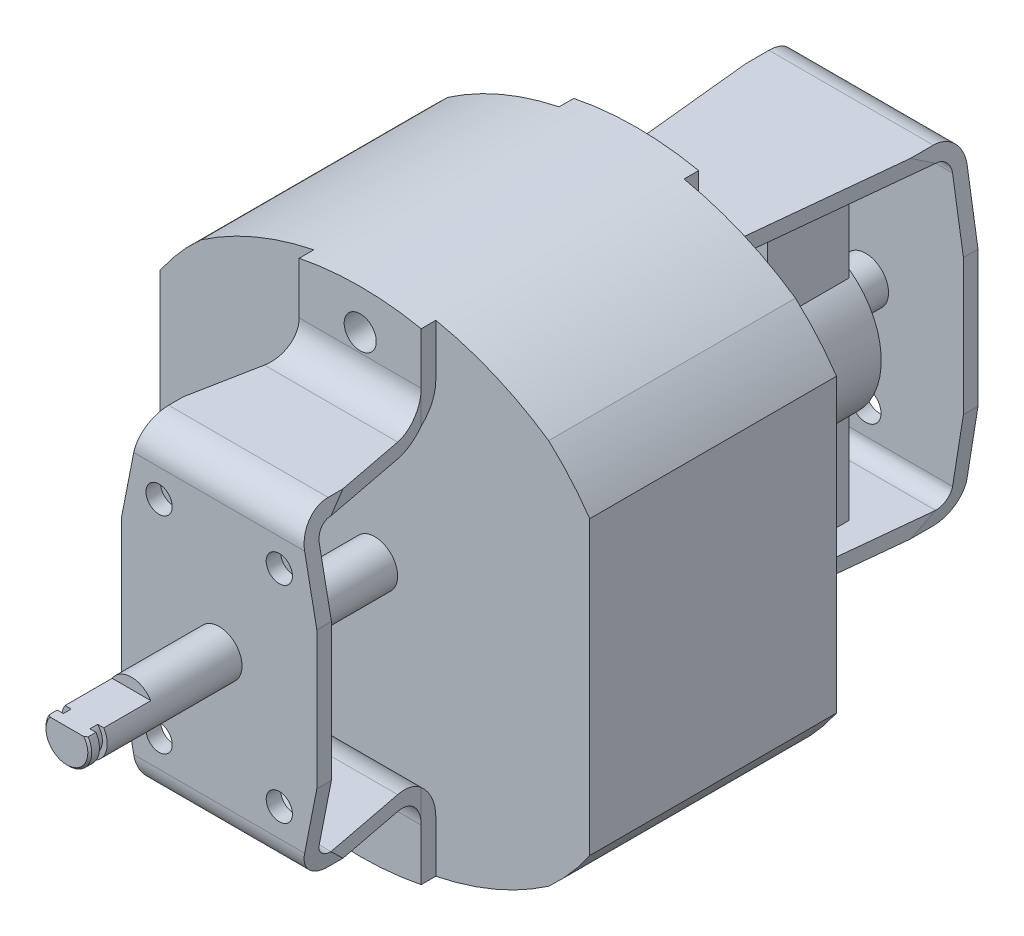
ISO-10303-21;
HEADER;
FILE_DESCRIPTION(('STEP AP214'),'2;1');
FILE_NAME('part.step','',(''),(''),'','','');
FILE_SCHEMA(('AUTOMOTIVE_DESIGN { 1 0 10303 214 1 1 1 1 }'));
ENDSEC;
DATA;
#1=APPLICATION_CONTEXT('core data for automotive mechanical design processes');
#2=APPLICATION_PROTOCOL_DEFINITION('international standard','automotive_design',2000,#1);
#3=PRODUCT_CONTEXT('',#1,'mechanical');
#4=PRODUCT('Part','Part','',(#3));
#5=PRODUCT_RELATED_PRODUCT_CATEGORY('part','',(#4));
#6=PRODUCT_DEFINITION_FORMATION('','',#4);
#7=PRODUCT_DEFINITION_CONTEXT('part definition',#1,'design');
#8=PRODUCT_DEFINITION('design','',#6,#7);
#9=PRODUCT_DEFINITION_SHAPE('','',#8);
#10=(LENGTH_UNIT() NAMED_UNIT(*) SI_UNIT(.MILLI.,.METRE.));
#11=(NAMED_UNIT(*) PLANE_ANGLE_UNIT() SI_UNIT($,.RADIAN.));
#12=(NAMED_UNIT(*) SI_UNIT($,.STERADIAN.) SOLID_ANGLE_UNIT());
#13=UNCERTAINTY_MEASURE_WITH_UNIT(LENGTH_MEASURE(1.E-05),#10,'distance_accuracy_value','');
#14=(GEOMETRIC_REPRESENTATION_CONTEXT(3) GLOBAL_UNCERTAINTY_ASSIGNED_CONTEXT((#13)) GLOBAL_UNIT_ASSIGNED_CONTEXT((#10,
#11,#12)) REPRESENTATION_CONTEXT('',''));
#15=CARTESIAN_POINT('',(0.,0.,0.));
#16=DIRECTION('',(0.,0.,1.));
#17=DIRECTION('',(1.,0.,0.));
#18=AXIS2_PLACEMENT_3D('',#15,#16,#17);
#19=CARTESIAN_POINT('',(0.,0.,25.38));
#20=DIRECTION('',(0.,0.,1.));
#21=DIRECTION('',(1.,0.,0.));
#22=AXIS2_PLACEMENT_3D('',#19,#20,#21);
#23=PLANE('',#22);
#24=CARTESIAN_POINT('',(0.,6.224455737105,25.38));
#25=DIRECTION('',(0.,0.,1.));
#26=DIRECTION('',(1.,0.,0.));
#27=AXIS2_PLACEMENT_3D('',#24,#25,#26);
#28=CIRCLE('',#27,31.6101347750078);
#29=CARTESIAN_POINT('',(17.8771350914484,-19.8448492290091,25.38));
#30=VERTEX_POINT('',#29);
#31=CARTESIAN_POINT('',(6.275,-24.7565867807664,25.38));
#32=VERTEX_POINT('',#31);
#33=EDGE_CURVE('E45',#30,#32,#28,.F.);
#34=ORIENTED_EDGE('',*,*,#33,.F.);
#35=CARTESIAN_POINT('',(0.,0.,25.38));
#36=DIRECTION('',(0.,0.,1.));
#37=DIRECTION('',(1.,0.,0.));
#38=AXIS2_PLACEMENT_3D('',#35,#36,#37);
#39=CIRCLE('',#38,26.7097360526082);
#40=CARTESIAN_POINT('',(22.1,-15.,25.38));
#41=VERTEX_POINT('',#40);
#42=EDGE_CURVE('E122',#30,#41,#39,.T.);
#43=ORIENTED_EDGE('',*,*,#42,.T.);
#44=DIRECTION('',(0.,1.,0.));
#45=VECTOR('',#44,1.);
#46=CARTESIAN_POINT('',(22.1,-15.,25.38));
#47=LINE('',#46,#45);
#48=CARTESIAN_POINT('',(22.1,15.,25.38));
#49=VERTEX_POINT('',#48);
#50=EDGE_CURVE('E118',#41,#49,#47,.T.);
#51=ORIENTED_EDGE('',*,*,#50,.T.);
#52=CARTESIAN_POINT('',(0.,0.,25.38));
#53=DIRECTION('',(0.,0.,1.));
#54=DIRECTION('',(1.,0.,0.));
#55=AXIS2_PLACEMENT_3D('',#52,#53,#54);
#56=CIRCLE('',#55,26.7097360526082);
#57=CARTESIAN_POINT('',(17.8771350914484,19.8448492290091,25.38));
#58=VERTEX_POINT('',#57);
#59=EDGE_CURVE('E121',#49,#58,#56,.T.);
#60=ORIENTED_EDGE('',*,*,#59,.T.);
#61=CARTESIAN_POINT('',(0.,-6.224455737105,25.38));
#62=DIRECTION('',(0.,0.,1.));
#63=DIRECTION('',(1.,0.,0.));
#64=AXIS2_PLACEMENT_3D('',#61,#62,#63);
#65=CIRCLE('',#64,31.6101347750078);
#66=CARTESIAN_POINT('',(6.275,24.7565867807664,25.38));
#67=VERTEX_POINT('',#66);
#68=EDGE_CURVE('E1246',#58,#67,#65,.T.);
#69=ORIENTED_EDGE('',*,*,#68,.T.);
#70=DIRECTION('',(0.,-1.,0.));
#71=VECTOR('',#70,1.);
#72=CARTESIAN_POINT('',(6.275,25.95,25.38));
#73=LINE('',#72,#71);
#74=CARTESIAN_POINT('',(6.27500000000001,19.45,25.38));
#75=VERTEX_POINT('',#74);
#76=EDGE_CURVE('E1130',#67,#75,#73,.T.);
#77=ORIENTED_EDGE('',*,*,#76,.T.);
#78=DIRECTION('',(-1.,0.,0.));
#79=VECTOR('',#78,1.);
#80=CARTESIAN_POINT('',(22.1,19.45,25.38));
#81=LINE('',#80,#79);
#82=CARTESIAN_POINT('',(-6.27499999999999,19.45,25.38));
#83=VERTEX_POINT('',#82);
#84=EDGE_CURVE('E1126',#75,#83,#81,.T.);
#85=ORIENTED_EDGE('',*,*,#84,.T.);
#86=DIRECTION('',(0.,-1.,0.));
#87=VECTOR('',#86,1.);
#88=CARTESIAN_POINT('',(-6.275,25.95,25.38));
#89=LINE('',#88,#87);
#90=CARTESIAN_POINT('',(-6.275,24.7565867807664,25.38));
#91=VERTEX_POINT('',#90);
#92=EDGE_CURVE('E1184',#91,#83,#89,.T.);
#93=ORIENTED_EDGE('',*,*,#92,.F.);
#94=CARTESIAN_POINT('',(-17.8771350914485,19.8448492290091,25.38));
#95=VERTEX_POINT('',#94);
#96=EDGE_CURVE('E1129',#91,#95,#65,.T.);
#97=ORIENTED_EDGE('',*,*,#96,.T.);
#98=CARTESIAN_POINT('',(0.,0.,25.38));
#99=DIRECTION('',(0.,0.,1.));
#100=DIRECTION('',(1.,0.,0.));
#101=AXIS2_PLACEMENT_3D('',#98,#99,#100);
#102=CIRCLE('',#101,26.7097360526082);
#103=CARTESIAN_POINT('',(-22.1,15.,25.38));
#104=VERTEX_POINT('',#103);
#105=EDGE_CURVE('E114',#95,#104,#102,.T.);
#106=ORIENTED_EDGE('',*,*,#105,.T.);
#107=DIRECTION('',(0.,-1.,0.));
#108=VECTOR('',#107,1.);
#109=CARTESIAN_POINT('',(-22.1,15.,25.38));
#110=LINE('',#109,#108);
#111=CARTESIAN_POINT('',(-22.1,-15.,25.38));
#112=VERTEX_POINT('',#111);
#113=EDGE_CURVE('E108',#104,#112,#110,.T.);
#114=ORIENTED_EDGE('',*,*,#113,.T.);
#115=CARTESIAN_POINT('',(0.,0.,25.38));
#116=DIRECTION('',(0.,0.,1.));
#117=DIRECTION('',(1.,0.,0.));
#118=AXIS2_PLACEMENT_3D('',#115,#116,#117);
#119=CIRCLE('',#118,26.7097360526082);
#120=CARTESIAN_POINT('',(-17.8771350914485,-19.8448492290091,25.38));
#121=VERTEX_POINT('',#120);
#122=EDGE_CURVE('E98',#112,#121,#119,.T.);
#123=ORIENTED_EDGE('',*,*,#122,.T.);
#124=CARTESIAN_POINT('',(-6.275,-24.7565867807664,25.38));
#125=VERTEX_POINT('',#124);
#126=EDGE_CURVE('E12',#125,#121,#28,.F.);
#127=ORIENTED_EDGE('',*,*,#126,.F.);
#128=DIRECTION('',(0.,1.,0.));
#129=VECTOR('',#128,1.);
#130=CARTESIAN_POINT('',(-6.275,-25.95,25.38));
#131=LINE('',#130,#129);
#132=CARTESIAN_POINT('',(-6.27499999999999,-19.45,25.38));
#133=VERTEX_POINT('',#132);
#134=EDGE_CURVE('E110',#125,#133,#131,.T.);
#135=ORIENTED_EDGE('',*,*,#134,.T.);
#136=DIRECTION('',(-1.,0.,0.));
#137=VECTOR('',#136,1.);
#138=CARTESIAN_POINT('',(22.1,-19.45,25.38));
#139=LINE('',#138,#137);
#140=CARTESIAN_POINT('',(6.27500000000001,-19.45,25.38));
#141=VERTEX_POINT('',#140);
#142=EDGE_CURVE('E1140',#141,#133,#139,.T.);
#143=ORIENTED_EDGE('',*,*,#142,.F.);
#144=DIRECTION('',(0.,1.,0.));
#145=VECTOR('',#144,1.);
#146=CARTESIAN_POINT('',(6.275,-25.95,25.38));
#147=LINE('',#146,#145);
#148=EDGE_CURVE('E632',#32,#141,#147,.T.);
#149=ORIENTED_EDGE('',*,*,#148,.F.);
#150=EDGE_LOOP('',(#34,#43,#51,#60,#69,#77,#85,#93,#97,#106,#114,#123,#127,#135,#143,#149));
#151=FACE_BOUND('',#150,.T.);
#152=CARTESIAN_POINT('',(0.,0.,25.38));
#153=DIRECTION('',(0.,0.,1.));
#154=DIRECTION('',(1.,0.,0.));
#155=AXIS2_PLACEMENT_3D('',#152,#153,#154);
#156=CIRCLE('',#155,2.35);
#157=CARTESIAN_POINT('',(2.35,0.,25.38));
#158=VERTEX_POINT('',#157);
#159=EDGE_CURVE('E112',#158,#158,#156,.F.);
#160=ORIENTED_EDGE('',*,*,#159,.T.);
#161=EDGE_LOOP('',(#160));
#162=FACE_BOUND('',#161,.T.);
#163=ADVANCED_FACE('F33',(#151,#162),#23,.T.);
#164=CARTESIAN_POINT('',(-6.275,-25.95,26.88));
#165=DIRECTION('',(0.,0.,-1.));
#166=DIRECTION('',(-1.,0.,0.));
#167=AXIS2_PLACEMENT_3D('',#164,#165,#166);
#168=PLANE('',#167);
#169=CARTESIAN_POINT('',(0.,-21.3,26.88));
#170=DIRECTION('',(0.,0.,-1.));
#171=DIRECTION('',(-1.,0.,0.));
#172=AXIS2_PLACEMENT_3D('',#169,#170,#171);
#173=CIRCLE('',#172,1.65);
#174=CARTESIAN_POINT('',(-1.65,-21.3,26.88));
#175=VERTEX_POINT('',#174);
#176=EDGE_CURVE('E385',#175,#175,#173,.F.);
#177=ORIENTED_EDGE('',*,*,#176,.F.);
#178=EDGE_LOOP('',(#177));
#179=FACE_BOUND('',#178,.T.);
#180=DIRECTION('',(0.,1.,0.));
#181=VECTOR('',#180,1.);
#182=CARTESIAN_POINT('',(-6.275,-25.95,26.88));
#183=LINE('',#182,#181);
#184=CARTESIAN_POINT('',(-6.275,-24.7565867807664,26.88));
#185=VERTEX_POINT('',#184);
#186=CARTESIAN_POINT('',(-6.275,-19.45,26.88));
#187=VERTEX_POINT('',#186);
#188=EDGE_CURVE('E1146',#185,#187,#183,.T.);
#189=ORIENTED_EDGE('',*,*,#188,.F.);
#190=CARTESIAN_POINT('',(0.,6.224455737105,26.88));
#191=DIRECTION('',(0.,0.,-1.));
#192=DIRECTION('',(-1.,0.,0.));
#193=AXIS2_PLACEMENT_3D('',#190,#191,#192);
#194=CIRCLE('',#193,31.6101347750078);
#195=CARTESIAN_POINT('',(6.275,-24.7565867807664,26.88));
#196=VERTEX_POINT('',#195);
#197=EDGE_CURVE('E635',#196,#185,#194,.T.);
#198=ORIENTED_EDGE('',*,*,#197,.F.);
#199=DIRECTION('',(0.,1.,0.));
#200=VECTOR('',#199,1.);
#201=CARTESIAN_POINT('',(6.275,-25.95,26.88));
#202=LINE('',#201,#200);
#203=CARTESIAN_POINT('',(6.275,-19.45,26.88));
#204=VERTEX_POINT('',#203);
#205=EDGE_CURVE('E192',#196,#204,#202,.T.);
#206=ORIENTED_EDGE('',*,*,#205,.T.);
#207=DIRECTION('',(-1.,0.,0.));
#208=VECTOR('',#207,1.);
#209=CARTESIAN_POINT('',(-6.275,-19.45,26.88));
#210=LINE('',#209,#208);
#211=EDGE_CURVE('E188',#204,#187,#210,.T.);
#212=ORIENTED_EDGE('',*,*,#211,.T.);
#213=EDGE_LOOP('',(#189,#198,#206,#212));
#214=FACE_BOUND('',#213,.T.);
#215=ADVANCED_FACE('F1457',(#179,#214),#168,.F.);
#216=CARTESIAN_POINT('',(6.425,-25.95,-1.5));
#217=DIRECTION('',(0.,0.,-1.));
#218=DIRECTION('',(-1.,0.,0.));
#219=AXIS2_PLACEMENT_3D('',#216,#217,#218);
#220=PLANE('',#219);
#221=CARTESIAN_POINT('',(0.,6.224455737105,-1.5));
#222=DIRECTION('',(0.,0.,-1.));
#223=DIRECTION('',(-1.,0.,0.));
#224=AXIS2_PLACEMENT_3D('',#221,#222,#223);
#225=CIRCLE('',#224,31.6101347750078);
#226=CARTESIAN_POINT('',(-6.42499999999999,-24.7258269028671,-1.5));
#227=VERTEX_POINT('',#226);
#228=CARTESIAN_POINT('',(6.425,-24.7258269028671,-1.5));
#229=VERTEX_POINT('',#228);
#230=EDGE_CURVE('E625',#227,#229,#225,.F.);
#231=ORIENTED_EDGE('',*,*,#230,.F.);
#232=DIRECTION('',(0.,1.,0.));
#233=VECTOR('',#232,1.);
#234=CARTESIAN_POINT('',(-6.42499999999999,-25.95,-1.5));
#235=LINE('',#234,#233);
#236=CARTESIAN_POINT('',(-6.42499999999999,-19.95,-1.5));
#237=VERTEX_POINT('',#236);
#238=EDGE_CURVE('E191',#227,#237,#235,.T.);
#239=ORIENTED_EDGE('',*,*,#238,.T.);
#240=DIRECTION('',(-1.,0.,0.));
#241=VECTOR('',#240,1.);
#242=CARTESIAN_POINT('',(6.425,-19.95,-1.5));
#243=LINE('',#242,#241);
#244=CARTESIAN_POINT('',(-0.948683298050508,-19.95,-1.5));
#245=VERTEX_POINT('',#244);
#246=EDGE_CURVE('E284',#237,#245,#243,.F.);
#247=ORIENTED_EDGE('',*,*,#246,.T.);
#248=CARTESIAN_POINT('',(0.,-21.3,-1.5));
#249=DIRECTION('',(0.,0.,-1.));
#250=DIRECTION('',(-1.,0.,0.));
#251=AXIS2_PLACEMENT_3D('',#248,#249,#250);
#252=CIRCLE('',#251,1.65);
#253=CARTESIAN_POINT('',(0.948683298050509,-19.95,-1.5));
#254=VERTEX_POINT('',#253);
#255=EDGE_CURVE('E287',#245,#254,#252,.F.);
#256=ORIENTED_EDGE('',*,*,#255,.T.);
#257=CARTESIAN_POINT('',(6.425,-19.95,-1.5));
#258=VERTEX_POINT('',#257);
#259=EDGE_CURVE('E288',#254,#258,#243,.F.);
#260=ORIENTED_EDGE('',*,*,#259,.T.);
#261=DIRECTION('',(0.,1.,0.));
#262=VECTOR('',#261,1.);
#263=CARTESIAN_POINT('',(6.425,-25.95,-1.5));
#264=LINE('',#263,#262);
#265=EDGE_CURVE('E647',#229,#258,#264,.T.);
#266=ORIENTED_EDGE('',*,*,#265,.F.);
#267=EDGE_LOOP('',(#231,#239,#247,#256,#260,#266));
#268=FACE_BOUND('',#267,.T.);
#269=ADVANCED_FACE('F35',(#268),#220,.T.);
#270=CARTESIAN_POINT('',(6.425,-25.95,-1.5));
#271=DIRECTION('',(1.,0.,0.));
#272=DIRECTION('',(0.,1.,0.));
#273=AXIS2_PLACEMENT_3D('',#270,#271,#272);
#274=PLANE('',#273);
#275=DIRECTION('',(0.,0.,1.));
#276=VECTOR('',#275,1.);
#277=CARTESIAN_POINT('',(6.425,-24.7258269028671,-28.7));
#278=LINE('',#277,#276);
#279=CARTESIAN_POINT('',(6.425,-24.7258269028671,0.));
#280=VERTEX_POINT('',#279);
#281=EDGE_CURVE('E627',#229,#280,#278,.T.);
#282=ORIENTED_EDGE('',*,*,#281,.F.);
#283=ORIENTED_EDGE('',*,*,#265,.T.);
#284=DIRECTION('',(0.,-1.,0.));
#285=VECTOR('',#284,1.);
#286=CARTESIAN_POINT('',(6.425,26.05,-1.5));
#287=LINE('',#286,#285);
#288=CARTESIAN_POINT('',(6.425,-16.5958980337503,-1.5));
#289=VERTEX_POINT('',#288);
#290=EDGE_CURVE('E300',#289,#258,#287,.T.);
#291=ORIENTED_EDGE('',*,*,#290,.F.);
#292=CARTESIAN_POINT('',(6.425,-19.95,-4.5));
#293=DIRECTION('',(1.,0.,0.));
#294=DIRECTION('',(0.,1.,0.));
#295=AXIS2_PLACEMENT_3D('',#292,#293,#294);
#296=CIRCLE('',#295,4.5);
#297=CARTESIAN_POINT('',(6.425,-19.95,0.));
#298=VERTEX_POINT('',#297);
#299=EDGE_CURVE('E633',#289,#298,#296,.T.);
#300=ORIENTED_EDGE('',*,*,#299,.T.);
#301=DIRECTION('',(0.,1.,0.));
#302=VECTOR('',#301,1.);
#303=CARTESIAN_POINT('',(6.425,-25.95,0.));
#304=LINE('',#303,#302);
#305=EDGE_CURVE('E623',#280,#298,#304,.T.);
#306=ORIENTED_EDGE('',*,*,#305,.F.);
#307=EDGE_LOOP('',(#282,#283,#291,#300,#306));
#308=FACE_BOUND('',#307,.T.);
#309=ADVANCED_FACE('F1465',(#308),#274,.T.);
#310=CARTESIAN_POINT('',(6.275,-25.95,26.88));
#311=DIRECTION('',(-1.,0.,0.));
#312=DIRECTION('',(0.,0.,1.));
#313=AXIS2_PLACEMENT_3D('',#310,#311,#312);
#314=PLANE('',#313);
#315=ORIENTED_EDGE('',*,*,#205,.F.);
#316=DIRECTION('',(0.,0.,1.));
#317=VECTOR('',#316,1.);
#318=CARTESIAN_POINT('',(6.275,-24.7565867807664,-28.7));
#319=LINE('',#318,#317);
#320=EDGE_CURVE('E630',#196,#32,#319,.F.);
#321=ORIENTED_EDGE('',*,*,#320,.T.);
#322=ORIENTED_EDGE('',*,*,#148,.T.);
#323=CARTESIAN_POINT('',(6.275,-19.45,29.88));
#324=DIRECTION('',(-1.,0.,0.));
#325=DIRECTION('',(0.,0.,1.));
#326=AXIS2_PLACEMENT_3D('',#323,#324,#325);
#327=CIRCLE('',#326,4.5);
#328=CARTESIAN_POINT('',(6.275,-16.0958980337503,26.88));
#329=VERTEX_POINT('',#328);
#330=EDGE_CURVE('E223',#329,#141,#327,.T.);
#331=ORIENTED_EDGE('',*,*,#330,.F.);
#332=DIRECTION('',(0.,-1.,0.));
#333=VECTOR('',#332,1.);
#334=CARTESIAN_POINT('',(6.275,26.05,26.88));
#335=LINE('',#334,#333);
#336=EDGE_CURVE('E646',#329,#204,#335,.T.);
#337=ORIENTED_EDGE('',*,*,#336,.T.);
#338=EDGE_LOOP('',(#315,#321,#322,#331,#337));
#339=FACE_BOUND('',#338,.T.);
#340=ADVANCED_FACE('F1647',(#339),#314,.F.);
#341=CARTESIAN_POINT('',(0.,0.,25.38));
#342=DIRECTION('',(0.,0.,-1.));
#343=DIRECTION('',(-1.,0.,0.));
#344=AXIS2_PLACEMENT_3D('',#341,#342,#343);
#345=CYLINDRICAL_SURFACE('',#344,26.7097360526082);
#346=ORIENTED_EDGE('',*,*,#42,.F.);
#347=DIRECTION('',(0.,0.,1.));
#348=VECTOR('',#347,1.);
#349=CARTESIAN_POINT('',(17.8771350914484,-19.8448492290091,-0.910000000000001));
#350=LINE('',#349,#348);
#351=CARTESIAN_POINT('',(17.8771350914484,-19.8448492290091,0.));
#352=VERTEX_POINT('',#351);
#353=EDGE_CURVE('E643',#30,#352,#350,.F.);
#354=ORIENTED_EDGE('',*,*,#353,.T.);
#355=CARTESIAN_POINT('',(0.,0.,0.));
#356=DIRECTION('',(0.,0.,1.));
#357=DIRECTION('',(1.,0.,0.));
#358=AXIS2_PLACEMENT_3D('',#355,#356,#357);
#359=CIRCLE('',#358,26.7097360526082);
#360=CARTESIAN_POINT('',(22.1,-15.,0.));
#361=VERTEX_POINT('',#360);
#362=EDGE_CURVE('E624',#352,#361,#359,.T.);
#363=ORIENTED_EDGE('',*,*,#362,.T.);
#364=DIRECTION('',(0.,0.,-1.));
#365=VECTOR('',#364,1.);
#366=CARTESIAN_POINT('',(22.1,-15.,25.38));
#367=LINE('',#366,#365);
#368=EDGE_CURVE('E128',#41,#361,#367,.T.);
#369=ORIENTED_EDGE('',*,*,#368,.F.);
#370=EDGE_LOOP('',(#346,#354,#363,#369));
#371=FACE_BOUND('',#370,.T.);
#372=ADVANCED_FACE('F1649',(#371),#345,.T.);
#373=CARTESIAN_POINT('',(0.,0.,0.));
#374=DIRECTION('',(0.,0.,1.));
#375=DIRECTION('',(1.,0.,0.));
#376=AXIS2_PLACEMENT_3D('',#373,#374,#375);
#377=PLANE('',#376);
#378=CARTESIAN_POINT('',(0.,0.,0.));
#379=DIRECTION('',(0.,0.,1.));
#380=DIRECTION('',(1.,0.,0.));
#381=AXIS2_PLACEMENT_3D('',#378,#379,#380);
#382=CIRCLE('',#381,2.35);
#383=CARTESIAN_POINT('',(2.35,0.,0.));
#384=VERTEX_POINT('',#383);
#385=EDGE_CURVE('E475',#384,#384,#382,.F.);
#386=ORIENTED_EDGE('',*,*,#385,.F.);
#387=EDGE_LOOP('',(#386));
#388=FACE_BOUND('',#387,.T.);
#389=ORIENTED_EDGE('',*,*,#362,.F.);
#390=CARTESIAN_POINT('',(0.,6.224455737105,0.));
#391=DIRECTION('',(0.,0.,1.));
#392=DIRECTION('',(1.,0.,0.));
#393=AXIS2_PLACEMENT_3D('',#390,#391,#392);
#394=CIRCLE('',#393,31.6101347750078);
#395=EDGE_CURVE('E620',#352,#280,#394,.F.);
#396=ORIENTED_EDGE('',*,*,#395,.T.);
#397=ORIENTED_EDGE('',*,*,#305,.T.);
#398=DIRECTION('',(-1.,0.,0.));
#399=VECTOR('',#398,1.);
#400=CARTESIAN_POINT('',(22.1,-19.95,0.));
#401=LINE('',#400,#399);
#402=CARTESIAN_POINT('',(0.948683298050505,-19.95,0.));
#403=VERTEX_POINT('',#402);
#404=EDGE_CURVE('E640',#298,#403,#401,.T.);
#405=ORIENTED_EDGE('',*,*,#404,.T.);
#406=CARTESIAN_POINT('',(0.,-21.3,0.));
#407=DIRECTION('',(0.,0.,1.));
#408=DIRECTION('',(1.,0.,0.));
#409=AXIS2_PLACEMENT_3D('',#406,#407,#408);
#410=CIRCLE('',#409,1.65);
#411=CARTESIAN_POINT('',(-0.948683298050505,-19.95,0.));
#412=VERTEX_POINT('',#411);
#413=EDGE_CURVE('E332',#412,#403,#410,.F.);
#414=ORIENTED_EDGE('',*,*,#413,.F.);
#415=CARTESIAN_POINT('',(-6.42499999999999,-19.95,0.));
#416=VERTEX_POINT('',#415);
#417=EDGE_CURVE('E1478',#412,#416,#401,.T.);
#418=ORIENTED_EDGE('',*,*,#417,.T.);
#419=DIRECTION('',(0.,1.,0.));
#420=VECTOR('',#419,1.);
#421=CARTESIAN_POINT('',(-6.42499999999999,-25.95,0.));
#422=LINE('',#421,#420);
#423=CARTESIAN_POINT('',(-6.42499999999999,-24.7258269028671,0.));
#424=VERTEX_POINT('',#423);
#425=EDGE_CURVE('E37',#424,#416,#422,.T.);
#426=ORIENTED_EDGE('',*,*,#425,.F.);
#427=CARTESIAN_POINT('',(-17.8771350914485,-19.8448492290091,0.));
#428=VERTEX_POINT('',#427);
#429=EDGE_CURVE('E52',#424,#428,#394,.F.);
#430=ORIENTED_EDGE('',*,*,#429,.T.);
#431=CARTESIAN_POINT('',(0.,0.,0.));
#432=DIRECTION('',(0.,0.,1.));
#433=DIRECTION('',(1.,0.,0.));
#434=AXIS2_PLACEMENT_3D('',#431,#432,#433);
#435=CIRCLE('',#434,26.7097360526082);
#436=CARTESIAN_POINT('',(-22.1,-15.,0.));
#437=VERTEX_POINT('',#436);
#438=EDGE_CURVE('E100',#437,#428,#435,.T.);
#439=ORIENTED_EDGE('',*,*,#438,.F.);
#440=DIRECTION('',(0.,-1.,0.));
#441=VECTOR('',#440,1.);
#442=CARTESIAN_POINT('',(-22.1,15.,0.));
#443=LINE('',#442,#441);
#444=CARTESIAN_POINT('',(-22.1,15.,0.));
#445=VERTEX_POINT('',#444);
#446=EDGE_CURVE('E137',#445,#437,#443,.T.);
#447=ORIENTED_EDGE('',*,*,#446,.F.);
#448=CARTESIAN_POINT('',(0.,0.,0.));
#449=DIRECTION('',(0.,0.,1.));
#450=DIRECTION('',(1.,0.,0.));
#451=AXIS2_PLACEMENT_3D('',#448,#449,#450);
#452=CIRCLE('',#451,26.7097360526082);
#453=CARTESIAN_POINT('',(-17.8771350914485,19.8448492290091,0.));
#454=VERTEX_POINT('',#453);
#455=EDGE_CURVE('E1135',#454,#445,#452,.T.);
#456=ORIENTED_EDGE('',*,*,#455,.F.);
#457=CARTESIAN_POINT('',(0.,-6.224455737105,0.));
#458=DIRECTION('',(0.,0.,1.));
#459=DIRECTION('',(1.,0.,0.));
#460=AXIS2_PLACEMENT_3D('',#457,#458,#459);
#461=CIRCLE('',#460,31.6101347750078);
#462=CARTESIAN_POINT('',(-6.425,24.7258269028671,0.));
#463=VERTEX_POINT('',#462);
#464=EDGE_CURVE('E1273',#463,#454,#461,.T.);
#465=ORIENTED_EDGE('',*,*,#464,.F.);
#466=DIRECTION('',(0.,-1.,0.));
#467=VECTOR('',#466,1.);
#468=CARTESIAN_POINT('',(-6.425,25.95,0.));
#469=LINE('',#468,#467);
#470=CARTESIAN_POINT('',(-6.425,19.95,0.));
#471=VERTEX_POINT('',#470);
#472=EDGE_CURVE('E1262',#463,#471,#469,.T.);
#473=ORIENTED_EDGE('',*,*,#472,.T.);
#474=DIRECTION('',(-1.,0.,0.));
#475=VECTOR('',#474,1.);
#476=CARTESIAN_POINT('',(22.1,19.95,0.));
#477=LINE('',#476,#475);
#478=CARTESIAN_POINT('',(-0.948683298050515,19.95,0.));
#479=VERTEX_POINT('',#478);
#480=EDGE_CURVE('E319',#479,#471,#477,.T.);
#481=ORIENTED_EDGE('',*,*,#480,.F.);
#482=CARTESIAN_POINT('',(0.,21.3,0.));
#483=DIRECTION('',(0.,0.,1.));
#484=DIRECTION('',(1.,0.,0.));
#485=AXIS2_PLACEMENT_3D('',#482,#483,#484);
#486=CIRCLE('',#485,1.65);
#487=CARTESIAN_POINT('',(0.948683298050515,19.95,0.));
#488=VERTEX_POINT('',#487);
#489=EDGE_CURVE('E360',#479,#488,#486,.T.);
#490=ORIENTED_EDGE('',*,*,#489,.T.);
#491=CARTESIAN_POINT('',(6.425,19.95,0.));
#492=VERTEX_POINT('',#491);
#493=EDGE_CURVE('E1306',#492,#488,#477,.T.);
#494=ORIENTED_EDGE('',*,*,#493,.F.);
#495=DIRECTION('',(0.,-1.,0.));
#496=VECTOR('',#495,1.);
#497=CARTESIAN_POINT('',(6.425,25.95,0.));
#498=LINE('',#497,#496);
#499=CARTESIAN_POINT('',(6.425,24.7258269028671,0.));
#500=VERTEX_POINT('',#499);
#501=EDGE_CURVE('E1276',#500,#492,#498,.T.);
#502=ORIENTED_EDGE('',*,*,#501,.F.);
#503=CARTESIAN_POINT('',(17.8771350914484,19.8448492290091,0.));
#504=VERTEX_POINT('',#503);
#505=EDGE_CURVE('E613',#504,#500,#461,.T.);
#506=ORIENTED_EDGE('',*,*,#505,.F.);
#507=CARTESIAN_POINT('',(0.,0.,0.));
#508=DIRECTION('',(0.,0.,1.));
#509=DIRECTION('',(1.,0.,0.));
#510=AXIS2_PLACEMENT_3D('',#507,#508,#509);
#511=CIRCLE('',#510,26.7097360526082);
#512=CARTESIAN_POINT('',(22.1,15.,0.));
#513=VERTEX_POINT('',#512);
#514=EDGE_CURVE('E126',#513,#504,#511,.T.);
#515=ORIENTED_EDGE('',*,*,#514,.F.);
#516=DIRECTION('',(0.,1.,0.));
#517=VECTOR('',#516,1.);
#518=CARTESIAN_POINT('',(22.1,-15.,0.));
#519=LINE('',#518,#517);
#520=EDGE_CURVE('E132',#361,#513,#519,.T.);
#521=ORIENTED_EDGE('',*,*,#520,.F.);
#522=EDGE_LOOP('',(#389,#396,#397,#405,#414,#418,#426,#430,#439,#447,#456,#465,#473,#481,#490,
#494,#502,#506,#515,#521));
#523=FACE_BOUND('',#522,.T.);
#524=ADVANCED_FACE('F1305',(#388,#523),#377,.F.);
#525=CARTESIAN_POINT('',(6.425,25.95,-1.5));
#526=DIRECTION('',(-1.,0.,0.));
#527=DIRECTION('',(0.,-1.,0.));
#528=AXIS2_PLACEMENT_3D('',#525,#526,#527);
#529=PLANE('',#528);
#530=DIRECTION('',(0.,0.,1.));
#531=VECTOR('',#530,1.);
#532=CARTESIAN_POINT('',(6.425,24.7258269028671,-28.7));
#533=LINE('',#532,#531);
#534=CARTESIAN_POINT('',(6.425,24.7258269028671,-1.5));
#535=VERTEX_POINT('',#534);
#536=EDGE_CURVE('E1277',#500,#535,#533,.F.);
#537=ORIENTED_EDGE('',*,*,#536,.F.);
#538=ORIENTED_EDGE('',*,*,#501,.T.);
#539=CARTESIAN_POINT('',(6.425,19.95,-4.5));
#540=DIRECTION('',(-1.,0.,0.));
#541=DIRECTION('',(0.,-1.,0.));
#542=AXIS2_PLACEMENT_3D('',#539,#540,#541);
#543=CIRCLE('',#542,4.5);
#544=CARTESIAN_POINT('',(6.425,16.5958980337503,-1.5));
#545=VERTEX_POINT('',#544);
#546=EDGE_CURVE('E318',#545,#492,#543,.T.);
#547=ORIENTED_EDGE('',*,*,#546,.F.);
#548=CARTESIAN_POINT('',(6.425,19.95,-1.5));
#549=VERTEX_POINT('',#548);
#550=EDGE_CURVE('E314',#549,#545,#287,.T.);
#551=ORIENTED_EDGE('',*,*,#550,.F.);
#552=DIRECTION('',(0.,-1.,0.));
#553=VECTOR('',#552,1.);
#554=CARTESIAN_POINT('',(6.425,25.95,-1.5));
#555=LINE('',#554,#553);
#556=EDGE_CURVE('E293',#535,#549,#555,.T.);
#557=ORIENTED_EDGE('',*,*,#556,.F.);
#558=EDGE_LOOP('',(#537,#538,#547,#551,#557));
#559=FACE_BOUND('',#558,.T.);
#560=ADVANCED_FACE('F1396',(#559),#529,.F.);
#561=CARTESIAN_POINT('',(-6.425,25.95,-1.5));
#562=DIRECTION('',(-1.,0.,0.));
#563=DIRECTION('',(0.,-1.,0.));
#564=AXIS2_PLACEMENT_3D('',#561,#562,#563);
#565=PLANE('',#564);
#566=ORIENTED_EDGE('',*,*,#472,.F.);
#567=DIRECTION('',(0.,0.,1.));
#568=VECTOR('',#567,1.);
#569=CARTESIAN_POINT('',(-6.425,24.7258269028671,-28.7));
#570=LINE('',#569,#568);
#571=CARTESIAN_POINT('',(-6.425,24.7258269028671,-1.5));
#572=VERTEX_POINT('',#571);
#573=EDGE_CURVE('E1266',#463,#572,#570,.F.);
#574=ORIENTED_EDGE('',*,*,#573,.T.);
#575=DIRECTION('',(0.,-1.,0.));
#576=VECTOR('',#575,1.);
#577=CARTESIAN_POINT('',(-6.425,25.95,-1.5));
#578=LINE('',#577,#576);
#579=CARTESIAN_POINT('',(-6.42499999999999,19.95,-1.5));
#580=VERTEX_POINT('',#579);
#581=EDGE_CURVE('E1264',#572,#580,#578,.T.);
#582=ORIENTED_EDGE('',*,*,#581,.T.);
#583=DIRECTION('',(0.,-1.,0.));
#584=VECTOR('',#583,1.);
#585=CARTESIAN_POINT('',(-6.42499999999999,26.05,-1.5));
#586=LINE('',#585,#584);
#587=CARTESIAN_POINT('',(-6.42499999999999,16.5958980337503,-1.5));
#588=VERTEX_POINT('',#587);
#589=EDGE_CURVE('E677',#580,#588,#586,.T.);
#590=ORIENTED_EDGE('',*,*,#589,.T.);
#591=CARTESIAN_POINT('',(-6.425,19.95,-4.5));
#592=DIRECTION('',(-1.,0.,0.));
#593=DIRECTION('',(0.,-1.,0.));
#594=AXIS2_PLACEMENT_3D('',#591,#592,#593);
#595=CIRCLE('',#594,4.5);
#596=EDGE_CURVE('E1187',#588,#471,#595,.T.);
#597=ORIENTED_EDGE('',*,*,#596,.T.);
#598=EDGE_LOOP('',(#566,#574,#582,#590,#597));
#599=FACE_BOUND('',#598,.T.);
#600=ADVANCED_FACE('F1321',(#599),#565,.T.);
#601=CARTESIAN_POINT('',(-6.275,25.95,26.88));
#602=DIRECTION('',(1.,0.,0.));
#603=DIRECTION('',(0.,0.,-1.));
#604=AXIS2_PLACEMENT_3D('',#601,#602,#603);
#605=PLANE('',#604);
#606=DIRECTION('',(0.,0.,1.));
#607=VECTOR('',#606,1.);
#608=CARTESIAN_POINT('',(-6.275,24.7565867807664,-28.7));
#609=LINE('',#608,#607);
#610=CARTESIAN_POINT('',(-6.275,24.7565867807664,26.88));
#611=VERTEX_POINT('',#610);
#612=EDGE_CURVE('E610',#91,#611,#609,.T.);
#613=ORIENTED_EDGE('',*,*,#612,.F.);
#614=ORIENTED_EDGE('',*,*,#92,.T.);
#615=CARTESIAN_POINT('',(-6.275,19.45,29.88));
#616=DIRECTION('',(1.,0.,0.));
#617=DIRECTION('',(0.,0.,-1.));
#618=AXIS2_PLACEMENT_3D('',#615,#616,#617);
#619=CIRCLE('',#618,4.5);
#620=CARTESIAN_POINT('',(-6.275,16.0958980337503,26.88));
#621=VERTEX_POINT('',#620);
#622=EDGE_CURVE('E229',#621,#83,#619,.T.);
#623=ORIENTED_EDGE('',*,*,#622,.F.);
#624=DIRECTION('',(0.,-1.,0.));
#625=VECTOR('',#624,1.);
#626=CARTESIAN_POINT('',(-6.275,26.05,26.88));
#627=LINE('',#626,#625);
#628=CARTESIAN_POINT('',(-6.275,19.45,26.88));
#629=VERTEX_POINT('',#628);
#630=EDGE_CURVE('E214',#629,#621,#627,.T.);
#631=ORIENTED_EDGE('',*,*,#630,.F.);
#632=DIRECTION('',(0.,-1.,0.));
#633=VECTOR('',#632,1.);
#634=CARTESIAN_POINT('',(-6.275,25.95,26.88));
#635=LINE('',#634,#633);
#636=EDGE_CURVE('E202',#611,#629,#635,.T.);
#637=ORIENTED_EDGE('',*,*,#636,.F.);
#638=EDGE_LOOP('',(#613,#614,#623,#631,#637));
#639=FACE_BOUND('',#638,.T.);
#640=ADVANCED_FACE('F1562',(#639),#605,.F.);
#641=CARTESIAN_POINT('',(6.275,25.95,26.88));
#642=DIRECTION('',(1.,0.,0.));
#643=DIRECTION('',(0.,0.,-1.));
#644=AXIS2_PLACEMENT_3D('',#641,#642,#643);
#645=PLANE('',#644);
#646=ORIENTED_EDGE('',*,*,#76,.F.);
#647=DIRECTION('',(0.,0.,1.));
#648=VECTOR('',#647,1.);
#649=CARTESIAN_POINT('',(6.275,24.7565867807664,-28.7));
#650=LINE('',#649,#648);
#651=CARTESIAN_POINT('',(6.275,24.7565867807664,26.88));
#652=VERTEX_POINT('',#651);
#653=EDGE_CURVE('E1186',#67,#652,#650,.T.);
#654=ORIENTED_EDGE('',*,*,#653,.T.);
#655=DIRECTION('',(0.,-1.,0.));
#656=VECTOR('',#655,1.);
#657=CARTESIAN_POINT('',(6.275,25.95,26.88));
#658=LINE('',#657,#656);
#659=CARTESIAN_POINT('',(6.275,19.45,26.88));
#660=VERTEX_POINT('',#659);
#661=EDGE_CURVE('E1282',#652,#660,#658,.T.);
#662=ORIENTED_EDGE('',*,*,#661,.T.);
#663=CARTESIAN_POINT('',(6.275,16.0958980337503,26.88));
#664=VERTEX_POINT('',#663);
#665=EDGE_CURVE('E1136',#660,#664,#335,.T.);
#666=ORIENTED_EDGE('',*,*,#665,.T.);
#667=CARTESIAN_POINT('',(6.275,19.45,29.88));
#668=DIRECTION('',(1.,0.,0.));
#669=DIRECTION('',(0.,0.,-1.));
#670=AXIS2_PLACEMENT_3D('',#667,#668,#669);
#671=CIRCLE('',#670,4.5);
#672=EDGE_CURVE('E1132',#664,#75,#671,.T.);
#673=ORIENTED_EDGE('',*,*,#672,.T.);
#674=EDGE_LOOP('',(#646,#654,#662,#666,#673));
#675=FACE_BOUND('',#674,.T.);
#676=ADVANCED_FACE('F1565',(#675),#645,.T.);
#677=CARTESIAN_POINT('',(0.,0.,25.38));
#678=DIRECTION('',(0.,0.,-1.));
#679=DIRECTION('',(-1.,0.,0.));
#680=AXIS2_PLACEMENT_3D('',#677,#678,#679);
#681=CYLINDRICAL_SURFACE('',#680,26.7097360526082);
#682=DIRECTION('',(0.,0.,1.));
#683=VECTOR('',#682,1.);
#684=CARTESIAN_POINT('',(-17.8771350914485,19.8448492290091,-28.7));
#685=LINE('',#684,#683);
#686=EDGE_CURVE('E628',#454,#95,#685,.T.);
#687=ORIENTED_EDGE('',*,*,#686,.F.);
#688=ORIENTED_EDGE('',*,*,#455,.T.);
#689=DIRECTION('',(0.,0.,-1.));
#690=VECTOR('',#689,1.);
#691=CARTESIAN_POINT('',(-22.1,15.,25.38));
#692=LINE('',#691,#690);
#693=EDGE_CURVE('E134',#104,#445,#692,.T.);
#694=ORIENTED_EDGE('',*,*,#693,.F.);
#695=ORIENTED_EDGE('',*,*,#105,.F.);
#696=EDGE_LOOP('',(#687,#688,#694,#695));
#697=FACE_BOUND('',#696,.T.);
#698=ADVANCED_FACE('F1420',(#697),#681,.T.);
#699=CARTESIAN_POINT('',(0.,0.,25.38));
#700=DIRECTION('',(0.,0.,-1.));
#701=DIRECTION('',(-1.,0.,0.));
#702=AXIS2_PLACEMENT_3D('',#699,#700,#701);
#703=CYLINDRICAL_SURFACE('',#702,26.7097360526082);
#704=DIRECTION('',(0.,0.,1.));
#705=VECTOR('',#704,1.);
#706=CARTESIAN_POINT('',(17.8771350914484,19.8448492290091,-28.7));
#707=LINE('',#706,#705);
#708=EDGE_CURVE('E127',#504,#58,#707,.T.);
#709=ORIENTED_EDGE('',*,*,#708,.T.);
#710=ORIENTED_EDGE('',*,*,#59,.F.);
#711=DIRECTION('',(0.,0.,-1.));
#712=VECTOR('',#711,1.);
#713=CARTESIAN_POINT('',(22.1,15.,25.38));
#714=LINE('',#713,#712);
#715=EDGE_CURVE('E123',#49,#513,#714,.T.);
#716=ORIENTED_EDGE('',*,*,#715,.T.);
#717=ORIENTED_EDGE('',*,*,#514,.T.);
#718=EDGE_LOOP('',(#709,#710,#716,#717));
#719=FACE_BOUND('',#718,.T.);
#720=ADVANCED_FACE('F1644',(#719),#703,.T.);
#721=CARTESIAN_POINT('',(-6.275,25.95,26.88));
#722=DIRECTION('',(0.,0.,1.));
#723=DIRECTION('',(1.,0.,0.));
#724=AXIS2_PLACEMENT_3D('',#721,#722,#723);
#725=PLANE('',#724);
#726=CARTESIAN_POINT('',(0.,21.3,26.88));
#727=DIRECTION('',(0.,0.,1.));
#728=DIRECTION('',(1.,0.,0.));
#729=AXIS2_PLACEMENT_3D('',#726,#727,#728);
#730=CIRCLE('',#729,1.65);
#731=CARTESIAN_POINT('',(1.65,21.3,26.88));
#732=VERTEX_POINT('',#731);
#733=EDGE_CURVE('E1311',#732,#732,#730,.T.);
#734=ORIENTED_EDGE('',*,*,#733,.F.);
#735=EDGE_LOOP('',(#734));
#736=FACE_BOUND('',#735,.T.);
#737=ORIENTED_EDGE('',*,*,#661,.F.);
#738=CARTESIAN_POINT('',(0.,-6.224455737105,26.88));
#739=DIRECTION('',(0.,0.,1.));
#740=DIRECTION('',(1.,0.,0.));
#741=AXIS2_PLACEMENT_3D('',#738,#739,#740);
#742=CIRCLE('',#741,31.6101347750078);
#743=EDGE_CURVE('E1188',#652,#611,#742,.T.);
#744=ORIENTED_EDGE('',*,*,#743,.T.);
#745=ORIENTED_EDGE('',*,*,#636,.T.);
#746=DIRECTION('',(-1.,0.,0.));
#747=VECTOR('',#746,1.);
#748=CARTESIAN_POINT('',(6.275,19.45,26.88));
#749=LINE('',#748,#747);
#750=EDGE_CURVE('E198',#629,#660,#749,.F.);
#751=ORIENTED_EDGE('',*,*,#750,.T.);
#752=EDGE_LOOP('',(#737,#744,#745,#751));
#753=FACE_BOUND('',#752,.T.);
#754=ADVANCED_FACE('F1667',(#736,#753),#725,.T.);
#755=CARTESIAN_POINT('',(6.425,25.95,-1.5));
#756=DIRECTION('',(0.,0.,-1.));
#757=DIRECTION('',(-1.,0.,0.));
#758=AXIS2_PLACEMENT_3D('',#755,#756,#757);
#759=PLANE('',#758);
#760=ORIENTED_EDGE('',*,*,#581,.F.);
#761=CARTESIAN_POINT('',(0.,-6.224455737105,-1.5));
#762=DIRECTION('',(0.,0.,-1.));
#763=DIRECTION('',(-1.,0.,0.));
#764=AXIS2_PLACEMENT_3D('',#761,#762,#763);
#765=CIRCLE('',#764,31.6101347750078);
#766=EDGE_CURVE('E201',#572,#535,#765,.T.);
#767=ORIENTED_EDGE('',*,*,#766,.T.);
#768=ORIENTED_EDGE('',*,*,#556,.T.);
#769=DIRECTION('',(-1.,0.,0.));
#770=VECTOR('',#769,1.);
#771=CARTESIAN_POINT('',(-6.42499999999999,19.95,-1.5));
#772=LINE('',#771,#770);
#773=CARTESIAN_POINT('',(0.948683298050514,19.95,-1.5));
#774=VERTEX_POINT('',#773);
#775=EDGE_CURVE('E289',#549,#774,#772,.T.);
#776=ORIENTED_EDGE('',*,*,#775,.T.);
#777=CARTESIAN_POINT('',(0.,21.3,-1.5));
#778=DIRECTION('',(0.,0.,-1.));
#779=DIRECTION('',(-1.,0.,0.));
#780=AXIS2_PLACEMENT_3D('',#777,#778,#779);
#781=CIRCLE('',#780,1.65);
#782=CARTESIAN_POINT('',(-0.948683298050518,19.95,-1.5));
#783=VERTEX_POINT('',#782);
#784=EDGE_CURVE('E333',#783,#774,#781,.T.);
#785=ORIENTED_EDGE('',*,*,#784,.F.);
#786=EDGE_CURVE('E292',#783,#580,#772,.T.);
#787=ORIENTED_EDGE('',*,*,#786,.T.);
#788=EDGE_LOOP('',(#760,#767,#768,#776,#785,#787));
#789=FACE_BOUND('',#788,.T.);
#790=ADVANCED_FACE('F1391',(#789),#759,.T.);
#791=CARTESIAN_POINT('',(-22.1,-15.45,-23.6));
#792=DIRECTION('',(0.,1.,0.));
#793=DIRECTION('',(0.,0.,1.));
#794=AXIS2_PLACEMENT_3D('',#791,#792,#793);
#795=PLANE('',#794);
#796=DIRECTION('',(-1.,0.,0.));
#797=VECTOR('',#796,1.);
#798=CARTESIAN_POINT('',(22.1,-15.45,-4.49999999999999));
#799=LINE('',#798,#797);
#800=CARTESIAN_POINT('',(6.73262977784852,-15.45,-4.49999999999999));
#801=VERTEX_POINT('',#800);
#802=CARTESIAN_POINT('',(-6.7326297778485,-15.45,-4.49999999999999));
#803=VERTEX_POINT('',#802);
#804=EDGE_CURVE('E323',#801,#803,#799,.T.);
#805=ORIENTED_EDGE('',*,*,#804,.F.);
#806=DIRECTION('',(-0.102008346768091,0.,0.994783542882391));
#807=VECTOR('',#806,1.);
#808=CARTESIAN_POINT('',(8.37080189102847,-15.45,-20.4754246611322));
#809=LINE('',#808,#807);
#810=CARTESIAN_POINT('',(8.69120603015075,-15.45,-23.6));
#811=VERTEX_POINT('',#810);
#812=EDGE_CURVE('E1335',#811,#801,#809,.T.);
#813=ORIENTED_EDGE('',*,*,#812,.F.);
#814=DIRECTION('',(1.,0.,0.));
#815=VECTOR('',#814,1.);
#816=CARTESIAN_POINT('',(-22.1,-15.45,-23.6));
#817=LINE('',#816,#815);
#818=CARTESIAN_POINT('',(-8.69120603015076,-15.45,-23.6));
#819=VERTEX_POINT('',#818);
#820=EDGE_CURVE('E278',#819,#811,#817,.T.);
#821=ORIENTED_EDGE('',*,*,#820,.F.);
#822=DIRECTION('',(0.102008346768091,0.,0.994783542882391));
#823=VECTOR('',#822,1.);
#824=CARTESIAN_POINT('',(-8.83073395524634,-15.45,-24.9606737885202));
#825=LINE('',#824,#823);
#826=EDGE_CURVE('E535',#819,#803,#825,.T.);
#827=ORIENTED_EDGE('',*,*,#826,.T.);
#828=EDGE_LOOP('',(#805,#813,#821,#827));
#829=FACE_BOUND('',#828,.T.);
#830=DIRECTION('',(1.,0.,0.));
#831=VECTOR('',#830,1.);
#832=CARTESIAN_POINT('',(-22.1,-15.45,-18.2466400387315));
#833=LINE('',#832,#831);
#834=CARTESIAN_POINT('',(-5.13723069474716,-15.45,-18.2466400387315));
#835=VERTEX_POINT('',#834);
#836=CARTESIAN_POINT('',(5.13723069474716,-15.45,-18.2466400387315));
#837=VERTEX_POINT('',#836);
#838=EDGE_CURVE('E533',#835,#837,#833,.T.);
#839=ORIENTED_EDGE('',*,*,#838,.T.);
#840=DIRECTION('',(0.,0.,1.));
#841=VECTOR('',#840,1.);
#842=CARTESIAN_POINT('',(5.13723069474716,-15.45,-23.6));
#843=LINE('',#842,#841);
#844=CARTESIAN_POINT('',(5.13723069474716,-15.45,-9.85932461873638));
#845=VERTEX_POINT('',#844);
#846=EDGE_CURVE('E402',#837,#845,#843,.T.);
#847=ORIENTED_EDGE('',*,*,#846,.T.);
#848=DIRECTION('',(-1.,0.,0.));
#849=VECTOR('',#848,1.);
#850=CARTESIAN_POINT('',(-22.1,-15.45,-9.85932461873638));
#851=LINE('',#850,#849);
#852=CARTESIAN_POINT('',(-5.13723069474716,-15.45,-9.85932461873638));
#853=VERTEX_POINT('',#852);
#854=EDGE_CURVE('E521',#845,#853,#851,.T.);
#855=ORIENTED_EDGE('',*,*,#854,.T.);
#856=DIRECTION('',(0.,0.,1.));
#857=VECTOR('',#856,1.);
#858=CARTESIAN_POINT('',(-5.13723069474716,-15.45,-23.6));
#859=LINE('',#858,#857);
#860=EDGE_CURVE('E523',#835,#853,#859,.T.);
#861=ORIENTED_EDGE('',*,*,#860,.F.);
#862=EDGE_LOOP('',(#839,#847,#855,#861));
#863=FACE_BOUND('',#862,.T.);
#864=ADVANCED_FACE('F1441',(#829,#863),#795,.T.);
#865=CARTESIAN_POINT('',(-22.1,15.45,-23.6));
#866=DIRECTION('',(0.,1.,0.));
#867=DIRECTION('',(0.,0.,1.));
#868=AXIS2_PLACEMENT_3D('',#865,#866,#867);
#869=PLANE('',#868);
#870=DIRECTION('',(-0.102008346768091,0.,0.994783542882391));
#871=VECTOR('',#870,1.);
#872=CARTESIAN_POINT('',(8.37080189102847,15.45,-20.4754246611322));
#873=LINE('',#872,#871);
#874=CARTESIAN_POINT('',(8.69120603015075,15.45,-23.6));
#875=VERTEX_POINT('',#874);
#876=CARTESIAN_POINT('',(6.73262977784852,15.45,-4.49999999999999));
#877=VERTEX_POINT('',#876);
#878=EDGE_CURVE('E1329',#875,#877,#873,.T.);
#879=ORIENTED_EDGE('',*,*,#878,.T.);
#880=DIRECTION('',(-1.,0.,0.));
#881=VECTOR('',#880,1.);
#882=CARTESIAN_POINT('',(22.1,15.45,-4.49999999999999));
#883=LINE('',#882,#881);
#884=CARTESIAN_POINT('',(-6.7326297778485,15.45,-4.49999999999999));
#885=VERTEX_POINT('',#884);
#886=EDGE_CURVE('E517',#877,#885,#883,.T.);
#887=ORIENTED_EDGE('',*,*,#886,.T.);
#888=DIRECTION('',(0.102008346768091,0.,0.994783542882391));
#889=VECTOR('',#888,1.);
#890=CARTESIAN_POINT('',(-8.83073395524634,15.45,-24.9606737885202));
#891=LINE('',#890,#889);
#892=CARTESIAN_POINT('',(-8.69120603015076,15.45,-23.6));
#893=VERTEX_POINT('',#892);
#894=EDGE_CURVE('E1337',#893,#885,#891,.T.);
#895=ORIENTED_EDGE('',*,*,#894,.F.);
#896=DIRECTION('',(1.,0.,0.));
#897=VECTOR('',#896,1.);
#898=CARTESIAN_POINT('',(-22.1,15.45,-23.6));
#899=LINE('',#898,#897);
#900=EDGE_CURVE('E508',#893,#875,#899,.T.);
#901=ORIENTED_EDGE('',*,*,#900,.T.);
#902=EDGE_LOOP('',(#879,#887,#895,#901));
#903=FACE_BOUND('',#902,.T.);
#904=DIRECTION('',(0.,0.,1.));
#905=VECTOR('',#904,1.);
#906=CARTESIAN_POINT('',(5.13723069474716,15.45,-23.6));
#907=LINE('',#906,#905);
#908=CARTESIAN_POINT('',(5.13723069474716,15.45,-18.2466400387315));
#909=VERTEX_POINT('',#908);
#910=CARTESIAN_POINT('',(5.13723069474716,15.45,-9.85932461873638));
#911=VERTEX_POINT('',#910);
#912=EDGE_CURVE('E536',#909,#911,#907,.T.);
#913=ORIENTED_EDGE('',*,*,#912,.F.);
#914=DIRECTION('',(1.,0.,0.));
#915=VECTOR('',#914,1.);
#916=CARTESIAN_POINT('',(-22.1,15.45,-18.2466400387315));
#917=LINE('',#916,#915);
#918=CARTESIAN_POINT('',(-5.13723069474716,15.45,-18.2466400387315));
#919=VERTEX_POINT('',#918);
#920=EDGE_CURVE('E528',#919,#909,#917,.T.);
#921=ORIENTED_EDGE('',*,*,#920,.F.);
#922=DIRECTION('',(0.,0.,1.));
#923=VECTOR('',#922,1.);
#924=CARTESIAN_POINT('',(-5.13723069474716,15.45,-23.6));
#925=LINE('',#924,#923);
#926=CARTESIAN_POINT('',(-5.13723069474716,15.45,-9.85932461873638));
#927=VERTEX_POINT('',#926);
#928=EDGE_CURVE('E501',#919,#927,#925,.T.);
#929=ORIENTED_EDGE('',*,*,#928,.T.);
#930=DIRECTION('',(-1.,0.,0.));
#931=VECTOR('',#930,1.);
#932=CARTESIAN_POINT('',(-22.1,15.45,-9.85932461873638));
#933=LINE('',#932,#931);
#934=EDGE_CURVE('E566',#911,#927,#933,.T.);
#935=ORIENTED_EDGE('',*,*,#934,.F.);
#936=EDGE_LOOP('',(#913,#921,#929,#935));
#937=FACE_BOUND('',#936,.T.);
#938=ADVANCED_FACE('F1399',(#903,#937),#869,.F.);
#939=CARTESIAN_POINT('',(0.,0.,-6.7));
#940=DIRECTION('',(0.,0.,-1.));
#941=DIRECTION('',(-1.,0.,0.));
#942=AXIS2_PLACEMENT_3D('',#939,#940,#941);
#943=CYLINDRICAL_SURFACE('',#942,8.);
#944=CARTESIAN_POINT('',(0.,0.,-18.2466400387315));
#945=DIRECTION('',(0.,0.,1.));
#946=DIRECTION('',(1.,0.,0.));
#947=AXIS2_PLACEMENT_3D('',#944,#945,#946);
#948=CIRCLE('',#947,8.);
#949=CARTESIAN_POINT('',(-5.13723069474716,6.13260636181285,-18.2466400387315));
#950=VERTEX_POINT('',#949);
#951=CARTESIAN_POINT('',(5.13723069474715,6.13260636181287,-18.2466400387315));
#952=VERTEX_POINT('',#951);
#953=EDGE_CURVE('E490',#950,#952,#948,.F.);
#954=ORIENTED_EDGE('',*,*,#953,.T.);
#955=DIRECTION('',(0.,0.,-1.));
#956=VECTOR('',#955,1.);
#957=CARTESIAN_POINT('',(5.13723069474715,6.13260636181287,-6.7));
#958=LINE('',#957,#956);
#959=CARTESIAN_POINT('',(5.13723069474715,6.13260636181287,-9.85932461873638));
#960=VERTEX_POINT('',#959);
#961=EDGE_CURVE('E500',#952,#960,#958,.F.);
#962=ORIENTED_EDGE('',*,*,#961,.T.);
#963=CARTESIAN_POINT('',(0.,0.,-9.85932461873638));
#964=DIRECTION('',(0.,0.,-1.));
#965=DIRECTION('',(-1.,0.,0.));
#966=AXIS2_PLACEMENT_3D('',#963,#964,#965);
#967=CIRCLE('',#966,8.);
#968=CARTESIAN_POINT('',(-5.13723069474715,6.13260636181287,-9.85932461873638));
#969=VERTEX_POINT('',#968);
#970=EDGE_CURVE('E413',#960,#969,#967,.F.);
#971=ORIENTED_EDGE('',*,*,#970,.T.);
#972=DIRECTION('',(0.,0.,-1.));
#973=VECTOR('',#972,1.);
#974=CARTESIAN_POINT('',(-5.13723069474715,6.13260636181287,-6.7));
#975=LINE('',#974,#973);
#976=EDGE_CURVE('E569',#950,#969,#975,.F.);
#977=ORIENTED_EDGE('',*,*,#976,.F.);
#978=EDGE_LOOP('',(#954,#962,#971,#977));
#979=FACE_BOUND('',#978,.T.);
#980=CARTESIAN_POINT('',(0.,0.,-6.7));
#981=DIRECTION('',(0.,0.,-1.));
#982=DIRECTION('',(-1.,0.,0.));
#983=AXIS2_PLACEMENT_3D('',#980,#981,#982);
#984=CIRCLE('',#983,8.);
#985=CARTESIAN_POINT('',(-8.,0.,-6.7));
#986=VERTEX_POINT('',#985);
#987=EDGE_CURVE('E409',#986,#986,#984,.T.);
#988=ORIENTED_EDGE('',*,*,#987,.T.);
#989=EDGE_LOOP('',(#988));
#990=FACE_BOUND('',#989,.T.);
#991=CARTESIAN_POINT('',(0.,0.,-18.7));
#992=DIRECTION('',(0.,0.,-1.));
#993=DIRECTION('',(-1.,0.,0.));
#994=AXIS2_PLACEMENT_3D('',#991,#992,#993);
#995=CIRCLE('',#994,8.);
#996=CARTESIAN_POINT('',(-8.,0.,-18.7));
#997=VERTEX_POINT('',#996);
#998=EDGE_CURVE('E404',#997,#997,#995,.T.);
#999=ORIENTED_EDGE('',*,*,#998,.F.);
#1000=EDGE_LOOP('',(#999));
#1001=FACE_BOUND('',#1000,.T.);
#1002=CARTESIAN_POINT('',(-5.13723069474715,-6.13260636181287,-9.85932461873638));
#1003=VERTEX_POINT('',#1002);
#1004=CARTESIAN_POINT('',(5.13723069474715,-6.13260636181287,-9.85932461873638));
#1005=VERTEX_POINT('',#1004);
#1006=EDGE_CURVE('E412',#1003,#1005,#967,.F.);
#1007=ORIENTED_EDGE('',*,*,#1006,.T.);
#1008=DIRECTION('',(0.,0.,-1.));
#1009=VECTOR('',#1008,1.);
#1010=CARTESIAN_POINT('',(5.13723069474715,-6.13260636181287,-6.7));
#1011=LINE('',#1010,#1009);
#1012=CARTESIAN_POINT('',(5.13723069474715,-6.13260636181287,-18.2466400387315));
#1013=VERTEX_POINT('',#1012);
#1014=EDGE_CURVE('E488',#1005,#1013,#1011,.T.);
#1015=ORIENTED_EDGE('',*,*,#1014,.T.);
#1016=CARTESIAN_POINT('',(-5.13723069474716,-6.13260636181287,-18.2466400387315));
#1017=VERTEX_POINT('',#1016);
#1018=EDGE_CURVE('E484',#1013,#1017,#948,.F.);
#1019=ORIENTED_EDGE('',*,*,#1018,.T.);
#1020=DIRECTION('',(0.,0.,-1.));
#1021=VECTOR('',#1020,1.);
#1022=CARTESIAN_POINT('',(-5.13723069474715,-6.13260636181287,-6.7));
#1023=LINE('',#1022,#1021);
#1024=EDGE_CURVE('E597',#1003,#1017,#1023,.T.);
#1025=ORIENTED_EDGE('',*,*,#1024,.F.);
#1026=EDGE_LOOP('',(#1007,#1015,#1019,#1025));
#1027=FACE_BOUND('',#1026,.T.);
#1028=ADVANCED_FACE('F588',(#979,#990,#1001,#1027),#943,.T.);
#1029=CARTESIAN_POINT('',(0.,0.,57.04));
#1030=DIRECTION('',(0.,0.,-1.));
#1031=DIRECTION('',(-1.,0.,0.));
#1032=AXIS2_PLACEMENT_3D('',#1029,#1030,#1031);
#1033=CYLINDRICAL_SURFACE('',#1032,2.35);
#1034=ORIENTED_EDGE('',*,*,#385,.T.);
#1035=EDGE_LOOP('',(#1034));
#1036=FACE_BOUND('',#1035,.T.);
#1037=CARTESIAN_POINT('',(0.,0.,-6.69999999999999));
#1038=DIRECTION('',(0.,0.,-1.));
#1039=DIRECTION('',(-1.,0.,0.));
#1040=AXIS2_PLACEMENT_3D('',#1037,#1038,#1039);
#1041=CIRCLE('',#1040,2.35);
#1042=CARTESIAN_POINT('',(-2.35,0.,-6.69999999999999));
#1043=VERTEX_POINT('',#1042);
#1044=EDGE_CURVE('E408',#1043,#1043,#1041,.T.);
#1045=ORIENTED_EDGE('',*,*,#1044,.F.);
#1046=EDGE_LOOP('',(#1045));
#1047=FACE_BOUND('',#1046,.T.);
#1048=ADVANCED_FACE('F1843',(#1036,#1047),#1033,.T.);
#1049=CARTESIAN_POINT('',(13.901256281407,-16.95,-26.6));
#1050=DIRECTION('',(0.,0.,-1.));
#1051=DIRECTION('',(-1.,0.,0.));
#1052=AXIS2_PLACEMENT_3D('',#1049,#1050,#1051);
#1053=PLANE('',#1052);
#1054=CARTESIAN_POINT('',(0.,0.,-26.6));
#1055=DIRECTION('',(0.,0.,-1.));
#1056=DIRECTION('',(-1.,0.,0.));
#1057=AXIS2_PLACEMENT_3D('',#1054,#1055,#1056);
#1058=CIRCLE('',#1057,2.35);
#1059=CARTESIAN_POINT('',(-2.35,0.,-26.6));
#1060=VERTEX_POINT('',#1059);
#1061=EDGE_CURVE('E249',#1060,#1060,#1058,.F.);
#1062=ORIENTED_EDGE('',*,*,#1061,.T.);
#1063=EDGE_LOOP('',(#1062));
#1064=FACE_BOUND('',#1063,.T.);
#1065=DIRECTION('',(-0.158764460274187,-0.987316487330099,0.));
#1066=VECTOR('',#1065,1.);
#1067=CARTESIAN_POINT('',(-8.45,16.95,-26.6));
#1068=LINE('',#1067,#1066);
#1069=CARTESIAN_POINT('',(-8.93241206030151,13.95,-26.6));
#1070=VERTEX_POINT('',#1069);
#1071=CARTESIAN_POINT('',(-10.05,7.,-26.6));
#1072=VERTEX_POINT('',#1071);
#1073=EDGE_CURVE('E238',#1070,#1072,#1068,.T.);
#1074=ORIENTED_EDGE('',*,*,#1073,.F.);
#1075=DIRECTION('',(-1.,0.,0.));
#1076=VECTOR('',#1075,1.);
#1077=CARTESIAN_POINT('',(13.901256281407,13.95,-26.6));
#1078=LINE('',#1077,#1076);
#1079=CARTESIAN_POINT('',(8.93241206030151,13.95,-26.6));
#1080=VERTEX_POINT('',#1079);
#1081=EDGE_CURVE('E245',#1070,#1080,#1078,.F.);
#1082=ORIENTED_EDGE('',*,*,#1081,.T.);
#1083=DIRECTION('',(0.158764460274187,-0.987316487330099,0.));
#1084=VECTOR('',#1083,1.);
#1085=CARTESIAN_POINT('',(8.45,16.95,-26.6));
#1086=LINE('',#1085,#1084);
#1087=CARTESIAN_POINT('',(10.05,7.,-26.6));
#1088=VERTEX_POINT('',#1087);
#1089=EDGE_CURVE('E248',#1080,#1088,#1086,.T.);
#1090=ORIENTED_EDGE('',*,*,#1089,.T.);
#1091=DIRECTION('',(0.,-1.,0.));
#1092=VECTOR('',#1091,1.);
#1093=CARTESIAN_POINT('',(10.05,7.,-26.6));
#1094=LINE('',#1093,#1092);
#1095=CARTESIAN_POINT('',(10.05,-7.,-26.6));
#1096=VERTEX_POINT('',#1095);
#1097=EDGE_CURVE('E244',#1088,#1096,#1094,.T.);
#1098=ORIENTED_EDGE('',*,*,#1097,.T.);
#1099=DIRECTION('',(0.158764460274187,0.987316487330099,0.));
#1100=VECTOR('',#1099,1.);
#1101=CARTESIAN_POINT('',(8.45,-16.95,-26.6));
#1102=LINE('',#1101,#1100);
#1103=CARTESIAN_POINT('',(8.93241206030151,-13.95,-26.6));
#1104=VERTEX_POINT('',#1103);
#1105=EDGE_CURVE('E268',#1104,#1096,#1102,.T.);
#1106=ORIENTED_EDGE('',*,*,#1105,.F.);
#1107=DIRECTION('',(-1.,0.,0.));
#1108=VECTOR('',#1107,1.);
#1109=CARTESIAN_POINT('',(-8.45,-13.95,-26.6));
#1110=LINE('',#1109,#1108);
#1111=CARTESIAN_POINT('',(-8.93241206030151,-13.95,-26.6));
#1112=VERTEX_POINT('',#1111);
#1113=EDGE_CURVE('E240',#1104,#1112,#1110,.T.);
#1114=ORIENTED_EDGE('',*,*,#1113,.T.);
#1115=DIRECTION('',(-0.158764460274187,0.987316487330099,0.));
#1116=VECTOR('',#1115,1.);
#1117=CARTESIAN_POINT('',(-8.45,-16.95,-26.6));
#1118=LINE('',#1117,#1116);
#1119=CARTESIAN_POINT('',(-10.05,-7.,-26.6));
#1120=VERTEX_POINT('',#1119);
#1121=EDGE_CURVE('E243',#1112,#1120,#1118,.T.);
#1122=ORIENTED_EDGE('',*,*,#1121,.T.);
#1123=DIRECTION('',(0.,-1.,0.));
#1124=VECTOR('',#1123,1.);
#1125=CARTESIAN_POINT('',(-10.05,7.,-26.6));
#1126=LINE('',#1125,#1124);
#1127=EDGE_CURVE('E1084',#1072,#1120,#1126,.T.);
#1128=ORIENTED_EDGE('',*,*,#1127,.F.);
#1129=EDGE_LOOP('',(#1074,#1082,#1090,#1098,#1106,#1114,#1122,#1128));
#1130=FACE_BOUND('',#1129,.T.);
#1131=CARTESIAN_POINT('',(0.,11.12,-26.6));
#1132=DIRECTION('',(0.,0.,-1.));
#1133=DIRECTION('',(-1.,0.,0.));
#1134=AXIS2_PLACEMENT_3D('',#1131,#1132,#1133);
#1135=CIRCLE('',#1134,1.58);
#1136=CARTESIAN_POINT('',(-1.58,11.12,-26.6));
#1137=VERTEX_POINT('',#1136);
#1138=EDGE_CURVE('E417',#1137,#1137,#1135,.T.);
#1139=ORIENTED_EDGE('',*,*,#1138,.F.);
#1140=EDGE_LOOP('',(#1139));
#1141=FACE_BOUND('',#1140,.T.);
#1142=CARTESIAN_POINT('',(0.,-11.12,-26.6));
#1143=DIRECTION('',(0.,0.,1.));
#1144=DIRECTION('',(1.,0.,0.));
#1145=AXIS2_PLACEMENT_3D('',#1142,#1143,#1144);
#1146=CIRCLE('',#1145,1.58);
#1147=CARTESIAN_POINT('',(1.58,-11.12,-26.6));
#1148=VERTEX_POINT('',#1147);
#1149=EDGE_CURVE('E418',#1148,#1148,#1146,.T.);
#1150=ORIENTED_EDGE('',*,*,#1149,.T.);
#1151=EDGE_LOOP('',(#1150));
#1152=FACE_BOUND('',#1151,.T.);
#1153=ADVANCED_FACE('F1365',(#1064,#1130,#1141,#1152),#1053,.T.);
#1154=CARTESIAN_POINT('',(-22.1,13.95,-25.1));
#1155=DIRECTION('',(0.,0.,1.));
#1156=DIRECTION('',(1.,0.,0.));
#1157=AXIS2_PLACEMENT_3D('',#1154,#1155,#1156);
#1158=PLANE('',#1157);
#1159=CARTESIAN_POINT('',(0.,0.,-25.1));
#1160=DIRECTION('',(0.,0.,1.));
#1161=DIRECTION('',(1.,0.,0.));
#1162=AXIS2_PLACEMENT_3D('',#1159,#1160,#1161);
#1163=CIRCLE('',#1162,2.35);
#1164=CARTESIAN_POINT('',(2.35,0.,-25.1));
#1165=VERTEX_POINT('',#1164);
#1166=EDGE_CURVE('E421',#1165,#1165,#1163,.F.);
#1167=ORIENTED_EDGE('',*,*,#1166,.T.);
#1168=EDGE_LOOP('',(#1167));
#1169=FACE_BOUND('',#1168,.T.);
#1170=DIRECTION('',(-0.158764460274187,0.987316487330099,0.));
#1171=VECTOR('',#1170,1.);
#1172=CARTESIAN_POINT('',(8.45,16.95,-25.1));
#1173=LINE('',#1172,#1171);
#1174=CARTESIAN_POINT('',(10.05,7.,-25.1));
#1175=VERTEX_POINT('',#1174);
#1176=CARTESIAN_POINT('',(8.9324120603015,13.95,-25.1));
#1177=VERTEX_POINT('',#1176);
#1178=EDGE_CURVE('E1074',#1175,#1177,#1173,.T.);
#1179=ORIENTED_EDGE('',*,*,#1178,.T.);
#1180=DIRECTION('',(1.,0.,0.));
#1181=VECTOR('',#1180,1.);
#1182=CARTESIAN_POINT('',(-22.1,13.95,-25.1));
#1183=LINE('',#1182,#1181);
#1184=CARTESIAN_POINT('',(-8.93241206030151,13.95,-25.1));
#1185=VERTEX_POINT('',#1184);
#1186=EDGE_CURVE('E277',#1185,#1177,#1183,.T.);
#1187=ORIENTED_EDGE('',*,*,#1186,.F.);
#1188=DIRECTION('',(0.158764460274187,0.987316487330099,0.));
#1189=VECTOR('',#1188,1.);
#1190=CARTESIAN_POINT('',(-8.45,16.95,-25.1));
#1191=LINE('',#1190,#1189);
#1192=CARTESIAN_POINT('',(-10.05,7.,-25.1));
#1193=VERTEX_POINT('',#1192);
#1194=EDGE_CURVE('E270',#1193,#1185,#1191,.T.);
#1195=ORIENTED_EDGE('',*,*,#1194,.F.);
#1196=DIRECTION('',(0.,1.,0.));
#1197=VECTOR('',#1196,1.);
#1198=CARTESIAN_POINT('',(-10.05,7.,-25.1));
#1199=LINE('',#1198,#1197);
#1200=CARTESIAN_POINT('',(-10.05,-7.,-25.1));
#1201=VERTEX_POINT('',#1200);
#1202=EDGE_CURVE('E1067',#1201,#1193,#1199,.T.);
#1203=ORIENTED_EDGE('',*,*,#1202,.F.);
#1204=DIRECTION('',(0.158764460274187,-0.987316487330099,0.));
#1205=VECTOR('',#1204,1.);
#1206=CARTESIAN_POINT('',(-8.45,-16.95,-25.1));
#1207=LINE('',#1206,#1205);
#1208=CARTESIAN_POINT('',(-8.93241206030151,-13.95,-25.1));
#1209=VERTEX_POINT('',#1208);
#1210=EDGE_CURVE('E1049',#1201,#1209,#1207,.T.);
#1211=ORIENTED_EDGE('',*,*,#1210,.T.);
#1212=DIRECTION('',(1.,0.,0.));
#1213=VECTOR('',#1212,1.);
#1214=CARTESIAN_POINT('',(-22.1,-13.95,-25.1));
#1215=LINE('',#1214,#1213);
#1216=CARTESIAN_POINT('',(8.93241206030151,-13.95,-25.1));
#1217=VERTEX_POINT('',#1216);
#1218=EDGE_CURVE('E1041',#1209,#1217,#1215,.T.);
#1219=ORIENTED_EDGE('',*,*,#1218,.T.);
#1220=DIRECTION('',(-0.158764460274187,-0.987316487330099,0.));
#1221=VECTOR('',#1220,1.);
#1222=CARTESIAN_POINT('',(8.45,-16.95,-25.1));
#1223=LINE('',#1222,#1221);
#1224=CARTESIAN_POINT('',(10.05,-7.,-25.1));
#1225=VERTEX_POINT('',#1224);
#1226=EDGE_CURVE('E1046',#1225,#1217,#1223,.T.);
#1227=ORIENTED_EDGE('',*,*,#1226,.F.);
#1228=DIRECTION('',(0.,1.,0.));
#1229=VECTOR('',#1228,1.);
#1230=CARTESIAN_POINT('',(10.05,7.,-25.1));
#1231=LINE('',#1230,#1229);
#1232=EDGE_CURVE('E426',#1225,#1175,#1231,.T.);
#1233=ORIENTED_EDGE('',*,*,#1232,.T.);
#1234=EDGE_LOOP('',(#1179,#1187,#1195,#1203,#1211,#1219,#1227,#1233));
#1235=FACE_BOUND('',#1234,.T.);
#1236=CARTESIAN_POINT('',(0.,11.12,-25.1));
#1237=DIRECTION('',(0.,0.,1.));
#1238=DIRECTION('',(1.,0.,0.));
#1239=AXIS2_PLACEMENT_3D('',#1236,#1237,#1238);
#1240=CIRCLE('',#1239,1.58);
#1241=CARTESIAN_POINT('',(1.58,11.12,-25.1));
#1242=VERTEX_POINT('',#1241);
#1243=EDGE_CURVE('E422',#1242,#1242,#1240,.F.);
#1244=ORIENTED_EDGE('',*,*,#1243,.T.);
#1245=EDGE_LOOP('',(#1244));
#1246=FACE_BOUND('',#1245,.T.);
#1247=CARTESIAN_POINT('',(0.,-11.12,-25.1));
#1248=DIRECTION('',(0.,0.,1.));
#1249=DIRECTION('',(1.,0.,0.));
#1250=AXIS2_PLACEMENT_3D('',#1247,#1248,#1249);
#1251=CIRCLE('',#1250,1.58);
#1252=CARTESIAN_POINT('',(1.58,-11.12,-25.1));
#1253=VERTEX_POINT('',#1252);
#1254=EDGE_CURVE('E414',#1253,#1253,#1251,.T.);
#1255=ORIENTED_EDGE('',*,*,#1254,.F.);
#1256=EDGE_LOOP('',(#1255));
#1257=FACE_BOUND('',#1256,.T.);
#1258=ADVANCED_FACE('F1043',(#1169,#1235,#1246,#1257),#1158,.T.);
#1259=CARTESIAN_POINT('',(0.,0.,55.24));
#1260=DIRECTION('',(0.,0.,1.));
#1261=DIRECTION('',(1.,0.,0.));
#1262=AXIS2_PLACEMENT_3D('',#1259,#1260,#1261);
#1263=CYLINDRICAL_SURFACE('',#1262,1.85);
#1264=DIRECTION('',(0.,0.,1.));
#1265=VECTOR('',#1264,1.);
#1266=CARTESIAN_POINT('',(1.36381816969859,1.25,55.24));
#1267=LINE('',#1266,#1265);
#1268=CARTESIAN_POINT('',(1.36381816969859,1.25,56.04));
#1269=VERTEX_POINT('',#1268);
#1270=CARTESIAN_POINT('',(1.36381816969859,1.25,55.24));
#1271=VERTEX_POINT('',#1270);
#1272=EDGE_CURVE('E456',#1269,#1271,#1267,.F.);
#1273=ORIENTED_EDGE('',*,*,#1272,.F.);
#1274=CARTESIAN_POINT('',(0.,0.,56.04));
#1275=DIRECTION('',(0.,0.,1.));
#1276=DIRECTION('',(1.,0.,0.));
#1277=AXIS2_PLACEMENT_3D('',#1274,#1275,#1276);
#1278=CIRCLE('',#1277,1.85);
#1279=CARTESIAN_POINT('',(-1.36381816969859,1.25,56.04));
#1280=VERTEX_POINT('',#1279);
#1281=EDGE_CURVE('E425',#1269,#1280,#1278,.F.);
#1282=ORIENTED_EDGE('',*,*,#1281,.T.);
#1283=DIRECTION('',(0.,0.,1.));
#1284=VECTOR('',#1283,1.);
#1285=CARTESIAN_POINT('',(-1.36381816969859,1.25,55.24));
#1286=LINE('',#1285,#1284);
#1287=CARTESIAN_POINT('',(-1.36381816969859,1.25,55.24));
#1288=VERTEX_POINT('',#1287);
#1289=EDGE_CURVE('E462',#1288,#1280,#1286,.T.);
#1290=ORIENTED_EDGE('',*,*,#1289,.F.);
#1291=CARTESIAN_POINT('',(0.,0.,55.24));
#1292=DIRECTION('',(0.,0.,1.));
#1293=DIRECTION('',(1.,0.,0.));
#1294=AXIS2_PLACEMENT_3D('',#1291,#1292,#1293);
#1295=CIRCLE('',#1294,1.85);
#1296=EDGE_CURVE('E445',#1288,#1271,#1295,.T.);
#1297=ORIENTED_EDGE('',*,*,#1296,.T.);
#1298=EDGE_LOOP('',(#1273,#1282,#1290,#1297));
#1299=FACE_BOUND('',#1298,.T.);
#1300=ADVANCED_FACE('F2183',(#1299),#1263,.T.);
#1301=CARTESIAN_POINT('',(0.,0.,55.24));
#1302=DIRECTION('',(0.,0.,1.));
#1303=DIRECTION('',(1.,0.,0.));
#1304=AXIS2_PLACEMENT_3D('',#1301,#1302,#1303);
#1305=CIRCLE('',#1304,2.35);
#1306=CARTESIAN_POINT('',(-1.98997487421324,1.25,55.24));
#1307=VERTEX_POINT('',#1306);
#1308=CARTESIAN_POINT('',(1.98997487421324,1.25,55.24));
#1309=VERTEX_POINT('',#1308);
#1310=EDGE_CURVE('E398',#1307,#1309,#1305,.T.);
#1311=ORIENTED_EDGE('',*,*,#1310,.F.);
#1312=DIRECTION('',(0.,0.,1.));
#1313=VECTOR('',#1312,1.);
#1314=CARTESIAN_POINT('',(-1.98997487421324,1.25,50.4));
#1315=LINE('',#1314,#1313);
#1316=CARTESIAN_POINT('',(-1.98997487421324,1.25,50.4));
#1317=VERTEX_POINT('',#1316);
#1318=EDGE_CURVE('E438',#1317,#1307,#1315,.T.);
#1319=ORIENTED_EDGE('',*,*,#1318,.F.);
#1320=CARTESIAN_POINT('',(0.,0.,50.4));
#1321=DIRECTION('',(0.,0.,1.));
#1322=DIRECTION('',(1.,0.,0.));
#1323=AXIS2_PLACEMENT_3D('',#1320,#1321,#1322);
#1324=CIRCLE('',#1323,2.35);
#1325=CARTESIAN_POINT('',(1.98997487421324,1.25,50.4));
#1326=VERTEX_POINT('',#1325);
#1327=EDGE_CURVE('E435',#1326,#1317,#1324,.T.);
#1328=ORIENTED_EDGE('',*,*,#1327,.F.);
#1329=DIRECTION('',(0.,0.,1.));
#1330=VECTOR('',#1329,1.);
#1331=CARTESIAN_POINT('',(1.98997487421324,1.25,50.4));
#1332=LINE('',#1331,#1330);
#1333=EDGE_CURVE('E441',#1326,#1309,#1332,.T.);
#1334=ORIENTED_EDGE('',*,*,#1333,.T.);
#1335=EDGE_LOOP('',(#1311,#1319,#1328,#1334));
#1336=FACE_BOUND('',#1335,.T.);
#1337=CARTESIAN_POINT('',(0.,0.,41.38));
#1338=DIRECTION('',(0.,0.,-1.));
#1339=DIRECTION('',(-1.,0.,0.));
#1340=AXIS2_PLACEMENT_3D('',#1337,#1338,#1339);
#1341=CIRCLE('',#1340,2.35);
#1342=CARTESIAN_POINT('',(-2.35,0.,41.38));
#1343=VERTEX_POINT('',#1342);
#1344=EDGE_CURVE('E444',#1343,#1343,#1341,.F.);
#1345=ORIENTED_EDGE('',*,*,#1344,.T.);
#1346=EDGE_LOOP('',(#1345));
#1347=FACE_BOUND('',#1346,.T.);
#1348=ADVANCED_FACE('F1600',(#1336,#1347),#1033,.T.);
#1349=CARTESIAN_POINT('',(10.04,16.45,41.38));
#1350=DIRECTION('',(0.,0.,-1.));
#1351=DIRECTION('',(-1.,0.,0.));
#1352=AXIS2_PLACEMENT_3D('',#1349,#1350,#1351);
#1353=PLANE('',#1352);
#1354=CARTESIAN_POINT('',(6.18249748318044,-10.5985671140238,41.38));
#1355=DIRECTION('',(0.,0.,-1.));
#1356=DIRECTION('',(-1.,0.,0.));
#1357=AXIS2_PLACEMENT_3D('',#1354,#1355,#1356);
#1358=CIRCLE('',#1357,1.35);
#1359=CARTESIAN_POINT('',(4.83249748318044,-10.5985671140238,41.38));
#1360=VERTEX_POINT('',#1359);
#1361=EDGE_CURVE('E146',#1360,#1360,#1358,.T.);
#1362=ORIENTED_EDGE('',*,*,#1361,.T.);
#1363=EDGE_LOOP('',(#1362));
#1364=FACE_BOUND('',#1363,.T.);
#1365=CARTESIAN_POINT('',(-6.18249748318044,-10.5985671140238,41.38));
#1366=DIRECTION('',(0.,0.,1.));
#1367=DIRECTION('',(1.,0.,0.));
#1368=AXIS2_PLACEMENT_3D('',#1365,#1366,#1367);
#1369=CIRCLE('',#1368,1.35);
#1370=CARTESIAN_POINT('',(-4.83249748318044,-10.5985671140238,41.38));
#1371=VERTEX_POINT('',#1370);
#1372=EDGE_CURVE('E1105',#1371,#1371,#1369,.T.);
#1373=ORIENTED_EDGE('',*,*,#1372,.F.);
#1374=EDGE_LOOP('',(#1373));
#1375=FACE_BOUND('',#1374,.T.);
#1376=DIRECTION('',(-0.19259233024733,0.981278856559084,0.));
#1377=VECTOR('',#1376,1.);
#1378=CARTESIAN_POINT('',(-8.2,-16.45,41.38));
#1379=LINE('',#1378,#1377);
#1380=CARTESIAN_POINT('',(-8.7888,-13.45,41.38));
#1381=VERTEX_POINT('',#1380);
#1382=CARTESIAN_POINT('',(-10.04,-7.075,41.38));
#1383=VERTEX_POINT('',#1382);
#1384=EDGE_CURVE('E160',#1381,#1383,#1379,.T.);
#1385=ORIENTED_EDGE('',*,*,#1384,.F.);
#1386=DIRECTION('',(1.,0.,0.));
#1387=VECTOR('',#1386,1.);
#1388=CARTESIAN_POINT('',(10.04,-13.45,41.38));
#1389=LINE('',#1388,#1387);
#1390=CARTESIAN_POINT('',(8.7888,-13.45,41.38));
#1391=VERTEX_POINT('',#1390);
#1392=EDGE_CURVE('E143',#1381,#1391,#1389,.T.);
#1393=ORIENTED_EDGE('',*,*,#1392,.T.);
#1394=DIRECTION('',(0.19259233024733,0.981278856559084,0.));
#1395=VECTOR('',#1394,1.);
#1396=CARTESIAN_POINT('',(8.2,-16.45,41.38));
#1397=LINE('',#1396,#1395);
#1398=CARTESIAN_POINT('',(10.04,-7.075,41.38));
#1399=VERTEX_POINT('',#1398);
#1400=EDGE_CURVE('E142',#1391,#1399,#1397,.T.);
#1401=ORIENTED_EDGE('',*,*,#1400,.T.);
#1402=DIRECTION('',(0.,-1.,0.));
#1403=VECTOR('',#1402,1.);
#1404=CARTESIAN_POINT('',(10.04,7.075,41.38));
#1405=LINE('',#1404,#1403);
#1406=CARTESIAN_POINT('',(10.04,7.075,41.38));
#1407=VERTEX_POINT('',#1406);
#1408=EDGE_CURVE('E1205',#1407,#1399,#1405,.T.);
#1409=ORIENTED_EDGE('',*,*,#1408,.F.);
#1410=DIRECTION('',(0.19259233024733,-0.981278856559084,0.));
#1411=VECTOR('',#1410,1.);
#1412=CARTESIAN_POINT('',(8.2,16.45,41.38));
#1413=LINE('',#1412,#1411);
#1414=CARTESIAN_POINT('',(8.7888,13.45,41.38));
#1415=VERTEX_POINT('',#1414);
#1416=EDGE_CURVE('E170',#1415,#1407,#1413,.T.);
#1417=ORIENTED_EDGE('',*,*,#1416,.F.);
#1418=DIRECTION('',(1.,0.,0.));
#1419=VECTOR('',#1418,1.);
#1420=CARTESIAN_POINT('',(-8.2,13.45,41.38));
#1421=LINE('',#1420,#1419);
#1422=CARTESIAN_POINT('',(-8.7888,13.45,41.38));
#1423=VERTEX_POINT('',#1422);
#1424=EDGE_CURVE('E138',#1415,#1423,#1421,.F.);
#1425=ORIENTED_EDGE('',*,*,#1424,.T.);
#1426=DIRECTION('',(-0.19259233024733,-0.981278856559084,0.));
#1427=VECTOR('',#1426,1.);
#1428=CARTESIAN_POINT('',(-8.2,16.45,41.38));
#1429=LINE('',#1428,#1427);
#1430=CARTESIAN_POINT('',(-10.04,7.075,41.38));
#1431=VERTEX_POINT('',#1430);
#1432=EDGE_CURVE('E141',#1423,#1431,#1429,.T.);
#1433=ORIENTED_EDGE('',*,*,#1432,.T.);
#1434=DIRECTION('',(0.,-1.,0.));
#1435=VECTOR('',#1434,1.);
#1436=CARTESIAN_POINT('',(-10.04,7.075,41.38));
#1437=LINE('',#1436,#1435);
#1438=EDGE_CURVE('E1116',#1431,#1383,#1437,.T.);
#1439=ORIENTED_EDGE('',*,*,#1438,.T.);
#1440=EDGE_LOOP('',(#1385,#1393,#1401,#1409,#1417,#1425,#1433,#1439));
#1441=FACE_BOUND('',#1440,.T.);
#1442=CARTESIAN_POINT('',(6.18249748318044,10.5985671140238,41.38));
#1443=DIRECTION('',(0.,0.,1.));
#1444=DIRECTION('',(1.,0.,0.));
#1445=AXIS2_PLACEMENT_3D('',#1442,#1443,#1444);
#1446=CIRCLE('',#1445,1.35);
#1447=CARTESIAN_POINT('',(7.53249748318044,10.5985671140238,41.38));
#1448=VERTEX_POINT('',#1447);
#1449=EDGE_CURVE('E1119',#1448,#1448,#1446,.T.);
#1450=ORIENTED_EDGE('',*,*,#1449,.F.);
#1451=EDGE_LOOP('',(#1450));
#1452=FACE_BOUND('',#1451,.T.);
#1453=CARTESIAN_POINT('',(-6.18249748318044,10.5985671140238,41.38));
#1454=DIRECTION('',(0.,0.,-1.));
#1455=DIRECTION('',(-1.,0.,0.));
#1456=AXIS2_PLACEMENT_3D('',#1453,#1454,#1455);
#1457=CIRCLE('',#1456,1.35);
#1458=CARTESIAN_POINT('',(-7.53249748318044,10.5985671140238,41.38));
#1459=VERTEX_POINT('',#1458);
#1460=EDGE_CURVE('E1110',#1459,#1459,#1457,.T.);
#1461=ORIENTED_EDGE('',*,*,#1460,.T.);
#1462=EDGE_LOOP('',(#1461));
#1463=FACE_BOUND('',#1462,.T.);
#1464=ORIENTED_EDGE('',*,*,#1344,.F.);
#1465=EDGE_LOOP('',(#1464));
#1466=FACE_BOUND('',#1465,.T.);
#1467=ADVANCED_FACE('F1584',(#1364,#1375,#1441,#1452,#1463,#1466),#1353,.F.);
#1468=CARTESIAN_POINT('',(22.1,13.45,39.88));
#1469=DIRECTION('',(0.,0.,-1.));
#1470=DIRECTION('',(-1.,0.,0.));
#1471=AXIS2_PLACEMENT_3D('',#1468,#1469,#1470);
#1472=PLANE('',#1471);
#1473=CARTESIAN_POINT('',(6.18249748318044,-10.5985671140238,39.88));
#1474=DIRECTION('',(0.,0.,-1.));
#1475=DIRECTION('',(-1.,0.,0.));
#1476=AXIS2_PLACEMENT_3D('',#1473,#1474,#1475);
#1477=CIRCLE('',#1476,1.35);
#1478=CARTESIAN_POINT('',(4.83249748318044,-10.5985671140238,39.88));
#1479=VERTEX_POINT('',#1478);
#1480=EDGE_CURVE('E1092',#1479,#1479,#1477,.T.);
#1481=ORIENTED_EDGE('',*,*,#1480,.F.);
#1482=EDGE_LOOP('',(#1481));
#1483=FACE_BOUND('',#1482,.T.);
#1484=CARTESIAN_POINT('',(-6.18249748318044,-10.5985671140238,39.88));
#1485=DIRECTION('',(0.,0.,-1.));
#1486=DIRECTION('',(-1.,0.,0.));
#1487=AXIS2_PLACEMENT_3D('',#1484,#1485,#1486);
#1488=CIRCLE('',#1487,1.35);
#1489=CARTESIAN_POINT('',(-7.53249748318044,-10.5985671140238,39.88));
#1490=VERTEX_POINT('',#1489);
#1491=EDGE_CURVE('E1106',#1490,#1490,#1488,.F.);
#1492=ORIENTED_EDGE('',*,*,#1491,.T.);
#1493=EDGE_LOOP('',(#1492));
#1494=FACE_BOUND('',#1493,.T.);
#1495=DIRECTION('',(0.19259233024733,0.981278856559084,0.));
#1496=VECTOR('',#1495,1.);
#1497=CARTESIAN_POINT('',(-8.2,16.45,39.88));
#1498=LINE('',#1497,#1496);
#1499=CARTESIAN_POINT('',(-10.04,7.075,39.88));
#1500=VERTEX_POINT('',#1499);
#1501=CARTESIAN_POINT('',(-8.7888,13.45,39.88));
#1502=VERTEX_POINT('',#1501);
#1503=EDGE_CURVE('E1109',#1500,#1502,#1498,.T.);
#1504=ORIENTED_EDGE('',*,*,#1503,.T.);
#1505=DIRECTION('',(-1.,0.,0.));
#1506=VECTOR('',#1505,1.);
#1507=CARTESIAN_POINT('',(22.1,13.45,39.88));
#1508=LINE('',#1507,#1506);
#1509=CARTESIAN_POINT('',(8.7888,13.45,39.88));
#1510=VERTEX_POINT('',#1509);
#1511=EDGE_CURVE('E183',#1510,#1502,#1508,.T.);
#1512=ORIENTED_EDGE('',*,*,#1511,.F.);
#1513=DIRECTION('',(-0.19259233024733,0.981278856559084,0.));
#1514=VECTOR('',#1513,1.);
#1515=CARTESIAN_POINT('',(8.2,16.45,39.88));
#1516=LINE('',#1515,#1514);
#1517=CARTESIAN_POINT('',(10.04,7.075,39.88));
#1518=VERTEX_POINT('',#1517);
#1519=EDGE_CURVE('E175',#1518,#1510,#1516,.T.);
#1520=ORIENTED_EDGE('',*,*,#1519,.F.);
#1521=DIRECTION('',(0.,1.,0.));
#1522=VECTOR('',#1521,1.);
#1523=CARTESIAN_POINT('',(10.04,7.075,39.88));
#1524=LINE('',#1523,#1522);
#1525=CARTESIAN_POINT('',(10.04,-7.075,39.88));
#1526=VERTEX_POINT('',#1525);
#1527=EDGE_CURVE('E1202',#1526,#1518,#1524,.T.);
#1528=ORIENTED_EDGE('',*,*,#1527,.F.);
#1529=DIRECTION('',(-0.19259233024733,-0.981278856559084,0.));
#1530=VECTOR('',#1529,1.);
#1531=CARTESIAN_POINT('',(8.2,-16.45,39.88));
#1532=LINE('',#1531,#1530);
#1533=CARTESIAN_POINT('',(8.7888,-13.45,39.88));
#1534=VERTEX_POINT('',#1533);
#1535=EDGE_CURVE('E1201',#1526,#1534,#1532,.T.);
#1536=ORIENTED_EDGE('',*,*,#1535,.T.);
#1537=DIRECTION('',(-1.,0.,0.));
#1538=VECTOR('',#1537,1.);
#1539=CARTESIAN_POINT('',(22.1,-13.45,39.88));
#1540=LINE('',#1539,#1538);
#1541=CARTESIAN_POINT('',(-8.7888,-13.45,39.88));
#1542=VERTEX_POINT('',#1541);
#1543=EDGE_CURVE('E1122',#1534,#1542,#1540,.T.);
#1544=ORIENTED_EDGE('',*,*,#1543,.T.);
#1545=DIRECTION('',(0.19259233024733,-0.981278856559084,0.));
#1546=VECTOR('',#1545,1.);
#1547=CARTESIAN_POINT('',(-8.2,-16.45,39.88));
#1548=LINE('',#1547,#1546);
#1549=CARTESIAN_POINT('',(-10.04,-7.075,39.88));
#1550=VERTEX_POINT('',#1549);
#1551=EDGE_CURVE('E1207',#1550,#1542,#1548,.T.);
#1552=ORIENTED_EDGE('',*,*,#1551,.F.);
#1553=DIRECTION('',(0.,-1.,0.));
#1554=VECTOR('',#1553,1.);
#1555=CARTESIAN_POINT('',(-10.04,13.45,39.88));
#1556=LINE('',#1555,#1554);
#1557=EDGE_CURVE('E1191',#1500,#1550,#1556,.T.);
#1558=ORIENTED_EDGE('',*,*,#1557,.F.);
#1559=EDGE_LOOP('',(#1504,#1512,#1520,#1528,#1536,#1544,#1552,#1558));
#1560=FACE_BOUND('',#1559,.T.);
#1561=CARTESIAN_POINT('',(6.18249748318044,10.5985671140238,39.88));
#1562=DIRECTION('',(0.,0.,-1.));
#1563=DIRECTION('',(-1.,0.,0.));
#1564=AXIS2_PLACEMENT_3D('',#1561,#1562,#1563);
#1565=CIRCLE('',#1564,1.35);
#1566=CARTESIAN_POINT('',(4.83249748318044,10.5985671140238,39.88));
#1567=VERTEX_POINT('',#1566);
#1568=EDGE_CURVE('E481',#1567,#1567,#1565,.F.);
#1569=ORIENTED_EDGE('',*,*,#1568,.T.);
#1570=EDGE_LOOP('',(#1569));
#1571=FACE_BOUND('',#1570,.T.);
#1572=CARTESIAN_POINT('',(-6.18249748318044,10.5985671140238,39.88));
#1573=DIRECTION('',(0.,0.,-1.));
#1574=DIRECTION('',(-1.,0.,0.));
#1575=AXIS2_PLACEMENT_3D('',#1572,#1573,#1574);
#1576=CIRCLE('',#1575,1.35);
#1577=CARTESIAN_POINT('',(-7.53249748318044,10.5985671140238,39.88));
#1578=VERTEX_POINT('',#1577);
#1579=EDGE_CURVE('E1113',#1578,#1578,#1576,.T.);
#1580=ORIENTED_EDGE('',*,*,#1579,.F.);
#1581=EDGE_LOOP('',(#1580));
#1582=FACE_BOUND('',#1581,.T.);
#1583=CARTESIAN_POINT('',(0.,0.,39.88));
#1584=DIRECTION('',(0.,0.,-1.));
#1585=DIRECTION('',(-1.,0.,0.));
#1586=AXIS2_PLACEMENT_3D('',#1583,#1584,#1585);
#1587=CIRCLE('',#1586,2.35);
#1588=CARTESIAN_POINT('',(-2.35,0.,39.88));
#1589=VERTEX_POINT('',#1588);
#1590=EDGE_CURVE('E478',#1589,#1589,#1587,.F.);
#1591=ORIENTED_EDGE('',*,*,#1590,.T.);
#1592=EDGE_LOOP('',(#1591));
#1593=FACE_BOUND('',#1592,.T.);
#1594=ADVANCED_FACE('F373',(#1483,#1494,#1560,#1571,#1582,#1593),#1472,.T.);
#1595=CARTESIAN_POINT('',(8.45,-19.95,-4.5));
#1596=DIRECTION('',(-1.,0.,0.));
#1597=DIRECTION('',(0.,0.,1.));
#1598=AXIS2_PLACEMENT_3D('',#1595,#1596,#1597);
#1599=CYLINDRICAL_SURFACE('',#1598,3.);
#1600=CARTESIAN_POINT('',(0.,-22.95,-4.5));
#1601=CARTESIAN_POINT('',(-1.59013673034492E-06,-22.95,-4.49999999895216));
#1602=CARTESIAN_POINT('',(-3.18017120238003E-06,-22.949999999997,-4.49999984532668));
#1603=CARTESIAN_POINT('',(-6.3202516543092E-06,-22.9499999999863,-4.49999929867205));
#1604=CARTESIAN_POINT('',(-7.87013315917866E-06,-22.9499999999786,-4.49999890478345));
#1605=CARTESIAN_POINT('',(-1.09382271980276E-05,-22.9499999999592,-4.49999792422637));
#1606=CARTESIAN_POINT('',(-1.24553095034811E-05,-22.9499999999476,-4.49999733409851));
#1607=CARTESIAN_POINT('',(-1.54194930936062E-05,-22.9499999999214,-4.49999600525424));
#1608=CARTESIAN_POINT('',(-1.68666553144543E-05,-22.9499999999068,-4.49999526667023));
#1609=CARTESIAN_POINT('',(-2.13335298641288E-05,-22.9499999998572,-4.49999276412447));
#1610=CARTESIAN_POINT('',(-2.42418449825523E-05,-22.9499999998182,-4.49999080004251));
#1611=CARTESIAN_POINT('',(-2.97625140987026E-05,-22.9499999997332,-4.49998654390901));
#1612=CARTESIAN_POINT('',(-3.23767091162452E-05,-22.9499999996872,-4.49998425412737));
#1613=CARTESIAN_POINT('',(-4.10507001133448E-05,-22.9499999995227,-4.49997611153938));
#1614=CARTESIAN_POINT('',(-4.67126521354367E-05,-22.949999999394,-4.49996983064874));
#1615=CARTESIAN_POINT('',(-5.69589586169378E-05,-22.9499999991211,-4.49995679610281));
#1616=CARTESIAN_POINT('',(-6.15714999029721E-05,-22.9499999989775,-4.49995006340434));
#1617=CARTESIAN_POINT('',(-7.87672680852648E-05,-22.9499999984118,-4.49992413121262));
#1618=CARTESIAN_POINT('',(-9.06318227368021E-05,-22.9499999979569,-4.4999044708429));
#1619=CARTESIAN_POINT('',(-0.000111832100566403,-22.949999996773,-4.49986613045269));
#1620=CARTESIAN_POINT('',(-0.000121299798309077,-22.9499999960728,-4.49984752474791));
#1621=CARTESIAN_POINT('',(-0.000188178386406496,-22.949999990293,-4.49972660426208));
#1622=CARTESIAN_POINT('',(-0.000264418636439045,-22.9499999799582,-4.49963598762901));
#1623=CARTESIAN_POINT('',(-0.000533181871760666,-22.9499999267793,-4.49930111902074));
#1624=CARTESIAN_POINT('',(-0.000711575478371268,-22.9499998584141,-4.49904838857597));
#1625=CARTESIAN_POINT('',(-0.00137198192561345,-22.9499994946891,-4.49813010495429));
#1626=CARTESIAN_POINT('',(-0.00186820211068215,-22.9499990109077,-4.49747305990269));
#1627=CARTESIAN_POINT('',(-0.00376140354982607,-22.949996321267,-4.4949503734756));
#1628=CARTESIAN_POINT('',(-0.00514322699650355,-22.9499925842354,-4.49307567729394));
#1629=CARTESIAN_POINT('',(-0.0471297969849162,-22.9498258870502,-4.43613258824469));
#1630=CARTESIAN_POINT('',(-0.0880194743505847,-22.9481539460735,-4.3812273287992));
#1631=CARTESIAN_POINT('',(-0.168444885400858,-22.9418652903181,-4.27283618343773));
#1632=CARTESIAN_POINT('',(-0.207988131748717,-22.9373264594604,-4.2193505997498));
#1633=CARTESIAN_POINT('',(-0.290200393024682,-22.924853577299,-4.10801974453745));
#1634=CARTESIAN_POINT('',(-0.332850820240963,-22.9166647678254,-4.05018846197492));
#1635=CARTESIAN_POINT('',(-0.417984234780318,-22.8967830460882,-3.93436331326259));
#1636=CARTESIAN_POINT('',(-0.46046390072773,-22.8850657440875,-3.87637119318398));
#1637=CARTESIAN_POINT('',(-0.536810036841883,-22.8606480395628,-3.77168340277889));
#1638=CARTESIAN_POINT('',(-0.570785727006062,-22.848552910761,-3.72492603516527));
#1639=CARTESIAN_POINT('',(-0.638151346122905,-22.8220286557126,-3.63178811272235));
#1640=CARTESIAN_POINT('',(-0.671542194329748,-22.8076036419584,-3.58540704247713));
#1641=CARTESIAN_POINT('',(-0.769721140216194,-22.7612370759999,-3.44825742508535));
#1642=CARTESIAN_POINT('',(-0.833619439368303,-22.7258543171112,-3.35797420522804));
#1643=CARTESIAN_POINT('',(-0.940363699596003,-22.6568464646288,-3.20465816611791));
#1644=CARTESIAN_POINT('',(-0.984048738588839,-22.6255591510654,-3.14114604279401));
#1645=CARTESIAN_POINT('',(-1.06937952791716,-22.5577395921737,-3.01513201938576));
#1646=CARTESIAN_POINT('',(-1.11101700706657,-22.5211880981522,-2.9526348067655));
#1647=CARTESIAN_POINT('',(-1.19299477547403,-22.4413388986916,-2.82698830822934));
#1648=CARTESIAN_POINT('',(-1.23323422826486,-22.3978455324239,-2.76389670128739));
#1649=CARTESIAN_POINT('',(-1.30998551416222,-22.305017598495,-2.63992397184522));
#1650=CARTESIAN_POINT('',(-1.34650184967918,-22.255690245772,-2.57904023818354));
#1651=CARTESIAN_POINT('',(-1.43057961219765,-22.1271811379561,-2.43283246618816));
#1652=CARTESIAN_POINT('',(-1.4756257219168,-22.0446147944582,-2.34896608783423));
#1653=CARTESIAN_POINT('',(-1.55234305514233,-21.8674088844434,-2.1896812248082));
#1654=CARTESIAN_POINT('',(-1.58412974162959,-21.7728833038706,-2.11419419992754));
#1655=CARTESIAN_POINT('',(-1.62566146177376,-21.593745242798,-1.98854552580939));
#1656=CARTESIAN_POINT('',(-1.63865256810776,-21.5112861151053,-1.93640904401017));
#1657=CARTESIAN_POINT('',(-1.65171232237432,-21.3407037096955,-1.84001401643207));
#1658=CARTESIAN_POINT('',(-1.65177059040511,-21.2525759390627,-1.79576182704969));
#1659=CARTESIAN_POINT('',(-1.63677666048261,-21.072729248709,-1.7162608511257));
#1660=CARTESIAN_POINT('',(-1.62161624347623,-20.9809891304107,-1.68107881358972));
#1661=CARTESIAN_POINT('',(-1.57473178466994,-20.7984261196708,-1.62086903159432));
#1662=CARTESIAN_POINT('',(-1.54302166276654,-20.7076025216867,-1.59583278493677));
#1663=CARTESIAN_POINT('',(-1.46819846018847,-20.5423246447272,-1.55798750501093));
#1664=CARTESIAN_POINT('',(-1.42701818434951,-20.46724727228,-1.54403758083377));
#1665=CARTESIAN_POINT('',(-1.33299177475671,-20.3237903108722,-1.52249361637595));
#1666=CARTESIAN_POINT('',(-1.28014525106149,-20.2554109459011,-1.51489978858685));
#1667=CARTESIAN_POINT('',(-1.16502300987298,-20.1284768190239,-1.50464428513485));
#1668=CARTESIAN_POINT('',(-1.10288865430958,-20.0697986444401,-1.50191548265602));
#1669=CARTESIAN_POINT('',(-0.970275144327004,-19.9627138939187,-1.49954799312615));
#1670=CARTESIAN_POINT('',(-0.899794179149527,-19.9143095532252,-1.49990997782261));
#1671=CARTESIAN_POINT('',(-0.747930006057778,-19.8264896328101,-1.50220187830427));
#1672=CARTESIAN_POINT('',(-0.666151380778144,-19.787759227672,-1.50422162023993));
#1673=CARTESIAN_POINT('',(-0.497367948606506,-19.7241632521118,-1.50834187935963));
#1674=CARTESIAN_POINT('',(-0.41036246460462,-19.6992994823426,-1.51044240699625));
#1675=CARTESIAN_POINT('',(-0.230924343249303,-19.6636096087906,-1.51364477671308));
#1676=CARTESIAN_POINT('',(-0.138407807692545,-19.6532004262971,-1.51471669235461));
#1677=CARTESIAN_POINT('',(0.0470616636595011,-19.64806407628,-1.51523173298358));
#1678=CARTESIAN_POINT('',(0.14001459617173,-19.6533367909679,-1.51467487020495));
#1679=CARTESIAN_POINT('',(0.32330784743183,-19.6793504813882,-1.51220565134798));
#1680=CARTESIAN_POINT('',(0.413657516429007,-19.7000262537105,-1.51029901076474));
#1681=CARTESIAN_POINT('',(0.589636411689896,-19.7561860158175,-1.50613579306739));
#1682=CARTESIAN_POINT('',(0.675264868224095,-19.7916724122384,-1.50387915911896));
#1683=CARTESIAN_POINT('',(0.839794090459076,-19.8766733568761,-1.50059448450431));
#1684=CARTESIAN_POINT('',(0.918661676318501,-19.9262524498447,-1.4995722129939));
#1685=CARTESIAN_POINT('',(1.06693563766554,-20.0379548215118,-1.50077134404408));
#1686=CARTESIAN_POINT('',(1.13634350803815,-20.1000761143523,-1.50299223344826));
#1687=CARTESIAN_POINT('',(1.26235600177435,-20.2335955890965,-1.51270070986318));
#1688=CARTESIAN_POINT('',(1.31918127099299,-20.304792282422,-1.5200861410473));
#1689=CARTESIAN_POINT('',(1.4199633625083,-20.4548037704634,-1.54180855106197));
#1690=CARTESIAN_POINT('',(1.46392765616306,-20.5336141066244,-1.55614148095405));
#1691=CARTESIAN_POINT('',(1.53577809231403,-20.6909616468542,-1.59189108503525));
#1692=CARTESIAN_POINT('',(1.56445488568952,-20.7692446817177,-1.61284387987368));
#1693=CARTESIAN_POINT('',(1.60936399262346,-20.9269446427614,-1.66232390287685));
#1694=CARTESIAN_POINT('',(1.62559771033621,-21.0063614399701,-1.69085027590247));
#1695=CARTESIAN_POINT('',(1.64623986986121,-21.1634305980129,-1.75504816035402));
#1696=CARTESIAN_POINT('',(1.65069213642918,-21.2410884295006,-1.79069265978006));
#1697=CARTESIAN_POINT('',(1.64913179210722,-21.3930007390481,-1.86845006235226));
#1698=CARTESIAN_POINT('',(1.6431084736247,-21.4672516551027,-1.91056954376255));
#1699=CARTESIAN_POINT('',(1.6177815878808,-21.6401563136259,-2.01856284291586));
#1700=CARTESIAN_POINT('',(1.59408027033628,-21.7364833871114,-2.08713957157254));
#1701=CARTESIAN_POINT('',(1.53305293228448,-21.9175744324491,-2.23236368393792));
#1702=CARTESIAN_POINT('',(1.49573987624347,-22.0023493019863,-2.30900333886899));
#1703=CARTESIAN_POINT('',(1.39478585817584,-22.1901374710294,-2.49858124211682));
#1704=CARTESIAN_POINT('',(1.32652579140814,-22.2878981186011,-2.61427380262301));
#1705=CARTESIAN_POINT('',(1.21395325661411,-22.4190250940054,-2.79425092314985));
#1706=CARTESIAN_POINT('',(1.17432298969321,-22.4604523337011,-2.85590824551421));
#1707=CARTESIAN_POINT('',(1.09235105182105,-22.53791978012,-2.98077043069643));
#1708=CARTESIAN_POINT('',(1.05001041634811,-22.573962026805,-3.04397469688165));
#1709=CARTESIAN_POINT('',(0.944797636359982,-22.6549693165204,-3.19859491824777));
#1710=CARTESIAN_POINT('',(0.880809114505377,-22.6972703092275,-3.29064776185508));
#1711=CARTESIAN_POINT('',(0.749520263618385,-22.7718804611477,-3.47673947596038));
#1712=CARTESIAN_POINT('',(0.682212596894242,-22.8041662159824,-3.57078245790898));
#1713=CARTESIAN_POINT('',(0.550391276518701,-22.8569963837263,-3.75319339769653));
#1714=CARTESIAN_POINT('',(0.486030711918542,-22.8782242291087,-3.84147634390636));
#1715=CARTESIAN_POINT('',(0.356582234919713,-22.9123875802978,-4.01804435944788));
#1716=CARTESIAN_POINT('',(0.291503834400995,-22.9253861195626,-4.10632410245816));
#1717=CARTESIAN_POINT('',(0.209950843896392,-22.9366696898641,-4.21664838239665));
#1718=CARTESIAN_POINT('',(0.193747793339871,-22.9386666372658,-4.23855290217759));
#1719=CARTESIAN_POINT('',(0.160989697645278,-22.9422115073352,-4.28280650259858));
#1720=CARTESIAN_POINT('',(0.144433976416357,-22.9437498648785,-4.30515588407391));
#1721=CARTESIAN_POINT('',(0.106972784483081,-22.9466625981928,-4.35573858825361));
#1722=CARTESIAN_POINT('',(0.0860650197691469,-22.9478882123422,-4.38397815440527));
#1723=CARTESIAN_POINT('',(0.0455656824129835,-22.9494858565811,-4.43851807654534));
#1724=CARTESIAN_POINT('',(0.0259804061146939,-22.9499098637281,-4.46482081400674));
#1725=CARTESIAN_POINT('',(0.00514681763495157,-22.9499925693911,-4.49307045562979));
#1726=CARTESIAN_POINT('',(0.00376890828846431,-22.9499963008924,-4.49494013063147));
#1727=CARTESIAN_POINT('',(0.00187689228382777,-22.9499990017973,-4.49746132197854));
#1728=CARTESIAN_POINT('',(0.00137796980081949,-22.9499994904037,-4.49812190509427));
#1729=CARTESIAN_POINT('',(0.000714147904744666,-22.9499998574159,-4.49904496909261));
#1730=CARTESIAN_POINT('',(0.000534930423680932,-22.949999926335,-4.49929888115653));
#1731=CARTESIAN_POINT('',(0.000265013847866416,-22.94999997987,-4.49963515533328));
#1732=CARTESIAN_POINT('',(0.000188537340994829,-22.9499999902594,-4.49972604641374));
#1733=CARTESIAN_POINT('',(0.000121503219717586,-22.9499999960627,-4.499847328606));
#1734=CARTESIAN_POINT('',(0.000112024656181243,-22.9499999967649,-4.49986596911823));
#1735=CARTESIAN_POINT('',(9.07901935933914E-05,-22.949999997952,-4.49990438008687));
#1736=CARTESIAN_POINT('',(7.89011246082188E-05,-22.949999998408,-4.49992407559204));
#1737=CARTESIAN_POINT('',(6.16698446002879E-05,-22.9499999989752,-4.49995004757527));
#1738=CARTESIAN_POINT('',(5.70496524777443E-05,-22.9499999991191,-4.49995678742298));
#1739=CARTESIAN_POINT('',(4.67852086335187E-05,-22.9499999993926,-4.49996983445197));
#1740=CARTESIAN_POINT('',(4.11126601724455E-05,-22.9499999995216,-4.49997612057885));
#1741=CARTESIAN_POINT('',(3.24229997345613E-05,-22.9499999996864,-4.49998426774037));
#1742=CARTESIAN_POINT('',(2.98045031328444E-05,-22.9499999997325,-4.49998655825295));
#1743=CARTESIAN_POINT('',(2.42748296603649E-05,-22.9499999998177,-4.49999081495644));
#1744=CARTESIAN_POINT('',(2.13618070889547E-05,-22.9499999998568,-4.49999277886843));
#1745=CARTESIAN_POINT('',(1.68880606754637E-05,-22.9499999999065,-4.49999528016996));
#1746=CARTESIAN_POINT('',(1.54387868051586E-05,-22.9499999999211,-4.49999601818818));
#1747=CARTESIAN_POINT('',(1.24703860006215E-05,-22.9499999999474,-4.49999734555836));
#1748=CARTESIAN_POINT('',(1.09511980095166E-05,-22.9499999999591,-4.49999793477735));
#1749=CARTESIAN_POINT('',(7.87905054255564E-06,-22.9499999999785,-4.4999989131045));
#1750=CARTESIAN_POINT('',(6.32722128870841E-06,-22.9499999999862,-4.49999930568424));
#1751=CARTESIAN_POINT('',(3.18345109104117E-06,-22.949999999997,-4.49999984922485));
#1752=CARTESIAN_POINT('',(1.59167431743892E-06,-22.95,-4.50000000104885));
#1753=CARTESIAN_POINT('',(0.,-22.95,-4.5));
#1754=B_SPLINE_CURVE_WITH_KNOTS('',3,(#1600,#1601,#1602,#1603,#1604,#1605,#1606,#1607,#1608,
#1609,#1610,#1611,#1612,#1613,#1614,#1615,#1616,#1617,#1618,#1619,#1620,#1621,#1622,#1623,#1624,
#1625,#1626,#1627,#1628,#1629,#1630,#1631,#1632,#1633,#1634,#1635,#1636,#1637,#1638,#1639,#1640,
#1641,#1642,#1643,#1644,#1645,#1646,#1647,#1648,#1649,#1650,#1651,#1652,#1653,#1654,#1655,#1656,
#1657,#1658,#1659,#1660,#1661,#1662,#1663,#1664,#1665,#1666,#1667,#1668,#1669,#1670,#1671,#1672,
#1673,#1674,#1675,#1676,#1677,#1678,#1679,#1680,#1681,#1682,#1683,#1684,#1685,#1686,#1687,#1688,
#1689,#1690,#1691,#1692,#1693,#1694,#1695,#1696,#1697,#1698,#1699,#1700,#1701,#1702,#1703,#1704,
#1705,#1706,#1707,#1708,#1709,#1710,#1711,#1712,#1713,#1714,#1715,#1716,#1717,#1718,#1719,#1720,
#1721,#1722,#1723,#1724,#1725,#1726,#1727,#1728,#1729,#1730,#1731,#1732,#1733,#1734,#1735,#1736,
#1737,#1738,#1739,#1740,#1741,#1742,#1743,#1744,#1745,#1746,#1747,#1748,#1749,#1750,#1751,#1752,
#1753),.UNSPECIFIED.,.T.,.F.,(4,2,2,2,2,2,2,2,2,2,2,2,2,2,2,2,2,2,2,2,2,2,2,2,2,2,2,2,2,2,2,2,2,
2,2,2,2,2,2,2,2,2,2,2,2,2,2,2,2,2,2,2,2,2,2,2,2,2,2,2,2,2,2,2,2,2,2,2,2,2,2,2,2,2,2,2,4),(0.,
4.76660189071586E-06,9.55035517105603E-06,1.44233531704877E-05,1.92920247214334E-05,
2.97761418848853E-05,4.01904788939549E-05,6.544362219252E-05,8.99061681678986E-05,
0.000158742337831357,0.000221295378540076,0.000573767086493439,0.00150370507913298,
0.00397158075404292,0.0109604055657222,0.216275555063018,0.4162396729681,0.633121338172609,
0.851537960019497,1.02863696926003,1.20542672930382,1.55331871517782,1.8027300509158,
2.05307768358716,2.31244805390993,2.5715009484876,2.94820119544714,3.32154897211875,
3.61566573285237,3.91001855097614,4.20647942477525,4.50269134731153,4.76169362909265,
5.02070456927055,5.27611322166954,5.53157738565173,5.80187585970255,6.07220942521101,
6.35018891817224,6.62816632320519,6.90497364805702,7.18182596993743,7.45996729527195,
7.73806461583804,8.01081121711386,8.28339905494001,8.54002714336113,8.79662626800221,
9.05226954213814,9.30817427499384,9.66794061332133,10.0273651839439,10.5229168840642,
10.7753337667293,11.0276547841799,11.3865833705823,11.74634451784,12.0799266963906,
12.4109218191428,12.4928776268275,12.5764393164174,12.6819113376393,12.7802725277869,
12.7872423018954,12.7897235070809,12.7906577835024,12.7910113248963,12.7910739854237,
12.7911429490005,12.7911674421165,12.7911927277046,12.7912031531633,12.7912136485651,
12.7912185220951,12.7912233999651,12.7912281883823,12.7912329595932),.UNSPECIFIED.);
#1755=EDGE_CURVE('E378',#245,#254,#1754,.T.);
#1756=ORIENTED_EDGE('',*,*,#1755,.F.);
#1757=ORIENTED_EDGE('',*,*,#246,.F.);
#1758=CARTESIAN_POINT('',(-6.73262977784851,-19.95,-4.5));
#1759=DIRECTION('',(-0.99478354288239,0.,0.102008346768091));
#1760=DIRECTION('',(-0.102008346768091,0.,-0.994783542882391));
#1761=AXIS2_PLACEMENT_3D('',#1758,#1759,#1760);
#1762=ELLIPSE('',#1761,3.01573143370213,3.);
#1763=CARTESIAN_POINT('',(-6.73262977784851,-16.95,-4.49999999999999));
#1764=VERTEX_POINT('',#1763);
#1765=EDGE_CURVE('E297',#1764,#237,#1762,.F.);
#1766=ORIENTED_EDGE('',*,*,#1765,.F.);
#1767=DIRECTION('',(-1.,0.,0.));
#1768=VECTOR('',#1767,1.);
#1769=CARTESIAN_POINT('',(8.45,-16.95,-4.5));
#1770=LINE('',#1769,#1768);
#1771=CARTESIAN_POINT('',(6.73262977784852,-16.95,-4.5));
#1772=VERTEX_POINT('',#1771);
#1773=EDGE_CURVE('E264',#1772,#1764,#1770,.T.);
#1774=ORIENTED_EDGE('',*,*,#1773,.F.);
#1775=CARTESIAN_POINT('',(6.73262977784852,-19.95,-4.5));
#1776=DIRECTION('',(-0.994783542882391,0.,-0.102008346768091));
#1777=DIRECTION('',(-0.102008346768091,0.,0.994783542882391));
#1778=AXIS2_PLACEMENT_3D('',#1775,#1776,#1777);
#1779=ELLIPSE('',#1778,3.01573143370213,3.);
#1780=EDGE_CURVE('E302',#258,#1772,#1779,.T.);
#1781=ORIENTED_EDGE('',*,*,#1780,.F.);
#1782=ORIENTED_EDGE('',*,*,#259,.F.);
#1783=EDGE_LOOP('',(#1756,#1757,#1766,#1774,#1781,#1782));
#1784=FACE_BOUND('',#1783,.T.);
#1785=ADVANCED_FACE('F369',(#1784),#1599,.F.);
#1786=CARTESIAN_POINT('',(22.1,-19.95,-4.5));
#1787=DIRECTION('',(-1.,0.,0.));
#1788=DIRECTION('',(0.,-1.,0.));
#1789=AXIS2_PLACEMENT_3D('',#1786,#1787,#1788);
#1790=CYLINDRICAL_SURFACE('',#1789,4.5);
#1791=ORIENTED_EDGE('',*,*,#417,.F.);
#1792=CARTESIAN_POINT('',(-1.65,-21.3,-0.207273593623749));
#1793=CARTESIAN_POINT('',(-1.64999582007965,-21.2140427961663,-0.180244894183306));
#1794=CARTESIAN_POINT('',(-1.64325620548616,-21.1271734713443,-0.155786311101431));
#1795=CARTESIAN_POINT('',(-1.61572754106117,-20.9541503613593,-0.112557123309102));
#1796=CARTESIAN_POINT('',(-1.59492152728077,-20.8679975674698,-0.0937934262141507));
#1797=CARTESIAN_POINT('',(-1.5392781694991,-20.6991460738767,-0.0619636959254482));
#1798=CARTESIAN_POINT('',(-1.5044301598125,-20.6164500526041,-0.0489020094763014));
#1799=CARTESIAN_POINT('',(-1.42143447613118,-20.4573402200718,-0.0279698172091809));
#1800=CARTESIAN_POINT('',(-1.37328939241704,-20.3809251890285,-0.0200983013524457));
#1801=CARTESIAN_POINT('',(-1.26590392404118,-20.2379991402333,-0.0086616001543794));
#1802=CARTESIAN_POINT('',(-1.20686210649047,-20.1713441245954,-0.00502674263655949));
#1803=CARTESIAN_POINT('',(-1.07877458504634,-20.0483481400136,-0.000653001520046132));
#1804=CARTESIAN_POINT('',(-1.00972732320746,-19.9920087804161,8.54305733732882E-05));
#1805=CARTESIAN_POINT('',(-0.861725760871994,-19.8899647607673,-0.000103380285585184));
#1806=CARTESIAN_POINT('',(-0.782574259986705,-19.8445461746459,-0.00107081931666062));
#1807=CARTESIAN_POINT('',(-0.617881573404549,-19.7673568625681,-0.0035414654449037));
#1808=CARTESIAN_POINT('',(-0.53233988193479,-19.735587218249,-0.00504471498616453));
#1809=CARTESIAN_POINT('',(-0.355516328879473,-19.6860933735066,-0.00767477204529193));
#1810=CARTESIAN_POINT('',(-0.264156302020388,-19.6686473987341,-0.00879388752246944));
#1811=CARTESIAN_POINT('',(-0.0797986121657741,-19.6493265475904,-0.0100455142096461));
#1812=CARTESIAN_POINT('',(0.0131990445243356,-19.6474516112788,-0.0101780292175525));
#1813=CARTESIAN_POINT('',(0.198137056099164,-19.6593224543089,-0.00939419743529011));
#1814=CARTESIAN_POINT('',(0.290077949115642,-19.6730598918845,-0.00847841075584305));
#1815=CARTESIAN_POINT('',(0.470352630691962,-19.7157494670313,-0.00605086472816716));
#1816=CARTESIAN_POINT('',(0.558686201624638,-19.7447025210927,-0.00453906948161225));
#1817=CARTESIAN_POINT('',(0.729349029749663,-19.8170471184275,-0.00181947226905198));
#1818=CARTESIAN_POINT('',(0.811671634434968,-19.8604543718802,-0.00061200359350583));
#1819=CARTESIAN_POINT('',(0.967875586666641,-19.9604789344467,0.000264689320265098));
#1820=CARTESIAN_POINT('',(1.04175697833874,-20.0170961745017,-6.60784001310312E-05));
#1821=CARTESIAN_POINT('',(1.17866912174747,-20.1416524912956,-0.00365417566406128));
#1822=CARTESIAN_POINT('',(1.24174114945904,-20.2095464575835,-0.00690006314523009));
#1823=CARTESIAN_POINT('',(1.35551477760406,-20.3547075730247,-0.0176463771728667));
#1824=CARTESIAN_POINT('',(1.40621962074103,-20.4319722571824,-0.0251456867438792));
#1825=CARTESIAN_POINT('',(1.49269629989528,-20.5912296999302,-0.0452170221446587));
#1826=CARTESIAN_POINT('',(1.52882069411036,-20.6730483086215,-0.0576527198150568));
#1827=CARTESIAN_POINT('',(1.58719800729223,-20.8404769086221,-0.0881654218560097));
#1828=CARTESIAN_POINT('',(1.60945260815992,-20.9260864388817,-0.106241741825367));
#1829=CARTESIAN_POINT('',(1.63979452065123,-21.0973773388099,-0.147850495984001));
#1830=CARTESIAN_POINT('',(1.64804212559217,-21.1830465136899,-0.171317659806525));
#1831=CARTESIAN_POINT('',(1.65133905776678,-21.3530487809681,-0.223393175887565));
#1832=CARTESIAN_POINT('',(1.64638508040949,-21.4373815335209,-0.252002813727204));
#1833=CARTESIAN_POINT('',(1.62351869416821,-21.6073102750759,-0.315267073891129));
#1834=CARTESIAN_POINT('',(1.60490554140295,-21.6927186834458,-0.350168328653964));
#1835=CARTESIAN_POINT('',(1.55513943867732,-21.8581313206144,-0.423575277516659));
#1836=CARTESIAN_POINT('',(1.52398272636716,-21.9381339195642,-0.462082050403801));
#1837=CARTESIAN_POINT('',(1.44601606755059,-22.1003387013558,-0.545850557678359));
#1838=CARTESIAN_POINT('',(1.39781804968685,-22.1817358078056,-0.59137986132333));
#1839=CARTESIAN_POINT('',(1.28840766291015,-22.3350822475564,-0.683013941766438));
#1840=CARTESIAN_POINT('',(1.22717548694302,-22.4070169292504,-0.729119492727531));
#1841=CARTESIAN_POINT('',(1.08646020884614,-22.546101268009,-0.823327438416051));
#1842=CARTESIAN_POINT('',(1.00582758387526,-22.6122304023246,-0.871233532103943));
#1843=CARTESIAN_POINT('',(0.830939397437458,-22.7293544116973,-0.960143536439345));
#1844=CARTESIAN_POINT('',(0.736717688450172,-22.7803859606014,-1.00116406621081));
#1845=CARTESIAN_POINT('',(0.569944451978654,-22.8501193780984,-1.05897816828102));
#1846=CARTESIAN_POINT('',(0.500737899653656,-22.8739232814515,-1.07928183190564));
#1847=CARTESIAN_POINT('',(0.358142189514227,-22.9123480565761,-1.11250182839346));
#1848=CARTESIAN_POINT('',(0.284759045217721,-22.9269817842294,-1.12542850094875));
#1849=CARTESIAN_POINT('',(0.135185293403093,-22.9461889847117,-1.14246699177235));
#1850=CARTESIAN_POINT('',(0.0589804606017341,-22.9507014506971,-1.14652535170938));
#1851=CARTESIAN_POINT('',(-0.0932341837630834,-22.9491207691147,-1.14511170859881));
#1852=CARTESIAN_POINT('',(-0.169243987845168,-22.9430272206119,-1.13963934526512));
#1853=CARTESIAN_POINT('',(-0.312259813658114,-22.9216614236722,-1.12073950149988));
#1854=CARTESIAN_POINT('',(-0.379486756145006,-22.9072006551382,-1.10801666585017));
#1855=CARTESIAN_POINT('',(-0.510293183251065,-22.8705802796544,-1.07643557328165));
#1856=CARTESIAN_POINT('',(-0.57387002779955,-22.8484151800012,-1.05757293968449));
#1857=CARTESIAN_POINT('',(-0.720583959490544,-22.7872178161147,-1.00681777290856));
#1858=CARTESIAN_POINT('',(-0.801619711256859,-22.7449795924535,-0.972715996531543));
#1859=CARTESIAN_POINT('',(-0.953949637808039,-22.6492960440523,-0.898964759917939));
#1860=CARTESIAN_POINT('',(-1.02522932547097,-22.5958343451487,-0.859307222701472));
#1861=CARTESIAN_POINT('',(-1.15855389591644,-22.478249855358,-0.776668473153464));
#1862=CARTESIAN_POINT('',(-1.22043421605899,-22.413971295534,-0.733644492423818));
#1863=CARTESIAN_POINT('',(-1.33300895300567,-22.2764659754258,-0.647188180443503));
#1864=CARTESIAN_POINT('',(-1.38369739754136,-22.2032344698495,-0.603755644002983));
#1865=CARTESIAN_POINT('',(-1.47989293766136,-22.0369000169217,-0.511866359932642));
#1866=CARTESIAN_POINT('',(-1.52338656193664,-21.9424753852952,-0.463671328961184));
#1867=CARTESIAN_POINT('',(-1.59221772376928,-21.7451873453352,-0.372162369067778));
#1868=CARTESIAN_POINT('',(-1.61760473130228,-21.6423477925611,-0.328835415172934));
#1869=CARTESIAN_POINT('',(-1.6385493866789,-21.497998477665,-0.274429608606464));
#1870=CARTESIAN_POINT('',(-1.64281979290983,-21.4587809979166,-0.260267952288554));
#1871=CARTESIAN_POINT('',(-1.64854635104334,-21.3797748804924,-0.232976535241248));
#1872=CARTESIAN_POINT('',(-1.65000194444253,-21.339986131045,-0.219846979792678));
#1873=CARTESIAN_POINT('',(-1.65,-21.3,-0.207273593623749));
#1874=B_SPLINE_CURVE_WITH_KNOTS('',3,(#1792,#1793,#1794,#1795,#1796,#1797,#1798,#1799,#1800,
#1801,#1802,#1803,#1804,#1805,#1806,#1807,#1808,#1809,#1810,#1811,#1812,#1813,#1814,#1815,#1816,
#1817,#1818,#1819,#1820,#1821,#1822,#1823,#1824,#1825,#1826,#1827,#1828,#1829,#1830,#1831,#1832,
#1833,#1834,#1835,#1836,#1837,#1838,#1839,#1840,#1841,#1842,#1843,#1844,#1845,#1846,#1847,#1848,
#1849,#1850,#1851,#1852,#1853,#1854,#1855,#1856,#1857,#1858,#1859,#1860,#1861,#1862,#1863,#1864,
#1865,#1866,#1867,#1868,#1869,#1870,#1871,#1872,#1873),.UNSPECIFIED.,.T.,.F.,(4,2,2,2,2,2,2,2,2,
2,2,2,2,2,2,2,2,2,2,2,2,2,2,2,2,2,2,2,2,2,2,2,2,2,2,2,2,2,2,2,4),(0.,0.270169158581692,
0.540664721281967,0.811366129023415,1.08201484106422,1.34814694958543,1.61432054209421,
1.88685015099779,2.15940135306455,2.43712912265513,2.71485582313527,2.99243420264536,
3.27002930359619,3.54792711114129,3.82582346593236,4.10263380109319,4.37937147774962,
4.64894599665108,4.91848781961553,5.18492373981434,5.45142635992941,5.73265137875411,
6.01396081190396,6.32762072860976,6.64176073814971,6.9843006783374,7.32600158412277,
7.5529820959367,7.77964368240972,8.00766786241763,8.23570066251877,8.44463519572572,
8.65371899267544,8.94476003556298,9.23622867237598,9.53232428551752,9.82857752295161,
10.1706446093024,10.511773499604,10.6374276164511,10.7631066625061),.UNSPECIFIED.);
#1875=EDGE_CURVE('E324',#412,#403,#1874,.T.);
#1876=ORIENTED_EDGE('',*,*,#1875,.T.);
#1877=ORIENTED_EDGE('',*,*,#404,.F.);
#1878=ORIENTED_EDGE('',*,*,#299,.F.);
#1879=CARTESIAN_POINT('',(6.73262977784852,-19.95,-4.5));
#1880=DIRECTION('',(-0.994783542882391,0.,-0.102008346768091));
#1881=DIRECTION('',(-0.102008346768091,0.,0.994783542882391));
#1882=AXIS2_PLACEMENT_3D('',#1879,#1880,#1881);
#1883=ELLIPSE('',#1882,4.5235971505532,4.5);
#1884=EDGE_CURVE('E320',#289,#801,#1883,.T.);
#1885=ORIENTED_EDGE('',*,*,#1884,.T.);
#1886=ORIENTED_EDGE('',*,*,#804,.T.);
#1887=CARTESIAN_POINT('',(-6.73262977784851,-19.95,-4.5));
#1888=DIRECTION('',(-0.99478354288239,0.,0.102008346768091));
#1889=DIRECTION('',(-0.102008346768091,0.,-0.994783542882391));
#1890=AXIS2_PLACEMENT_3D('',#1887,#1888,#1889);
#1891=ELLIPSE('',#1890,4.5235971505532,4.5);
#1892=CARTESIAN_POINT('',(-6.42499999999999,-16.5958980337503,-1.5));
#1893=VERTEX_POINT('',#1892);
#1894=EDGE_CURVE('E675',#1893,#803,#1891,.T.);
#1895=ORIENTED_EDGE('',*,*,#1894,.F.);
#1896=CARTESIAN_POINT('',(-6.42499999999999,-19.95,-4.5));
#1897=DIRECTION('',(1.,0.,0.));
#1898=DIRECTION('',(0.,1.,0.));
#1899=AXIS2_PLACEMENT_3D('',#1896,#1897,#1898);
#1900=CIRCLE('',#1899,4.5);
#1901=EDGE_CURVE('E619',#1893,#416,#1900,.T.);
#1902=ORIENTED_EDGE('',*,*,#1901,.T.);
#1903=EDGE_LOOP('',(#1791,#1876,#1877,#1878,#1885,#1886,#1895,#1902));
#1904=FACE_BOUND('',#1903,.T.);
#1905=ADVANCED_FACE('F349',(#1904),#1790,.T.);
#1906=CARTESIAN_POINT('',(-6.42499999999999,-25.95,-1.5));
#1907=DIRECTION('',(1.,0.,0.));
#1908=DIRECTION('',(0.,1.,0.));
#1909=AXIS2_PLACEMENT_3D('',#1906,#1907,#1908);
#1910=PLANE('',#1909);
#1911=ORIENTED_EDGE('',*,*,#238,.F.);
#1912=DIRECTION('',(0.,0.,1.));
#1913=VECTOR('',#1912,1.);
#1914=CARTESIAN_POINT('',(-6.42499999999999,-24.7258269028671,-28.7));
#1915=LINE('',#1914,#1913);
#1916=EDGE_CURVE('E617',#227,#424,#1915,.T.);
#1917=ORIENTED_EDGE('',*,*,#1916,.T.);
#1918=ORIENTED_EDGE('',*,*,#425,.T.);
#1919=ORIENTED_EDGE('',*,*,#1901,.F.);
#1920=EDGE_CURVE('E668',#1893,#237,#586,.T.);
#1921=ORIENTED_EDGE('',*,*,#1920,.T.);
#1922=EDGE_LOOP('',(#1911,#1917,#1918,#1919,#1921));
#1923=FACE_BOUND('',#1922,.T.);
#1924=ADVANCED_FACE('F669',(#1923),#1910,.F.);
#1925=CARTESIAN_POINT('',(-6.42499999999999,26.05,-1.5));
#1926=DIRECTION('',(-0.99478354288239,0.,0.102008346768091));
#1927=DIRECTION('',(0.102008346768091,0.,0.994783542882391));
#1928=AXIS2_PLACEMENT_3D('',#1925,#1926,#1927);
#1929=PLANE('',#1928);
#1930=ORIENTED_EDGE('',*,*,#1920,.F.);
#1931=ORIENTED_EDGE('',*,*,#1894,.T.);
#1932=ORIENTED_EDGE('',*,*,#826,.F.);
#1933=DIRECTION('',(0.0861384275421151,-0.535673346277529,0.840020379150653));
#1934=VECTOR('',#1933,1.);
#1935=CARTESIAN_POINT('',(-8.83727733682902,-14.5416190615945,-25.0244847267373));
#1936=LINE('',#1935,#1934);
#1937=CARTESIAN_POINT('',(-8.45,-16.95,-21.2477631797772));
#1938=VERTEX_POINT('',#1937);
#1939=EDGE_CURVE('E1347',#819,#1938,#1936,.T.);
#1940=ORIENTED_EDGE('',*,*,#1939,.T.);
#1941=DIRECTION('',(0.102008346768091,0.,0.994783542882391));
#1942=VECTOR('',#1941,1.);
#1943=CARTESIAN_POINT('',(-8.81726840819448,-16.95,-24.8293580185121));
#1944=LINE('',#1943,#1942);
#1945=EDGE_CURVE('E301',#1938,#1764,#1944,.T.);
#1946=ORIENTED_EDGE('',*,*,#1945,.T.);
#1947=ORIENTED_EDGE('',*,*,#1765,.T.);
#1948=EDGE_LOOP('',(#1930,#1931,#1932,#1940,#1946,#1947));
#1949=FACE_BOUND('',#1948,.T.);
#1950=ADVANCED_FACE('F680',(#1949),#1929,.T.);
#1951=CARTESIAN_POINT('',(6.425,26.05,-1.5));
#1952=DIRECTION('',(-0.994783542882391,0.,-0.102008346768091));
#1953=DIRECTION('',(-0.102008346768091,0.,0.994783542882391));
#1954=AXIS2_PLACEMENT_3D('',#1951,#1952,#1953);
#1955=PLANE('',#1954);
#1956=ORIENTED_EDGE('',*,*,#1884,.F.);
#1957=ORIENTED_EDGE('',*,*,#290,.T.);
#1958=ORIENTED_EDGE('',*,*,#1780,.T.);
#1959=DIRECTION('',(-0.102008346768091,0.,0.994783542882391));
#1960=VECTOR('',#1959,1.);
#1961=CARTESIAN_POINT('',(8.99312478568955,-16.95,-26.5443062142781));
#1962=LINE('',#1961,#1960);
#1963=CARTESIAN_POINT('',(8.45,-16.95,-21.2477631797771));
#1964=VERTEX_POINT('',#1963);
#1965=EDGE_CURVE('E283',#1964,#1772,#1962,.T.);
#1966=ORIENTED_EDGE('',*,*,#1965,.F.);
#1967=DIRECTION('',(0.0861384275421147,0.535673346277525,-0.840020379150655));
#1968=VECTOR('',#1967,1.);
#1969=CARTESIAN_POINT('',(8.83727733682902,-14.5416190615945,-25.0244847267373));
#1970=LINE('',#1969,#1968);
#1971=EDGE_CURVE('E305',#1964,#811,#1970,.T.);
#1972=ORIENTED_EDGE('',*,*,#1971,.T.);
#1973=ORIENTED_EDGE('',*,*,#812,.T.);
#1974=EDGE_LOOP('',(#1956,#1957,#1958,#1966,#1972,#1973));
#1975=FACE_BOUND('',#1974,.T.);
#1976=ADVANCED_FACE('F375',(#1975),#1955,.F.);
#1977=ORIENTED_EDGE('',*,*,#894,.T.);
#1978=CARTESIAN_POINT('',(-6.73262977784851,19.95,-4.5));
#1979=DIRECTION('',(-0.99478354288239,0.,0.102008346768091));
#1980=DIRECTION('',(-0.102008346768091,0.,-0.994783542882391));
#1981=AXIS2_PLACEMENT_3D('',#1978,#1979,#1980);
#1982=ELLIPSE('',#1981,4.5235971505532,4.5);
#1983=EDGE_CURVE('E310',#885,#588,#1982,.T.);
#1984=ORIENTED_EDGE('',*,*,#1983,.T.);
#1985=ORIENTED_EDGE('',*,*,#589,.F.);
#1986=CARTESIAN_POINT('',(-6.73262977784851,19.95,-4.5));
#1987=DIRECTION('',(-0.99478354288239,0.,0.102008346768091));
#1988=DIRECTION('',(0.102008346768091,0.,0.994783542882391));
#1989=AXIS2_PLACEMENT_3D('',#1986,#1987,#1988);
#1990=ELLIPSE('',#1989,3.01573143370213,3.);
#1991=CARTESIAN_POINT('',(-6.73262977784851,16.95,-4.49999999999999));
#1992=VERTEX_POINT('',#1991);
#1993=EDGE_CURVE('E306',#580,#1992,#1990,.F.);
#1994=ORIENTED_EDGE('',*,*,#1993,.T.);
#1995=DIRECTION('',(0.102008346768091,0.,0.994783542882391));
#1996=VECTOR('',#1995,1.);
#1997=CARTESIAN_POINT('',(-8.81726840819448,16.95,-24.8293580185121));
#1998=LINE('',#1997,#1996);
#1999=CARTESIAN_POINT('',(-8.45,16.95,-21.2477631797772));
#2000=VERTEX_POINT('',#1999);
#2001=EDGE_CURVE('E296',#2000,#1992,#1998,.T.);
#2002=ORIENTED_EDGE('',*,*,#2001,.F.);
#2003=DIRECTION('',(0.0861384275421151,0.535673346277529,0.840020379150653));
#2004=VECTOR('',#2003,1.);
#2005=CARTESIAN_POINT('',(-8.83727733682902,14.5416190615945,-25.0244847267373));
#2006=LINE('',#2005,#2004);
#2007=EDGE_CURVE('E239',#893,#2000,#2006,.T.);
#2008=ORIENTED_EDGE('',*,*,#2007,.F.);
#2009=EDGE_LOOP('',(#1977,#1984,#1985,#1994,#2002,#2008));
#2010=FACE_BOUND('',#2009,.T.);
#2011=ADVANCED_FACE('F1405',(#2010),#1929,.T.);
#2012=CARTESIAN_POINT('',(6.73262977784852,19.95,-4.5));
#2013=DIRECTION('',(-0.994783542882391,0.,-0.102008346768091));
#2014=DIRECTION('',(-0.102008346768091,0.,0.994783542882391));
#2015=AXIS2_PLACEMENT_3D('',#2012,#2013,#2014);
#2016=ELLIPSE('',#2015,4.5235971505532,4.5);
#2017=EDGE_CURVE('E315',#877,#545,#2016,.T.);
#2018=ORIENTED_EDGE('',*,*,#2017,.F.);
#2019=ORIENTED_EDGE('',*,*,#878,.F.);
#2020=DIRECTION('',(0.0861384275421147,-0.535673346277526,-0.840020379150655));
#2021=VECTOR('',#2020,1.);
#2022=CARTESIAN_POINT('',(8.83727733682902,14.5416190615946,-25.0244847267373));
#2023=LINE('',#2022,#2021);
#2024=CARTESIAN_POINT('',(8.45,16.95,-21.2477631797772));
#2025=VERTEX_POINT('',#2024);
#2026=EDGE_CURVE('E1077',#2025,#875,#2023,.T.);
#2027=ORIENTED_EDGE('',*,*,#2026,.F.);
#2028=DIRECTION('',(-0.102008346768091,0.,0.994783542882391));
#2029=VECTOR('',#2028,1.);
#2030=CARTESIAN_POINT('',(8.99312478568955,16.95,-26.5443062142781));
#2031=LINE('',#2030,#2029);
#2032=CARTESIAN_POINT('',(6.73262977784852,16.95,-4.5));
#2033=VERTEX_POINT('',#2032);
#2034=EDGE_CURVE('E309',#2025,#2033,#2031,.T.);
#2035=ORIENTED_EDGE('',*,*,#2034,.T.);
#2036=CARTESIAN_POINT('',(6.73262977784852,19.95,-4.5));
#2037=DIRECTION('',(-0.994783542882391,0.,-0.102008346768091));
#2038=DIRECTION('',(0.102008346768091,0.,-0.994783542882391));
#2039=AXIS2_PLACEMENT_3D('',#2036,#2037,#2038);
#2040=ELLIPSE('',#2039,3.01573143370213,3.);
#2041=EDGE_CURVE('E311',#2033,#549,#2040,.T.);
#2042=ORIENTED_EDGE('',*,*,#2041,.T.);
#2043=ORIENTED_EDGE('',*,*,#550,.T.);
#2044=EDGE_LOOP('',(#2018,#2019,#2027,#2035,#2042,#2043));
#2045=FACE_BOUND('',#2044,.T.);
#2046=ADVANCED_FACE('F1383',(#2045),#1955,.F.);
#2047=CARTESIAN_POINT('',(8.45,16.95,-26.6));
#2048=DIRECTION('',(0.,1.,0.));
#2049=DIRECTION('',(0.,0.,1.));
#2050=AXIS2_PLACEMENT_3D('',#2047,#2048,#2049);
#2051=PLANE('',#2050);
#2052=ORIENTED_EDGE('',*,*,#2001,.T.);
#2053=DIRECTION('',(-1.,0.,0.));
#2054=VECTOR('',#2053,1.);
#2055=CARTESIAN_POINT('',(6.425,16.95,-4.5));
#2056=LINE('',#2055,#2054);
#2057=EDGE_CURVE('E234',#1992,#2033,#2056,.F.);
#2058=ORIENTED_EDGE('',*,*,#2057,.T.);
#2059=ORIENTED_EDGE('',*,*,#2034,.F.);
#2060=DIRECTION('',(0.,0.,1.));
#2061=VECTOR('',#2060,1.);
#2062=CARTESIAN_POINT('',(8.45,16.95,-26.6));
#2063=LINE('',#2062,#2061);
#2064=CARTESIAN_POINT('',(8.45,16.95,-23.6));
#2065=VERTEX_POINT('',#2064);
#2066=EDGE_CURVE('E1089',#2065,#2025,#2063,.T.);
#2067=ORIENTED_EDGE('',*,*,#2066,.F.);
#2068=DIRECTION('',(-1.,0.,0.));
#2069=VECTOR('',#2068,1.);
#2070=CARTESIAN_POINT('',(8.45,16.95,-23.6));
#2071=LINE('',#2070,#2069);
#2072=CARTESIAN_POINT('',(-8.45,16.95,-23.6));
#2073=VERTEX_POINT('',#2072);
#2074=EDGE_CURVE('E230',#2065,#2073,#2071,.T.);
#2075=ORIENTED_EDGE('',*,*,#2074,.T.);
#2076=DIRECTION('',(0.,0.,1.));
#2077=VECTOR('',#2076,1.);
#2078=CARTESIAN_POINT('',(-8.45,16.95,-26.6));
#2079=LINE('',#2078,#2077);
#2080=EDGE_CURVE('E233',#2073,#2000,#2079,.T.);
#2081=ORIENTED_EDGE('',*,*,#2080,.T.);
#2082=EDGE_LOOP('',(#2052,#2058,#2059,#2067,#2075,#2081));
#2083=FACE_BOUND('',#2082,.T.);
#2084=ADVANCED_FACE('F1378',(#2083),#2051,.T.);
#2085=CARTESIAN_POINT('',(8.45,-16.95,-26.6));
#2086=DIRECTION('',(0.,1.,0.));
#2087=DIRECTION('',(0.,0.,1.));
#2088=AXIS2_PLACEMENT_3D('',#2085,#2086,#2087);
#2089=PLANE('',#2088);
#2090=ORIENTED_EDGE('',*,*,#1965,.T.);
#2091=ORIENTED_EDGE('',*,*,#1773,.T.);
#2092=ORIENTED_EDGE('',*,*,#1945,.F.);
#2093=DIRECTION('',(0.,0.,1.));
#2094=VECTOR('',#2093,1.);
#2095=CARTESIAN_POINT('',(-8.45,-16.95,-26.6));
#2096=LINE('',#2095,#2094);
#2097=CARTESIAN_POINT('',(-8.45,-16.95,-23.6));
#2098=VERTEX_POINT('',#2097);
#2099=EDGE_CURVE('E258',#2098,#1938,#2096,.T.);
#2100=ORIENTED_EDGE('',*,*,#2099,.F.);
#2101=DIRECTION('',(-1.,0.,0.));
#2102=VECTOR('',#2101,1.);
#2103=CARTESIAN_POINT('',(8.45,-16.95,-23.6));
#2104=LINE('',#2103,#2102);
#2105=CARTESIAN_POINT('',(8.45,-16.95,-23.6));
#2106=VERTEX_POINT('',#2105);
#2107=EDGE_CURVE('E260',#2098,#2106,#2104,.F.);
#2108=ORIENTED_EDGE('',*,*,#2107,.T.);
#2109=DIRECTION('',(0.,0.,1.));
#2110=VECTOR('',#2109,1.);
#2111=CARTESIAN_POINT('',(8.45,-16.95,-26.6));
#2112=LINE('',#2111,#2110);
#2113=EDGE_CURVE('E263',#2106,#1964,#2112,.T.);
#2114=ORIENTED_EDGE('',*,*,#2113,.T.);
#2115=EDGE_LOOP('',(#2090,#2091,#2092,#2100,#2108,#2114));
#2116=FACE_BOUND('',#2115,.T.);
#2117=ADVANCED_FACE('F714',(#2116),#2089,.F.);
#2118=CARTESIAN_POINT('',(-8.45,-16.95,-26.6));
#2119=DIRECTION('',(0.987316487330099,0.158764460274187,0.));
#2120=DIRECTION('',(-0.158764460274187,0.987316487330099,0.));
#2121=AXIS2_PLACEMENT_3D('',#2118,#2119,#2120);
#2122=PLANE('',#2121);
#2123=ORIENTED_EDGE('',*,*,#1939,.F.);
#2124=CARTESIAN_POINT('',(-8.93241206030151,-13.95,-23.6));
#2125=DIRECTION('',(0.987316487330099,0.158764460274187,0.));
#2126=DIRECTION('',(0.158764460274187,-0.987316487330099,0.));
#2127=AXIS2_PLACEMENT_3D('',#2124,#2125,#2126);
#2128=ELLIPSE('',#2127,1.51926967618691,1.5);
#2129=EDGE_CURVE('E259',#819,#1209,#2128,.T.);
#2130=ORIENTED_EDGE('',*,*,#2129,.T.);
#2131=ORIENTED_EDGE('',*,*,#1210,.F.);
#2132=DIRECTION('',(0.,0.,1.));
#2133=VECTOR('',#2132,1.);
#2134=CARTESIAN_POINT('',(-10.05,-7.,-26.6));
#2135=LINE('',#2134,#2133);
#2136=EDGE_CURVE('E1064',#1120,#1201,#2135,.T.);
#2137=ORIENTED_EDGE('',*,*,#2136,.F.);
#2138=ORIENTED_EDGE('',*,*,#1121,.F.);
#2139=CARTESIAN_POINT('',(-8.93241206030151,-13.95,-23.6));
#2140=DIRECTION('',(0.987316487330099,0.158764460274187,0.));
#2141=DIRECTION('',(0.158764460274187,-0.987316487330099,0.));
#2142=AXIS2_PLACEMENT_3D('',#2139,#2140,#2141);
#2143=ELLIPSE('',#2142,3.03853935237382,3.);
#2144=EDGE_CURVE('E255',#1112,#2098,#2143,.F.);
#2145=ORIENTED_EDGE('',*,*,#2144,.T.);
#2146=ORIENTED_EDGE('',*,*,#2099,.T.);
#2147=EDGE_LOOP('',(#2123,#2130,#2131,#2137,#2138,#2145,#2146));
#2148=FACE_BOUND('',#2147,.T.);
#2149=ADVANCED_FACE('F1511',(#2148),#2122,.F.);
#2150=CARTESIAN_POINT('',(-8.45,16.95,-26.6));
#2151=DIRECTION('',(-0.987316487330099,0.158764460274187,0.));
#2152=DIRECTION('',(-0.158764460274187,-0.987316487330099,0.));
#2153=AXIS2_PLACEMENT_3D('',#2150,#2151,#2152);
#2154=PLANE('',#2153);
#2155=CARTESIAN_POINT('',(-8.93241206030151,13.95,-23.6));
#2156=DIRECTION('',(-0.987316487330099,0.158764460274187,0.));
#2157=DIRECTION('',(0.158764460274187,0.987316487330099,0.));
#2158=AXIS2_PLACEMENT_3D('',#2155,#2156,#2157);
#2159=ELLIPSE('',#2158,1.51926967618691,1.5);
#2160=EDGE_CURVE('E274',#893,#1185,#2159,.T.);
#2161=ORIENTED_EDGE('',*,*,#2160,.F.);
#2162=ORIENTED_EDGE('',*,*,#2007,.T.);
#2163=ORIENTED_EDGE('',*,*,#2080,.F.);
#2164=CARTESIAN_POINT('',(-8.93241206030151,13.95,-23.6));
#2165=DIRECTION('',(-0.987316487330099,0.158764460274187,0.));
#2166=DIRECTION('',(-0.158764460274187,-0.987316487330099,0.));
#2167=AXIS2_PLACEMENT_3D('',#2164,#2165,#2166);
#2168=ELLIPSE('',#2167,3.03853935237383,3.);
#2169=EDGE_CURVE('E235',#2073,#1070,#2168,.T.);
#2170=ORIENTED_EDGE('',*,*,#2169,.T.);
#2171=ORIENTED_EDGE('',*,*,#1073,.T.);
#2172=DIRECTION('',(0.,0.,1.));
#2173=VECTOR('',#2172,1.);
#2174=CARTESIAN_POINT('',(-10.05,7.,-26.6));
#2175=LINE('',#2174,#2173);
#2176=EDGE_CURVE('E273',#1072,#1193,#2175,.T.);
#2177=ORIENTED_EDGE('',*,*,#2176,.T.);
#2178=ORIENTED_EDGE('',*,*,#1194,.T.);
#2179=EDGE_LOOP('',(#2161,#2162,#2163,#2170,#2171,#2177,#2178));
#2180=FACE_BOUND('',#2179,.T.);
#2181=ADVANCED_FACE('F1360',(#2180),#2154,.T.);
#2182=CARTESIAN_POINT('',(10.05,7.,-26.6));
#2183=DIRECTION('',(-1.,0.,0.));
#2184=DIRECTION('',(0.,0.,1.));
#2185=AXIS2_PLACEMENT_3D('',#2182,#2183,#2184);
#2186=PLANE('',#2185);
#2187=ORIENTED_EDGE('',*,*,#1232,.F.);
#2188=DIRECTION('',(0.,0.,1.));
#2189=VECTOR('',#2188,1.);
#2190=CARTESIAN_POINT('',(10.05,-7.,-26.6));
#2191=LINE('',#2190,#2189);
#2192=EDGE_CURVE('E1063',#1096,#1225,#2191,.T.);
#2193=ORIENTED_EDGE('',*,*,#2192,.F.);
#2194=ORIENTED_EDGE('',*,*,#1097,.F.);
#2195=DIRECTION('',(0.,0.,1.));
#2196=VECTOR('',#2195,1.);
#2197=CARTESIAN_POINT('',(10.05,7.,-26.6));
#2198=LINE('',#2197,#2196);
#2199=EDGE_CURVE('E269',#1088,#1175,#2198,.T.);
#2200=ORIENTED_EDGE('',*,*,#2199,.T.);
#2201=EDGE_LOOP('',(#2187,#2193,#2194,#2200));
#2202=FACE_BOUND('',#2201,.T.);
#2203=ADVANCED_FACE('F1502',(#2202),#2186,.F.);
#2204=CARTESIAN_POINT('',(8.45,-16.95,-26.6));
#2205=DIRECTION('',(0.987316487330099,-0.158764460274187,0.));
#2206=DIRECTION('',(0.158764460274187,0.987316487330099,0.));
#2207=AXIS2_PLACEMENT_3D('',#2204,#2205,#2206);
#2208=PLANE('',#2207);
#2209=ORIENTED_EDGE('',*,*,#1971,.F.);
#2210=ORIENTED_EDGE('',*,*,#2113,.F.);
#2211=CARTESIAN_POINT('',(8.93241206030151,-13.95,-23.6));
#2212=DIRECTION('',(0.987316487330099,-0.158764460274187,0.));
#2213=DIRECTION('',(0.158764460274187,0.987316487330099,0.));
#2214=AXIS2_PLACEMENT_3D('',#2211,#2212,#2213);
#2215=ELLIPSE('',#2214,3.03853935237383,3.);
#2216=EDGE_CURVE('E265',#2106,#1104,#2215,.T.);
#2217=ORIENTED_EDGE('',*,*,#2216,.T.);
#2218=ORIENTED_EDGE('',*,*,#1105,.T.);
#2219=ORIENTED_EDGE('',*,*,#2192,.T.);
#2220=ORIENTED_EDGE('',*,*,#1226,.T.);
#2221=CARTESIAN_POINT('',(8.9324120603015,-13.95,-23.6));
#2222=DIRECTION('',(0.987316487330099,-0.158764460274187,0.));
#2223=DIRECTION('',(0.158764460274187,0.987316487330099,0.));
#2224=AXIS2_PLACEMENT_3D('',#2221,#2222,#2223);
#2225=ELLIPSE('',#2224,1.51926967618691,1.5);
#2226=EDGE_CURVE('E253',#811,#1217,#2225,.T.);
#2227=ORIENTED_EDGE('',*,*,#2226,.F.);
#2228=EDGE_LOOP('',(#2209,#2210,#2217,#2218,#2219,#2220,#2227));
#2229=FACE_BOUND('',#2228,.T.);
#2230=ADVANCED_FACE('F1061',(#2229),#2208,.T.);
#2231=CARTESIAN_POINT('',(-10.05,7.,-26.6));
#2232=DIRECTION('',(-1.,0.,0.));
#2233=DIRECTION('',(0.,0.,1.));
#2234=AXIS2_PLACEMENT_3D('',#2231,#2232,#2233);
#2235=PLANE('',#2234);
#2236=ORIENTED_EDGE('',*,*,#2136,.T.);
#2237=ORIENTED_EDGE('',*,*,#1202,.T.);
#2238=ORIENTED_EDGE('',*,*,#2176,.F.);
#2239=ORIENTED_EDGE('',*,*,#1127,.T.);
#2240=EDGE_LOOP('',(#2236,#2237,#2238,#2239));
#2241=FACE_BOUND('',#2240,.T.);
#2242=ADVANCED_FACE('F1355',(#2241),#2235,.T.);
#2243=CARTESIAN_POINT('',(22.1,14.95,38.38));
#2244=DIRECTION('',(0.,1.,0.));
#2245=DIRECTION('',(0.,0.,1.));
#2246=AXIS2_PLACEMENT_3D('',#2243,#2244,#2245);
#2247=PLANE('',#2246);
#2248=DIRECTION('',(-1.,0.,0.));
#2249=VECTOR('',#2248,1.);
#2250=CARTESIAN_POINT('',(22.1,14.95,29.88));
#2251=LINE('',#2250,#2249);
#2252=CARTESIAN_POINT('',(6.85397391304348,14.95,29.88));
#2253=VERTEX_POINT('',#2252);
#2254=CARTESIAN_POINT('',(-6.85397391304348,14.95,29.88));
#2255=VERTEX_POINT('',#2254);
#2256=EDGE_CURVE('E228',#2253,#2255,#2251,.T.);
#2257=ORIENTED_EDGE('',*,*,#2256,.F.);
#2258=DIRECTION('',(0.189494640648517,0.,0.98188175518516));
#2259=VECTOR('',#2258,1.);
#2260=CARTESIAN_POINT('',(8.98295286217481,14.95,40.9114760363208));
#2261=LINE('',#2260,#2259);
#2262=CARTESIAN_POINT('',(8.4944,14.95,38.38));
#2263=VERTEX_POINT('',#2262);
#2264=EDGE_CURVE('E1087',#2253,#2263,#2261,.T.);
#2265=ORIENTED_EDGE('',*,*,#2264,.T.);
#2266=DIRECTION('',(-1.,0.,0.));
#2267=VECTOR('',#2266,1.);
#2268=CARTESIAN_POINT('',(22.1,14.95,38.38));
#2269=LINE('',#2268,#2267);
#2270=CARTESIAN_POINT('',(-8.4944,14.95,38.38));
#2271=VERTEX_POINT('',#2270);
#2272=EDGE_CURVE('E1163',#2263,#2271,#2269,.T.);
#2273=ORIENTED_EDGE('',*,*,#2272,.T.);
#2274=DIRECTION('',(0.189494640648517,0.,-0.98188175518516));
#2275=VECTOR('',#2274,1.);
#2276=CARTESIAN_POINT('',(-7.39580958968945,14.95,32.6875652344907));
#2277=LINE('',#2276,#2275);
#2278=EDGE_CURVE('E1173',#2271,#2255,#2277,.T.);
#2279=ORIENTED_EDGE('',*,*,#2278,.T.);
#2280=EDGE_LOOP('',(#2257,#2265,#2273,#2279));
#2281=FACE_BOUND('',#2280,.T.);
#2282=ADVANCED_FACE('F1574',(#2281),#2247,.F.);
#2283=CARTESIAN_POINT('',(-6.275,26.05,26.88));
#2284=DIRECTION('',(0.981881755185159,0.,0.189494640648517));
#2285=DIRECTION('',(0.189494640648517,0.,-0.98188175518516));
#2286=AXIS2_PLACEMENT_3D('',#2283,#2284,#2285);
#2287=PLANE('',#2286);
#2288=CARTESIAN_POINT('',(-6.85397391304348,19.45,29.88));
#2289=DIRECTION('',(0.981881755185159,0.,0.189494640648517));
#2290=DIRECTION('',(-0.189494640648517,0.,0.98188175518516));
#2291=AXIS2_PLACEMENT_3D('',#2288,#2289,#2290);
#2292=ELLIPSE('',#2291,4.58303657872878,4.5);
#2293=EDGE_CURVE('E1125',#2255,#621,#2292,.T.);
#2294=ORIENTED_EDGE('',*,*,#2293,.F.);
#2295=ORIENTED_EDGE('',*,*,#2278,.F.);
#2296=DIRECTION('',(-0.136324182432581,-0.694586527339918,0.706374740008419));
#2297=VECTOR('',#2296,1.);
#2298=CARTESIAN_POINT('',(-8.63578325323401,14.2296369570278,39.1125887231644));
#2299=LINE('',#2298,#2297);
#2300=CARTESIAN_POINT('',(-8.2,16.45,36.8545426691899));
#2301=VERTEX_POINT('',#2300);
#2302=EDGE_CURVE('E1176',#2301,#2271,#2299,.T.);
#2303=ORIENTED_EDGE('',*,*,#2302,.F.);
#2304=DIRECTION('',(0.189494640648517,0.,-0.98188175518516));
#2305=VECTOR('',#2304,1.);
#2306=CARTESIAN_POINT('',(-9.04201261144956,16.45,41.217498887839));
#2307=LINE('',#2306,#2305);
#2308=CARTESIAN_POINT('',(-6.85397391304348,16.45,29.88));
#2309=VERTEX_POINT('',#2308);
#2310=EDGE_CURVE('E215',#2301,#2309,#2307,.T.);
#2311=ORIENTED_EDGE('',*,*,#2310,.T.);
#2312=CARTESIAN_POINT('',(-6.85397391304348,19.45,29.88));
#2313=DIRECTION('',(0.981881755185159,0.,0.189494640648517));
#2314=DIRECTION('',(0.189494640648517,0.,-0.98188175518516));
#2315=AXIS2_PLACEMENT_3D('',#2312,#2313,#2314);
#2316=ELLIPSE('',#2315,3.05535771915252,3.);
#2317=EDGE_CURVE('E211',#2309,#629,#2316,.T.);
#2318=ORIENTED_EDGE('',*,*,#2317,.T.);
#2319=ORIENTED_EDGE('',*,*,#630,.T.);
#2320=EDGE_LOOP('',(#2294,#2295,#2303,#2311,#2318,#2319));
#2321=FACE_BOUND('',#2320,.T.);
#2322=ADVANCED_FACE('F1561',(#2321),#2287,.F.);
#2323=CARTESIAN_POINT('',(8.4944,26.05,38.38));
#2324=DIRECTION('',(-0.98188175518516,0.,0.189494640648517));
#2325=DIRECTION('',(0.189494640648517,0.,0.98188175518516));
#2326=AXIS2_PLACEMENT_3D('',#2323,#2324,#2325);
#2327=PLANE('',#2326);
#2328=CARTESIAN_POINT('',(6.85397391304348,19.45,29.88));
#2329=DIRECTION('',(-0.98188175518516,0.,0.189494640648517));
#2330=DIRECTION('',(-0.189494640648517,0.,-0.98188175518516));
#2331=AXIS2_PLACEMENT_3D('',#2328,#2329,#2330);
#2332=ELLIPSE('',#2331,4.58303657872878,4.5);
#2333=EDGE_CURVE('E225',#664,#2253,#2332,.T.);
#2334=ORIENTED_EDGE('',*,*,#2333,.F.);
#2335=ORIENTED_EDGE('',*,*,#665,.F.);
#2336=CARTESIAN_POINT('',(6.85397391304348,19.45,29.88));
#2337=DIRECTION('',(-0.98188175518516,0.,0.189494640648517));
#2338=DIRECTION('',(0.189494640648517,0.,0.98188175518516));
#2339=AXIS2_PLACEMENT_3D('',#2336,#2337,#2338);
#2340=ELLIPSE('',#2339,3.05535771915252,3.);
#2341=CARTESIAN_POINT('',(6.85397391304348,16.45,29.88));
#2342=VERTEX_POINT('',#2341);
#2343=EDGE_CURVE('E216',#660,#2342,#2340,.T.);
#2344=ORIENTED_EDGE('',*,*,#2343,.T.);
#2345=DIRECTION('',(0.189494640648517,0.,0.98188175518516));
#2346=VECTOR('',#2345,1.);
#2347=CARTESIAN_POINT('',(8.45311782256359,16.45,38.1660930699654));
#2348=LINE('',#2347,#2346);
#2349=CARTESIAN_POINT('',(8.2,16.45,36.8545426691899));
#2350=VERTEX_POINT('',#2349);
#2351=EDGE_CURVE('E219',#2342,#2350,#2348,.T.);
#2352=ORIENTED_EDGE('',*,*,#2351,.T.);
#2353=DIRECTION('',(0.136324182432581,-0.694586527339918,0.706374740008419));
#2354=VECTOR('',#2353,1.);
#2355=CARTESIAN_POINT('',(8.63578325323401,14.2296369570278,39.1125887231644));
#2356=LINE('',#2355,#2354);
#2357=EDGE_CURVE('E1147',#2350,#2263,#2356,.T.);
#2358=ORIENTED_EDGE('',*,*,#2357,.T.);
#2359=ORIENTED_EDGE('',*,*,#2264,.F.);
#2360=EDGE_LOOP('',(#2334,#2335,#2344,#2352,#2358,#2359));
#2361=FACE_BOUND('',#2360,.T.);
#2362=ADVANCED_FACE('F1556',(#2361),#2327,.F.);
#2363=CARTESIAN_POINT('',(22.1,-14.95,38.38));
#2364=DIRECTION('',(0.,1.,0.));
#2365=DIRECTION('',(0.,0.,1.));
#2366=AXIS2_PLACEMENT_3D('',#2363,#2364,#2365);
#2367=PLANE('',#2366);
#2368=DIRECTION('',(0.189494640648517,0.,0.98188175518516));
#2369=VECTOR('',#2368,1.);
#2370=CARTESIAN_POINT('',(8.98295286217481,-14.95,40.9114760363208));
#2371=LINE('',#2370,#2369);
#2372=CARTESIAN_POINT('',(6.85397391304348,-14.95,29.88));
#2373=VERTEX_POINT('',#2372);
#2374=CARTESIAN_POINT('',(8.4944,-14.95,38.38));
#2375=VERTEX_POINT('',#2374);
#2376=EDGE_CURVE('E1156',#2373,#2375,#2371,.T.);
#2377=ORIENTED_EDGE('',*,*,#2376,.F.);
#2378=DIRECTION('',(-1.,0.,0.));
#2379=VECTOR('',#2378,1.);
#2380=CARTESIAN_POINT('',(22.1,-14.95,29.88));
#2381=LINE('',#2380,#2379);
#2382=CARTESIAN_POINT('',(-6.85397391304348,-14.95,29.88));
#2383=VERTEX_POINT('',#2382);
#2384=EDGE_CURVE('E1143',#2373,#2383,#2381,.T.);
#2385=ORIENTED_EDGE('',*,*,#2384,.T.);
#2386=DIRECTION('',(0.189494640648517,0.,-0.98188175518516));
#2387=VECTOR('',#2386,1.);
#2388=CARTESIAN_POINT('',(-7.39580958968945,-14.95,32.6875652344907));
#2389=LINE('',#2388,#2387);
#2390=CARTESIAN_POINT('',(-8.4944,-14.95,38.38));
#2391=VERTEX_POINT('',#2390);
#2392=EDGE_CURVE('E1168',#2391,#2383,#2389,.T.);
#2393=ORIENTED_EDGE('',*,*,#2392,.F.);
#2394=DIRECTION('',(-1.,0.,0.));
#2395=VECTOR('',#2394,1.);
#2396=CARTESIAN_POINT('',(22.1,-14.95,38.38));
#2397=LINE('',#2396,#2395);
#2398=EDGE_CURVE('E184',#2375,#2391,#2397,.T.);
#2399=ORIENTED_EDGE('',*,*,#2398,.F.);
#2400=EDGE_LOOP('',(#2377,#2385,#2393,#2399));
#2401=FACE_BOUND('',#2400,.T.);
#2402=ADVANCED_FACE('F1569',(#2401),#2367,.T.);
#2403=CARTESIAN_POINT('',(-6.275,-25.95,26.88));
#2404=DIRECTION('',(-1.,0.,0.));
#2405=DIRECTION('',(0.,0.,1.));
#2406=AXIS2_PLACEMENT_3D('',#2403,#2404,#2405);
#2407=PLANE('',#2406);
#2408=DIRECTION('',(0.,0.,1.));
#2409=VECTOR('',#2408,1.);
#2410=CARTESIAN_POINT('',(-6.275,-24.7565867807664,-28.7));
#2411=LINE('',#2410,#2409);
#2412=EDGE_CURVE('E43',#185,#125,#2411,.F.);
#2413=ORIENTED_EDGE('',*,*,#2412,.F.);
#2414=ORIENTED_EDGE('',*,*,#188,.T.);
#2415=CARTESIAN_POINT('',(-6.275,-16.0958980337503,26.88));
#2416=VERTEX_POINT('',#2415);
#2417=EDGE_CURVE('E207',#2416,#187,#627,.T.);
#2418=ORIENTED_EDGE('',*,*,#2417,.F.);
#2419=CARTESIAN_POINT('',(-6.275,-19.45,29.88));
#2420=DIRECTION('',(-1.,0.,0.));
#2421=DIRECTION('',(0.,0.,1.));
#2422=AXIS2_PLACEMENT_3D('',#2419,#2420,#2421);
#2423=CIRCLE('',#2422,4.5);
#2424=EDGE_CURVE('E1151',#2416,#133,#2423,.T.);
#2425=ORIENTED_EDGE('',*,*,#2424,.T.);
#2426=ORIENTED_EDGE('',*,*,#134,.F.);
#2427=EDGE_LOOP('',(#2413,#2414,#2418,#2425,#2426));
#2428=FACE_BOUND('',#2427,.T.);
#2429=ADVANCED_FACE('F1559',(#2428),#2407,.T.);
#2430=CARTESIAN_POINT('',(-6.85397391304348,-19.45,29.88));
#2431=DIRECTION('',(0.981881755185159,0.,0.189494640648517));
#2432=DIRECTION('',(-0.189494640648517,0.,0.98188175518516));
#2433=AXIS2_PLACEMENT_3D('',#2430,#2431,#2432);
#2434=ELLIPSE('',#2433,4.58303657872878,4.5);
#2435=EDGE_CURVE('E224',#2416,#2383,#2434,.T.);
#2436=ORIENTED_EDGE('',*,*,#2435,.F.);
#2437=ORIENTED_EDGE('',*,*,#2417,.T.);
#2438=CARTESIAN_POINT('',(-6.85397391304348,-19.45,29.88));
#2439=DIRECTION('',(0.981881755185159,0.,0.189494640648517));
#2440=DIRECTION('',(0.189494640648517,0.,-0.98188175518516));
#2441=AXIS2_PLACEMENT_3D('',#2438,#2439,#2440);
#2442=ELLIPSE('',#2441,3.05535771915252,3.);
#2443=CARTESIAN_POINT('',(-6.85397391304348,-16.45,29.88));
#2444=VERTEX_POINT('',#2443);
#2445=EDGE_CURVE('E203',#187,#2444,#2442,.T.);
#2446=ORIENTED_EDGE('',*,*,#2445,.T.);
#2447=DIRECTION('',(-0.189494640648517,0.,0.98188175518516));
#2448=VECTOR('',#2447,1.);
#2449=CARTESIAN_POINT('',(-6.275,-16.45,26.88));
#2450=LINE('',#2449,#2448);
#2451=CARTESIAN_POINT('',(-8.2,-16.45,36.8545426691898));
#2452=VERTEX_POINT('',#2451);
#2453=EDGE_CURVE('E206',#2444,#2452,#2450,.T.);
#2454=ORIENTED_EDGE('',*,*,#2453,.T.);
#2455=DIRECTION('',(-0.136324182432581,0.694586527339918,0.706374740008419));
#2456=VECTOR('',#2455,1.);
#2457=CARTESIAN_POINT('',(-8.63578325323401,-14.2296369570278,39.1125887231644));
#2458=LINE('',#2457,#2456);
#2459=EDGE_CURVE('E1170',#2452,#2391,#2458,.T.);
#2460=ORIENTED_EDGE('',*,*,#2459,.T.);
#2461=ORIENTED_EDGE('',*,*,#2392,.T.);
#2462=EDGE_LOOP('',(#2436,#2437,#2446,#2454,#2460,#2461));
#2463=FACE_BOUND('',#2462,.T.);
#2464=ADVANCED_FACE('F1554',(#2463),#2287,.F.);
#2465=CARTESIAN_POINT('',(6.85397391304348,-19.45,29.88));
#2466=DIRECTION('',(-0.98188175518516,0.,0.189494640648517));
#2467=DIRECTION('',(-0.189494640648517,0.,-0.98188175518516));
#2468=AXIS2_PLACEMENT_3D('',#2465,#2466,#2467);
#2469=ELLIPSE('',#2468,4.58303657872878,4.5);
#2470=EDGE_CURVE('E220',#2373,#329,#2469,.T.);
#2471=ORIENTED_EDGE('',*,*,#2470,.F.);
#2472=ORIENTED_EDGE('',*,*,#2376,.T.);
#2473=DIRECTION('',(0.136324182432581,0.694586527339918,0.706374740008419));
#2474=VECTOR('',#2473,1.);
#2475=CARTESIAN_POINT('',(8.63578325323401,-14.2296369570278,39.1125887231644));
#2476=LINE('',#2475,#2474);
#2477=CARTESIAN_POINT('',(8.2,-16.45,36.8545426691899));
#2478=VERTEX_POINT('',#2477);
#2479=EDGE_CURVE('E187',#2478,#2375,#2476,.T.);
#2480=ORIENTED_EDGE('',*,*,#2479,.F.);
#2481=DIRECTION('',(-0.189494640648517,0.,-0.98188175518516));
#2482=VECTOR('',#2481,1.);
#2483=CARTESIAN_POINT('',(8.4944,-16.45,38.38));
#2484=LINE('',#2483,#2482);
#2485=CARTESIAN_POINT('',(6.85397391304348,-16.45,29.88));
#2486=VERTEX_POINT('',#2485);
#2487=EDGE_CURVE('E210',#2478,#2486,#2484,.T.);
#2488=ORIENTED_EDGE('',*,*,#2487,.T.);
#2489=CARTESIAN_POINT('',(6.85397391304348,-19.45,29.88));
#2490=DIRECTION('',(-0.98188175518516,0.,0.189494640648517));
#2491=DIRECTION('',(0.189494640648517,0.,0.98188175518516));
#2492=AXIS2_PLACEMENT_3D('',#2489,#2490,#2491);
#2493=ELLIPSE('',#2492,3.05535771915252,3.);
#2494=EDGE_CURVE('E197',#2486,#204,#2493,.T.);
#2495=ORIENTED_EDGE('',*,*,#2494,.T.);
#2496=ORIENTED_EDGE('',*,*,#336,.F.);
#2497=EDGE_LOOP('',(#2471,#2472,#2480,#2488,#2495,#2496));
#2498=FACE_BOUND('',#2497,.T.);
#2499=ADVANCED_FACE('F1550',(#2498),#2327,.F.);
#2500=CARTESIAN_POINT('',(-8.2,16.45,41.38));
#2501=DIRECTION('',(0.,1.,0.));
#2502=DIRECTION('',(0.,0.,1.));
#2503=AXIS2_PLACEMENT_3D('',#2500,#2501,#2502);
#2504=PLANE('',#2503);
#2505=ORIENTED_EDGE('',*,*,#2351,.F.);
#2506=DIRECTION('',(-1.,0.,0.));
#2507=VECTOR('',#2506,1.);
#2508=CARTESIAN_POINT('',(-6.275,16.45,29.88));
#2509=LINE('',#2508,#2507);
#2510=EDGE_CURVE('E166',#2342,#2309,#2509,.T.);
#2511=ORIENTED_EDGE('',*,*,#2510,.T.);
#2512=ORIENTED_EDGE('',*,*,#2310,.F.);
#2513=DIRECTION('',(0.,0.,-1.));
#2514=VECTOR('',#2513,1.);
#2515=CARTESIAN_POINT('',(-8.2,16.45,41.38));
#2516=LINE('',#2515,#2514);
#2517=CARTESIAN_POINT('',(-8.2,16.45,38.38));
#2518=VERTEX_POINT('',#2517);
#2519=EDGE_CURVE('E131',#2518,#2301,#2516,.T.);
#2520=ORIENTED_EDGE('',*,*,#2519,.F.);
#2521=DIRECTION('',(1.,0.,0.));
#2522=VECTOR('',#2521,1.);
#2523=CARTESIAN_POINT('',(8.2,16.45,38.38));
#2524=LINE('',#2523,#2522);
#2525=CARTESIAN_POINT('',(8.2,16.45,38.38));
#2526=VERTEX_POINT('',#2525);
#2527=EDGE_CURVE('E162',#2518,#2526,#2524,.T.);
#2528=ORIENTED_EDGE('',*,*,#2527,.T.);
#2529=DIRECTION('',(0.,0.,-1.));
#2530=VECTOR('',#2529,1.);
#2531=CARTESIAN_POINT('',(8.2,16.45,41.38));
#2532=LINE('',#2531,#2530);
#2533=EDGE_CURVE('E165',#2526,#2350,#2532,.T.);
#2534=ORIENTED_EDGE('',*,*,#2533,.T.);
#2535=EDGE_LOOP('',(#2505,#2511,#2512,#2520,#2528,#2534));
#2536=FACE_BOUND('',#2535,.T.);
#2537=ADVANCED_FACE('F1553',(#2536),#2504,.T.);
#2538=CARTESIAN_POINT('',(-8.2,-16.45,41.38));
#2539=DIRECTION('',(0.,1.,0.));
#2540=DIRECTION('',(0.,0.,1.));
#2541=AXIS2_PLACEMENT_3D('',#2538,#2539,#2540);
#2542=PLANE('',#2541);
#2543=ORIENTED_EDGE('',*,*,#2453,.F.);
#2544=DIRECTION('',(-1.,0.,0.));
#2545=VECTOR('',#2544,1.);
#2546=CARTESIAN_POINT('',(6.275,-16.45,29.88));
#2547=LINE('',#2546,#2545);
#2548=EDGE_CURVE('E156',#2444,#2486,#2547,.F.);
#2549=ORIENTED_EDGE('',*,*,#2548,.T.);
#2550=ORIENTED_EDGE('',*,*,#2487,.F.);
#2551=DIRECTION('',(0.,0.,-1.));
#2552=VECTOR('',#2551,1.);
#2553=CARTESIAN_POINT('',(8.2,-16.45,41.38));
#2554=LINE('',#2553,#2552);
#2555=CARTESIAN_POINT('',(8.2,-16.45,38.38));
#2556=VERTEX_POINT('',#2555);
#2557=EDGE_CURVE('E1166',#2556,#2478,#2554,.T.);
#2558=ORIENTED_EDGE('',*,*,#2557,.F.);
#2559=DIRECTION('',(1.,0.,0.));
#2560=VECTOR('',#2559,1.);
#2561=CARTESIAN_POINT('',(-8.2,-16.45,38.38));
#2562=LINE('',#2561,#2560);
#2563=CARTESIAN_POINT('',(-8.2,-16.45,38.38));
#2564=VERTEX_POINT('',#2563);
#2565=EDGE_CURVE('E152',#2556,#2564,#2562,.F.);
#2566=ORIENTED_EDGE('',*,*,#2565,.T.);
#2567=DIRECTION('',(0.,0.,-1.));
#2568=VECTOR('',#2567,1.);
#2569=CARTESIAN_POINT('',(-8.2,-16.45,41.38));
#2570=LINE('',#2569,#2568);
#2571=EDGE_CURVE('E155',#2564,#2452,#2570,.T.);
#2572=ORIENTED_EDGE('',*,*,#2571,.T.);
#2573=EDGE_LOOP('',(#2543,#2549,#2550,#2558,#2566,#2572));
#2574=FACE_BOUND('',#2573,.T.);
#2575=ADVANCED_FACE('F1611',(#2574),#2542,.F.);
#2576=CARTESIAN_POINT('',(-10.04,7.075,41.38));
#2577=DIRECTION('',(1.,0.,0.));
#2578=DIRECTION('',(0.,0.,-1.));
#2579=AXIS2_PLACEMENT_3D('',#2576,#2577,#2578);
#2580=PLANE('',#2579);
#2581=ORIENTED_EDGE('',*,*,#1557,.T.);
#2582=DIRECTION('',(0.,0.,-1.));
#2583=VECTOR('',#2582,1.);
#2584=CARTESIAN_POINT('',(-10.04,-7.075,41.38));
#2585=LINE('',#2584,#2583);
#2586=EDGE_CURVE('E1210',#1383,#1550,#2585,.T.);
#2587=ORIENTED_EDGE('',*,*,#2586,.F.);
#2588=ORIENTED_EDGE('',*,*,#1438,.F.);
#2589=DIRECTION('',(0.,0.,-1.));
#2590=VECTOR('',#2589,1.);
#2591=CARTESIAN_POINT('',(-10.04,7.075,41.38));
#2592=LINE('',#2591,#2590);
#2593=EDGE_CURVE('E161',#1431,#1500,#2592,.T.);
#2594=ORIENTED_EDGE('',*,*,#2593,.T.);
#2595=EDGE_LOOP('',(#2581,#2587,#2588,#2594));
#2596=FACE_BOUND('',#2595,.T.);
#2597=ADVANCED_FACE('F1607',(#2596),#2580,.F.);
#2598=CARTESIAN_POINT('',(-8.2,-16.45,41.38));
#2599=DIRECTION('',(-0.981278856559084,-0.19259233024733,0.));
#2600=DIRECTION('',(0.19259233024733,-0.981278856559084,0.));
#2601=AXIS2_PLACEMENT_3D('',#2598,#2599,#2600);
#2602=PLANE('',#2601);
#2603=ORIENTED_EDGE('',*,*,#2459,.F.);
#2604=ORIENTED_EDGE('',*,*,#2571,.F.);
#2605=CARTESIAN_POINT('',(-8.7888,-13.45,38.38));
#2606=DIRECTION('',(-0.981278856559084,-0.19259233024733,0.));
#2607=DIRECTION('',(0.19259233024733,-0.981278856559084,0.));
#2608=AXIS2_PLACEMENT_3D('',#2605,#2606,#2607);
#2609=ELLIPSE('',#2608,3.05723493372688,3.);
#2610=EDGE_CURVE('E157',#2564,#1381,#2609,.T.);
#2611=ORIENTED_EDGE('',*,*,#2610,.T.);
#2612=ORIENTED_EDGE('',*,*,#1384,.T.);
#2613=ORIENTED_EDGE('',*,*,#2586,.T.);
#2614=ORIENTED_EDGE('',*,*,#1551,.T.);
#2615=CARTESIAN_POINT('',(-8.7888,-13.45,38.38));
#2616=DIRECTION('',(-0.981278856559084,-0.19259233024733,0.));
#2617=DIRECTION('',(-0.19259233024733,0.981278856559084,0.));
#2618=AXIS2_PLACEMENT_3D('',#2615,#2616,#2617);
#2619=ELLIPSE('',#2618,1.52861746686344,1.5);
#2620=EDGE_CURVE('E178',#2391,#1542,#2619,.T.);
#2621=ORIENTED_EDGE('',*,*,#2620,.F.);
#2622=EDGE_LOOP('',(#2603,#2604,#2611,#2612,#2613,#2614,#2621));
#2623=FACE_BOUND('',#2622,.T.);
#2624=ADVANCED_FACE('F1610',(#2623),#2602,.T.);
#2625=CARTESIAN_POINT('',(8.2,-16.45,41.38));
#2626=DIRECTION('',(-0.981278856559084,0.19259233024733,0.));
#2627=DIRECTION('',(-0.19259233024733,-0.981278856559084,0.));
#2628=AXIS2_PLACEMENT_3D('',#2625,#2626,#2627);
#2629=PLANE('',#2628);
#2630=ORIENTED_EDGE('',*,*,#2557,.T.);
#2631=ORIENTED_EDGE('',*,*,#2479,.T.);
#2632=CARTESIAN_POINT('',(8.7888,-13.45,38.38));
#2633=DIRECTION('',(-0.981278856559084,0.19259233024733,0.));
#2634=DIRECTION('',(-0.19259233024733,-0.981278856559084,0.));
#2635=AXIS2_PLACEMENT_3D('',#2632,#2633,#2634);
#2636=ELLIPSE('',#2635,1.52861746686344,1.5);
#2637=EDGE_CURVE('E151',#2375,#1534,#2636,.T.);
#2638=ORIENTED_EDGE('',*,*,#2637,.T.);
#2639=ORIENTED_EDGE('',*,*,#1535,.F.);
#2640=DIRECTION('',(0.,0.,-1.));
#2641=VECTOR('',#2640,1.);
#2642=CARTESIAN_POINT('',(10.04,-7.075,41.38));
#2643=LINE('',#2642,#2641);
#2644=EDGE_CURVE('E150',#1399,#1526,#2643,.T.);
#2645=ORIENTED_EDGE('',*,*,#2644,.F.);
#2646=ORIENTED_EDGE('',*,*,#1400,.F.);
#2647=CARTESIAN_POINT('',(8.7888,-13.45,38.38));
#2648=DIRECTION('',(-0.981278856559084,0.19259233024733,0.));
#2649=DIRECTION('',(0.19259233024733,0.981278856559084,0.));
#2650=AXIS2_PLACEMENT_3D('',#2647,#2648,#2649);
#2651=ELLIPSE('',#2650,3.05723493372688,3.);
#2652=EDGE_CURVE('E147',#1391,#2556,#2651,.F.);
#2653=ORIENTED_EDGE('',*,*,#2652,.T.);
#2654=EDGE_LOOP('',(#2630,#2631,#2638,#2639,#2645,#2646,#2653));
#2655=FACE_BOUND('',#2654,.T.);
#2656=ADVANCED_FACE('F1615',(#2655),#2629,.F.);
#2657=CARTESIAN_POINT('',(10.04,7.075,41.38));
#2658=DIRECTION('',(1.,0.,0.));
#2659=DIRECTION('',(0.,0.,-1.));
#2660=AXIS2_PLACEMENT_3D('',#2657,#2658,#2659);
#2661=PLANE('',#2660);
#2662=ORIENTED_EDGE('',*,*,#2644,.T.);
#2663=ORIENTED_EDGE('',*,*,#1527,.T.);
#2664=DIRECTION('',(0.,0.,-1.));
#2665=VECTOR('',#2664,1.);
#2666=CARTESIAN_POINT('',(10.04,7.075,41.38));
#2667=LINE('',#2666,#2665);
#2668=EDGE_CURVE('E179',#1407,#1518,#2667,.T.);
#2669=ORIENTED_EDGE('',*,*,#2668,.F.);
#2670=ORIENTED_EDGE('',*,*,#1408,.T.);
#2671=EDGE_LOOP('',(#2662,#2663,#2669,#2670));
#2672=FACE_BOUND('',#2671,.T.);
#2673=ADVANCED_FACE('F1622',(#2672),#2661,.T.);
#2674=CARTESIAN_POINT('',(-22.1,15.,25.38));
#2675=DIRECTION('',(1.,0.,0.));
#2676=DIRECTION('',(0.,1.,0.));
#2677=AXIS2_PLACEMENT_3D('',#2674,#2675,#2676);
#2678=PLANE('',#2677);
#2679=ORIENTED_EDGE('',*,*,#446,.T.);
#2680=DIRECTION('',(0.,0.,-1.));
#2681=VECTOR('',#2680,1.);
#2682=CARTESIAN_POINT('',(-22.1,-15.,25.38));
#2683=LINE('',#2682,#2681);
#2684=EDGE_CURVE('E101',#112,#437,#2683,.T.);
#2685=ORIENTED_EDGE('',*,*,#2684,.F.);
#2686=ORIENTED_EDGE('',*,*,#113,.F.);
#2687=ORIENTED_EDGE('',*,*,#693,.T.);
#2688=EDGE_LOOP('',(#2679,#2685,#2686,#2687));
#2689=FACE_BOUND('',#2688,.T.);
#2690=ADVANCED_FACE('F1626',(#2689),#2678,.F.);
#2691=CARTESIAN_POINT('',(0.,0.,25.38));
#2692=DIRECTION('',(0.,0.,-1.));
#2693=DIRECTION('',(-1.,0.,0.));
#2694=AXIS2_PLACEMENT_3D('',#2691,#2692,#2693);
#2695=CYLINDRICAL_SURFACE('',#2694,26.7097360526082);
#2696=ORIENTED_EDGE('',*,*,#438,.T.);
#2697=DIRECTION('',(0.,0.,1.));
#2698=VECTOR('',#2697,1.);
#2699=CARTESIAN_POINT('',(-17.8771350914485,-19.8448492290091,-28.7));
#2700=LINE('',#2699,#2698);
#2701=EDGE_CURVE('E86',#428,#121,#2700,.T.);
#2702=ORIENTED_EDGE('',*,*,#2701,.T.);
#2703=ORIENTED_EDGE('',*,*,#122,.F.);
#2704=ORIENTED_EDGE('',*,*,#2684,.T.);
#2705=EDGE_LOOP('',(#2696,#2702,#2703,#2704));
#2706=FACE_BOUND('',#2705,.T.);
#2707=ADVANCED_FACE('F95',(#2706),#2695,.T.);
#2708=CARTESIAN_POINT('',(22.1,-15.,25.38));
#2709=DIRECTION('',(-1.,0.,0.));
#2710=DIRECTION('',(0.,0.,1.));
#2711=AXIS2_PLACEMENT_3D('',#2708,#2709,#2710);
#2712=PLANE('',#2711);
#2713=ORIENTED_EDGE('',*,*,#520,.T.);
#2714=ORIENTED_EDGE('',*,*,#715,.F.);
#2715=ORIENTED_EDGE('',*,*,#50,.F.);
#2716=ORIENTED_EDGE('',*,*,#368,.T.);
#2717=EDGE_LOOP('',(#2713,#2714,#2715,#2716));
#2718=FACE_BOUND('',#2717,.T.);
#2719=ADVANCED_FACE('F1605',(#2718),#2712,.F.);
#2720=CARTESIAN_POINT('',(-8.2,16.45,41.38));
#2721=DIRECTION('',(0.981278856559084,-0.19259233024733,0.));
#2722=DIRECTION('',(0.19259233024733,0.981278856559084,0.));
#2723=AXIS2_PLACEMENT_3D('',#2720,#2721,#2722);
#2724=PLANE('',#2723);
#2725=ORIENTED_EDGE('',*,*,#2519,.T.);
#2726=ORIENTED_EDGE('',*,*,#2302,.T.);
#2727=CARTESIAN_POINT('',(-8.7888,13.45,38.38));
#2728=DIRECTION('',(0.981278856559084,-0.19259233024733,0.));
#2729=DIRECTION('',(-0.19259233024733,-0.981278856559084,0.));
#2730=AXIS2_PLACEMENT_3D('',#2727,#2728,#2729);
#2731=ELLIPSE('',#2730,1.52861746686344,1.5);
#2732=EDGE_CURVE('E174',#2271,#1502,#2731,.T.);
#2733=ORIENTED_EDGE('',*,*,#2732,.T.);
#2734=ORIENTED_EDGE('',*,*,#1503,.F.);
#2735=ORIENTED_EDGE('',*,*,#2593,.F.);
#2736=ORIENTED_EDGE('',*,*,#1432,.F.);
#2737=CARTESIAN_POINT('',(-8.7888,13.45,38.38));
#2738=DIRECTION('',(0.981278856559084,-0.19259233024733,0.));
#2739=DIRECTION('',(-0.19259233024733,-0.981278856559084,0.));
#2740=AXIS2_PLACEMENT_3D('',#2737,#2738,#2739);
#2741=ELLIPSE('',#2740,3.05723493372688,3.);
#2742=EDGE_CURVE('E171',#1423,#2518,#2741,.F.);
#2743=ORIENTED_EDGE('',*,*,#2742,.T.);
#2744=EDGE_LOOP('',(#2725,#2726,#2733,#2734,#2735,#2736,#2743));
#2745=FACE_BOUND('',#2744,.T.);
#2746=ADVANCED_FACE('F1602',(#2745),#2724,.F.);
#2747=CARTESIAN_POINT('',(8.2,16.45,41.38));
#2748=DIRECTION('',(0.981278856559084,0.19259233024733,0.));
#2749=DIRECTION('',(-0.19259233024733,0.981278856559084,0.));
#2750=AXIS2_PLACEMENT_3D('',#2747,#2748,#2749);
#2751=PLANE('',#2750);
#2752=ORIENTED_EDGE('',*,*,#2357,.F.);
#2753=ORIENTED_EDGE('',*,*,#2533,.F.);
#2754=CARTESIAN_POINT('',(8.7888,13.45,38.38));
#2755=DIRECTION('',(0.981278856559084,0.19259233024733,0.));
#2756=DIRECTION('',(-0.19259233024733,0.981278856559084,0.));
#2757=AXIS2_PLACEMENT_3D('',#2754,#2755,#2756);
#2758=ELLIPSE('',#2757,3.05723493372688,3.);
#2759=EDGE_CURVE('E167',#2526,#1415,#2758,.T.);
#2760=ORIENTED_EDGE('',*,*,#2759,.T.);
#2761=ORIENTED_EDGE('',*,*,#1416,.T.);
#2762=ORIENTED_EDGE('',*,*,#2668,.T.);
#2763=ORIENTED_EDGE('',*,*,#1519,.T.);
#2764=CARTESIAN_POINT('',(8.7888,13.45,38.38));
#2765=DIRECTION('',(0.981278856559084,0.19259233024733,0.));
#2766=DIRECTION('',(-0.19259233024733,0.981278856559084,0.));
#2767=AXIS2_PLACEMENT_3D('',#2764,#2765,#2766);
#2768=ELLIPSE('',#2767,1.52861746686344,1.5);
#2769=EDGE_CURVE('E180',#2263,#1510,#2768,.T.);
#2770=ORIENTED_EDGE('',*,*,#2769,.F.);
#2771=EDGE_LOOP('',(#2752,#2753,#2760,#2761,#2762,#2763,#2770));
#2772=FACE_BOUND('',#2771,.T.);
#2773=ADVANCED_FACE('F1596',(#2772),#2751,.T.);
#2774=CARTESIAN_POINT('',(10.04,-13.45,38.38));
#2775=DIRECTION('',(1.,0.,0.));
#2776=DIRECTION('',(0.,0.,-1.));
#2777=AXIS2_PLACEMENT_3D('',#2774,#2775,#2776);
#2778=CYLINDRICAL_SURFACE('',#2777,3.);
#2779=ORIENTED_EDGE('',*,*,#2610,.F.);
#2780=ORIENTED_EDGE('',*,*,#2565,.F.);
#2781=ORIENTED_EDGE('',*,*,#2652,.F.);
#2782=ORIENTED_EDGE('',*,*,#1392,.F.);
#2783=EDGE_LOOP('',(#2779,#2780,#2781,#2782));
#2784=FACE_BOUND('',#2783,.T.);
#2785=ADVANCED_FACE('F1592',(#2784),#2778,.T.);
#2786=CARTESIAN_POINT('',(-8.2,13.45,38.38));
#2787=DIRECTION('',(-1.,0.,0.));
#2788=DIRECTION('',(0.,0.,1.));
#2789=AXIS2_PLACEMENT_3D('',#2786,#2787,#2788);
#2790=CYLINDRICAL_SURFACE('',#2789,3.);
#2791=ORIENTED_EDGE('',*,*,#2742,.F.);
#2792=ORIENTED_EDGE('',*,*,#1424,.F.);
#2793=ORIENTED_EDGE('',*,*,#2759,.F.);
#2794=ORIENTED_EDGE('',*,*,#2527,.F.);
#2795=EDGE_LOOP('',(#2791,#2792,#2793,#2794));
#2796=FACE_BOUND('',#2795,.T.);
#2797=ADVANCED_FACE('F1588',(#2796),#2790,.T.);
#2798=CARTESIAN_POINT('',(22.1,-13.45,38.38));
#2799=DIRECTION('',(-1.,0.,0.));
#2800=DIRECTION('',(0.,0.,1.));
#2801=AXIS2_PLACEMENT_3D('',#2798,#2799,#2800);
#2802=CYLINDRICAL_SURFACE('',#2801,1.5);
#2803=ORIENTED_EDGE('',*,*,#2620,.T.);
#2804=ORIENTED_EDGE('',*,*,#1543,.F.);
#2805=ORIENTED_EDGE('',*,*,#2637,.F.);
#2806=ORIENTED_EDGE('',*,*,#2398,.T.);
#2807=EDGE_LOOP('',(#2803,#2804,#2805,#2806));
#2808=FACE_BOUND('',#2807,.T.);
#2809=ADVANCED_FACE('F1580',(#2808),#2802,.F.);
#2810=CARTESIAN_POINT('',(22.1,13.45,38.38));
#2811=DIRECTION('',(-1.,0.,0.));
#2812=DIRECTION('',(0.,0.,1.));
#2813=AXIS2_PLACEMENT_3D('',#2810,#2811,#2812);
#2814=CYLINDRICAL_SURFACE('',#2813,1.5);
#2815=ORIENTED_EDGE('',*,*,#2272,.F.);
#2816=ORIENTED_EDGE('',*,*,#2769,.T.);
#2817=ORIENTED_EDGE('',*,*,#1511,.T.);
#2818=ORIENTED_EDGE('',*,*,#2732,.F.);
#2819=EDGE_LOOP('',(#2815,#2816,#2817,#2818));
#2820=FACE_BOUND('',#2819,.T.);
#2821=ADVANCED_FACE('F1548',(#2820),#2814,.F.);
#2822=CARTESIAN_POINT('',(-6.275,-19.45,29.88));
#2823=DIRECTION('',(1.,0.,0.));
#2824=DIRECTION('',(0.,0.,-1.));
#2825=AXIS2_PLACEMENT_3D('',#2822,#2823,#2824);
#2826=CYLINDRICAL_SURFACE('',#2825,3.);
#2827=ORIENTED_EDGE('',*,*,#2494,.F.);
#2828=ORIENTED_EDGE('',*,*,#2548,.F.);
#2829=ORIENTED_EDGE('',*,*,#2445,.F.);
#2830=ORIENTED_EDGE('',*,*,#211,.F.);
#2831=EDGE_LOOP('',(#2827,#2828,#2829,#2830));
#2832=FACE_BOUND('',#2831,.T.);
#2833=ADVANCED_FACE('F1544',(#2832),#2826,.F.);
#2834=CARTESIAN_POINT('',(-8.2,19.45,29.88));
#2835=DIRECTION('',(1.,0.,0.));
#2836=DIRECTION('',(0.,0.,-1.));
#2837=AXIS2_PLACEMENT_3D('',#2834,#2835,#2836);
#2838=CYLINDRICAL_SURFACE('',#2837,3.);
#2839=ORIENTED_EDGE('',*,*,#2343,.F.);
#2840=ORIENTED_EDGE('',*,*,#750,.F.);
#2841=ORIENTED_EDGE('',*,*,#2317,.F.);
#2842=ORIENTED_EDGE('',*,*,#2510,.F.);
#2843=EDGE_LOOP('',(#2839,#2840,#2841,#2842));
#2844=FACE_BOUND('',#2843,.T.);
#2845=ADVANCED_FACE('F1540',(#2844),#2838,.F.);
#2846=CARTESIAN_POINT('',(22.1,-19.45,29.88));
#2847=DIRECTION('',(-1.,0.,0.));
#2848=DIRECTION('',(0.,0.,1.));
#2849=AXIS2_PLACEMENT_3D('',#2846,#2847,#2848);
#2850=CYLINDRICAL_SURFACE('',#2849,4.5);
#2851=ORIENTED_EDGE('',*,*,#2435,.T.);
#2852=ORIENTED_EDGE('',*,*,#2384,.F.);
#2853=ORIENTED_EDGE('',*,*,#2470,.T.);
#2854=ORIENTED_EDGE('',*,*,#330,.T.);
#2855=ORIENTED_EDGE('',*,*,#142,.T.);
#2856=ORIENTED_EDGE('',*,*,#2424,.F.);
#2857=EDGE_LOOP('',(#2851,#2852,#2853,#2854,#2855,#2856));
#2858=FACE_BOUND('',#2857,.T.);
#2859=ADVANCED_FACE('F1536',(#2858),#2850,.T.);
#2860=CARTESIAN_POINT('',(22.1,19.45,29.88));
#2861=DIRECTION('',(-1.,0.,0.));
#2862=DIRECTION('',(0.,0.,1.));
#2863=AXIS2_PLACEMENT_3D('',#2860,#2861,#2862);
#2864=CYLINDRICAL_SURFACE('',#2863,4.5);
#2865=ORIENTED_EDGE('',*,*,#622,.T.);
#2866=ORIENTED_EDGE('',*,*,#84,.F.);
#2867=ORIENTED_EDGE('',*,*,#672,.F.);
#2868=ORIENTED_EDGE('',*,*,#2333,.T.);
#2869=ORIENTED_EDGE('',*,*,#2256,.T.);
#2870=ORIENTED_EDGE('',*,*,#2293,.T.);
#2871=EDGE_LOOP('',(#2865,#2866,#2867,#2868,#2869,#2870));
#2872=FACE_BOUND('',#2871,.T.);
#2873=ADVANCED_FACE('F1532',(#2872),#2864,.T.);
#2874=CARTESIAN_POINT('',(6.18249748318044,10.5985671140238,-0.001000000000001));
#2875=DIRECTION('',(0.,0.,1.));
#2876=DIRECTION('',(1.,0.,0.));
#2877=AXIS2_PLACEMENT_3D('',#2874,#2875,#2876);
#2878=CYLINDRICAL_SURFACE('',#2877,1.35);
#2879=ORIENTED_EDGE('',*,*,#1568,.F.);
#2880=EDGE_LOOP('',(#2879));
#2881=FACE_BOUND('',#2880,.T.);
#2882=ORIENTED_EDGE('',*,*,#1449,.T.);
#2883=EDGE_LOOP('',(#2882));
#2884=FACE_BOUND('',#2883,.T.);
#2885=ADVANCED_FACE('F1528',(#2881,#2884),#2878,.F.);
#2886=CARTESIAN_POINT('',(-6.18249748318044,10.5985671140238,-0.001000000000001));
#2887=DIRECTION('',(0.,0.,1.));
#2888=DIRECTION('',(1.,0.,0.));
#2889=AXIS2_PLACEMENT_3D('',#2886,#2887,#2888);
#2890=CYLINDRICAL_SURFACE('',#2889,1.35);
#2891=ORIENTED_EDGE('',*,*,#1579,.T.);
#2892=EDGE_LOOP('',(#2891));
#2893=FACE_BOUND('',#2892,.T.);
#2894=ORIENTED_EDGE('',*,*,#1460,.F.);
#2895=EDGE_LOOP('',(#2894));
#2896=FACE_BOUND('',#2895,.T.);
#2897=ADVANCED_FACE('F1524',(#2893,#2896),#2890,.F.);
#2898=CARTESIAN_POINT('',(-6.18249748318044,-10.5985671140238,-0.001000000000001));
#2899=DIRECTION('',(0.,0.,1.));
#2900=DIRECTION('',(1.,0.,0.));
#2901=AXIS2_PLACEMENT_3D('',#2898,#2899,#2900);
#2902=CYLINDRICAL_SURFACE('',#2901,1.35);
#2903=ORIENTED_EDGE('',*,*,#1491,.F.);
#2904=EDGE_LOOP('',(#2903));
#2905=FACE_BOUND('',#2904,.T.);
#2906=ORIENTED_EDGE('',*,*,#1372,.T.);
#2907=EDGE_LOOP('',(#2906));
#2908=FACE_BOUND('',#2907,.T.);
#2909=ADVANCED_FACE('F1520',(#2905,#2908),#2902,.F.);
#2910=CARTESIAN_POINT('',(6.18249748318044,-10.5985671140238,-0.001000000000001));
#2911=DIRECTION('',(0.,0.,1.));
#2912=DIRECTION('',(1.,0.,0.));
#2913=AXIS2_PLACEMENT_3D('',#2910,#2911,#2912);
#2914=CYLINDRICAL_SURFACE('',#2913,1.35);
#2915=ORIENTED_EDGE('',*,*,#1480,.T.);
#2916=EDGE_LOOP('',(#2915));
#2917=FACE_BOUND('',#2916,.T.);
#2918=ORIENTED_EDGE('',*,*,#1361,.F.);
#2919=EDGE_LOOP('',(#2918));
#2920=FACE_BOUND('',#2919,.T.);
#2921=ADVANCED_FACE('F1517',(#2917,#2920),#2914,.F.);
#2922=CARTESIAN_POINT('',(8.45,16.95,-26.6));
#2923=DIRECTION('',(-0.987316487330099,-0.158764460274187,0.));
#2924=DIRECTION('',(0.158764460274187,-0.987316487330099,0.));
#2925=AXIS2_PLACEMENT_3D('',#2922,#2923,#2924);
#2926=PLANE('',#2925);
#2927=ORIENTED_EDGE('',*,*,#2066,.T.);
#2928=ORIENTED_EDGE('',*,*,#2026,.T.);
#2929=CARTESIAN_POINT('',(8.93241206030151,13.95,-23.6));
#2930=DIRECTION('',(-0.987316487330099,-0.158764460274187,0.));
#2931=DIRECTION('',(0.158764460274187,-0.987316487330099,0.));
#2932=AXIS2_PLACEMENT_3D('',#2929,#2930,#2931);
#2933=ELLIPSE('',#2932,1.51926967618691,1.5);
#2934=EDGE_CURVE('E254',#875,#1177,#2933,.T.);
#2935=ORIENTED_EDGE('',*,*,#2934,.T.);
#2936=ORIENTED_EDGE('',*,*,#1178,.F.);
#2937=ORIENTED_EDGE('',*,*,#2199,.F.);
#2938=ORIENTED_EDGE('',*,*,#1089,.F.);
#2939=CARTESIAN_POINT('',(8.93241206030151,13.95,-23.6));
#2940=DIRECTION('',(-0.987316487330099,-0.158764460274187,0.));
#2941=DIRECTION('',(-0.158764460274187,0.987316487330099,0.));
#2942=AXIS2_PLACEMENT_3D('',#2939,#2940,#2941);
#2943=ELLIPSE('',#2942,3.03853935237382,3.);
#2944=EDGE_CURVE('E250',#1080,#2065,#2943,.F.);
#2945=ORIENTED_EDGE('',*,*,#2944,.T.);
#2946=EDGE_LOOP('',(#2927,#2928,#2935,#2936,#2937,#2938,#2945));
#2947=FACE_BOUND('',#2946,.T.);
#2948=ADVANCED_FACE('F1374',(#2947),#2926,.F.);
#2949=CARTESIAN_POINT('',(8.45,13.95,-23.6));
#2950=DIRECTION('',(-1.,0.,0.));
#2951=DIRECTION('',(0.,0.,1.));
#2952=AXIS2_PLACEMENT_3D('',#2949,#2950,#2951);
#2953=CYLINDRICAL_SURFACE('',#2952,3.);
#2954=ORIENTED_EDGE('',*,*,#2944,.F.);
#2955=ORIENTED_EDGE('',*,*,#1081,.F.);
#2956=ORIENTED_EDGE('',*,*,#2169,.F.);
#2957=ORIENTED_EDGE('',*,*,#2074,.F.);
#2958=EDGE_LOOP('',(#2954,#2955,#2956,#2957));
#2959=FACE_BOUND('',#2958,.T.);
#2960=ADVANCED_FACE('F1370',(#2959),#2953,.T.);
#2961=CARTESIAN_POINT('',(13.901256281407,-13.95,-23.6));
#2962=DIRECTION('',(1.,0.,0.));
#2963=DIRECTION('',(0.,0.,-1.));
#2964=AXIS2_PLACEMENT_3D('',#2961,#2962,#2963);
#2965=CYLINDRICAL_SURFACE('',#2964,3.);
#2966=ORIENTED_EDGE('',*,*,#2216,.F.);
#2967=ORIENTED_EDGE('',*,*,#2107,.F.);
#2968=ORIENTED_EDGE('',*,*,#2144,.F.);
#2969=ORIENTED_EDGE('',*,*,#1113,.F.);
#2970=EDGE_LOOP('',(#2966,#2967,#2968,#2969));
#2971=FACE_BOUND('',#2970,.T.);
#2972=ADVANCED_FACE('F1496',(#2971),#2965,.T.);
#2973=CARTESIAN_POINT('',(-22.1,-13.95,-23.6));
#2974=DIRECTION('',(1.,0.,0.));
#2975=DIRECTION('',(0.,0.,-1.));
#2976=AXIS2_PLACEMENT_3D('',#2973,#2974,#2975);
#2977=CYLINDRICAL_SURFACE('',#2976,1.5);
#2978=ORIENTED_EDGE('',*,*,#2226,.T.);
#2979=ORIENTED_EDGE('',*,*,#1218,.F.);
#2980=ORIENTED_EDGE('',*,*,#2129,.F.);
#2981=ORIENTED_EDGE('',*,*,#820,.T.);
#2982=EDGE_LOOP('',(#2978,#2979,#2980,#2981));
#2983=FACE_BOUND('',#2982,.T.);
#2984=ADVANCED_FACE('F1055',(#2983),#2977,.F.);
#2985=CARTESIAN_POINT('',(-22.1,13.95,-23.6));
#2986=DIRECTION('',(1.,0.,0.));
#2987=DIRECTION('',(0.,0.,-1.));
#2988=AXIS2_PLACEMENT_3D('',#2985,#2986,#2987);
#2989=CYLINDRICAL_SURFACE('',#2988,1.5);
#2990=ORIENTED_EDGE('',*,*,#900,.F.);
#2991=ORIENTED_EDGE('',*,*,#2160,.T.);
#2992=ORIENTED_EDGE('',*,*,#1186,.T.);
#2993=ORIENTED_EDGE('',*,*,#2934,.F.);
#2994=EDGE_LOOP('',(#2990,#2991,#2992,#2993));
#2995=FACE_BOUND('',#2994,.T.);
#2996=ADVANCED_FACE('F367',(#2995),#2989,.F.);
#2997=CARTESIAN_POINT('',(6.425,19.95,-4.5));
#2998=DIRECTION('',(1.,0.,0.));
#2999=DIRECTION('',(0.,0.,-1.));
#3000=AXIS2_PLACEMENT_3D('',#2997,#2998,#2999);
#3001=CYLINDRICAL_SURFACE('',#3000,3.);
#3002=ORIENTED_EDGE('',*,*,#786,.F.);
#3003=CARTESIAN_POINT('',(0.,22.95,-4.5));
#3004=CARTESIAN_POINT('',(-1.59013607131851E-06,22.95,-4.49999999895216));
#3005=CARTESIAN_POINT('',(-3.18016988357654E-06,22.949999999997,-4.49999984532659));
#3006=CARTESIAN_POINT('',(-6.32024897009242E-06,22.9499999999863,-4.4999992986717));
#3007=CARTESIAN_POINT('',(-7.87012976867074E-06,22.9499999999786,-4.49999890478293));
#3008=CARTESIAN_POINT('',(-1.0938222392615E-05,22.9499999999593,-4.49999792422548));
#3009=CARTESIAN_POINT('',(-1.24553039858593E-05,22.9499999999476,-4.49999733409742));
#3010=CARTESIAN_POINT('',(-1.54194860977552E-05,22.9499999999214,-4.49999600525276));
#3011=CARTESIAN_POINT('',(-1.68666475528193E-05,22.9499999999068,-4.49999526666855));
#3012=CARTESIAN_POINT('',(-2.13335200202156E-05,22.9499999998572,-4.49999276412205));
#3013=CARTESIAN_POINT('',(-2.42418337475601E-05,22.9499999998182,-4.49999080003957));
#3014=CARTESIAN_POINT('',(-2.97624999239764E-05,22.9499999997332,-4.49998654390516));
#3015=CARTESIAN_POINT('',(-3.23766933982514E-05,22.9499999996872,-4.49998425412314));
#3016=CARTESIAN_POINT('',(-4.10506804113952E-05,22.9499999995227,-4.49997611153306));
#3017=CARTESIAN_POINT('',(-4.67126299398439E-05,22.949999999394,-4.49996983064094));
#3018=CARTESIAN_POINT('',(-5.69589309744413E-05,22.9499999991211,-4.49995679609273));
#3019=CARTESIAN_POINT('',(-6.1571469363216E-05,22.9499999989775,-4.49995006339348));
#3020=CARTESIAN_POINT('',(-7.87672295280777E-05,22.9499999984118,-4.49992413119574));
#3021=CARTESIAN_POINT('',(-9.06317798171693E-05,22.9499999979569,-4.49990447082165));
#3022=CARTESIAN_POINT('',(-0.000111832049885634,22.949999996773,-4.49986613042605));
#3023=CARTESIAN_POINT('',(-0.000121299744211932,22.9499999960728,-4.49984752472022));
#3024=CARTESIAN_POINT('',(-0.000188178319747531,22.9499999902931,-4.49972660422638));
#3025=CARTESIAN_POINT('',(-0.000264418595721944,22.9499999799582,-4.49963598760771));
#3026=CARTESIAN_POINT('',(-0.000533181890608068,22.9499999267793,-4.49930111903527));
#3027=CARTESIAN_POINT('',(-0.000711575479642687,22.9499998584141,-4.49904838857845));
#3028=CARTESIAN_POINT('',(-0.00137198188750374,22.9499994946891,-4.49813010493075));
#3029=CARTESIAN_POINT('',(-0.00186820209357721,22.9499990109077,-4.49747305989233));
#3030=CARTESIAN_POINT('',(-0.00376140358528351,22.9499963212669,-4.4949503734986));
#3031=CARTESIAN_POINT('',(-0.00514322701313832,22.9499925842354,-4.49307567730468));
#3032=CARTESIAN_POINT('',(-0.0471297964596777,22.9498258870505,-4.43613258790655));
#3033=CARTESIAN_POINT('',(-0.0880194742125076,22.9481539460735,-4.3812273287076));
#3034=CARTESIAN_POINT('',(-0.168444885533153,22.9418652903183,-4.27283618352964));
#3035=CARTESIAN_POINT('',(-0.207988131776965,22.9373264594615,-4.21935059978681));
#3036=CARTESIAN_POINT('',(-0.290200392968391,22.9248535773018,-4.1080197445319));
#3037=CARTESIAN_POINT('',(-0.332850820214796,22.9166647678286,-4.05018846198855));
#3038=CARTESIAN_POINT('',(-0.417984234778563,22.8967830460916,-3.93436331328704));
#3039=CARTESIAN_POINT('',(-0.460463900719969,22.8850657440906,-3.87637119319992));
#3040=CARTESIAN_POINT('',(-0.536810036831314,22.8606480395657,-3.77168340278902));
#3041=CARTESIAN_POINT('',(-0.570785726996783,22.8485529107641,-3.72492603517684));
#3042=CARTESIAN_POINT('',(-0.638151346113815,22.8220286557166,-3.63178811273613));
#3043=CARTESIAN_POINT('',(-0.671542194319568,22.807603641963,-3.58540704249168));
#3044=CARTESIAN_POINT('',(-0.769721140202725,22.7612370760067,-3.44825742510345));
#3045=CARTESIAN_POINT('',(-0.833619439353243,22.7258543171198,-3.3579742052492));
#3046=CARTESIAN_POINT('',(-0.940363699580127,22.6568464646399,-3.20465816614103));
#3047=CARTESIAN_POINT('',(-0.984048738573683,22.6255591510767,-3.14114604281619));
#3048=CARTESIAN_POINT('',(-1.0693795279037,22.5577395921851,-3.01513201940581));
#3049=CARTESIAN_POINT('',(-1.11101700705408,22.5211880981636,-2.95263480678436));
#3050=CARTESIAN_POINT('',(-1.19299477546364,22.4413388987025,-2.82698830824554));
#3051=CARTESIAN_POINT('',(-1.23323422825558,22.3978455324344,-2.76389670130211));
#3052=CARTESIAN_POINT('',(-1.30998551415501,22.3050175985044,-2.63992397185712));
#3053=CARTESIAN_POINT('',(-1.34650184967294,22.2556902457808,-2.57904023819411));
#3054=CARTESIAN_POINT('',(-1.43057961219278,22.1271811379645,-2.43283246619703));
#3055=CARTESIAN_POINT('',(-1.47562572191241,22.0446147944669,-2.34896608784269));
#3056=CARTESIAN_POINT('',(-1.55234305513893,21.8674088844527,-2.18968122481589));
#3057=CARTESIAN_POINT('',(-1.58412974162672,21.7728833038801,-2.11419419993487));
#3058=CARTESIAN_POINT('',(-1.62566146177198,21.5937452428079,-1.98854552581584));
#3059=CARTESIAN_POINT('',(-1.6386525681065,21.5112861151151,-1.93640904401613));
#3060=CARTESIAN_POINT('',(-1.6517123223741,21.3407037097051,-1.84001401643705));
#3061=CARTESIAN_POINT('',(-1.65177059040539,21.2525759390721,-1.79576182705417));
#3062=CARTESIAN_POINT('',(-1.63677666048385,21.0727292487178,-1.71626085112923));
#3063=CARTESIAN_POINT('',(-1.6216162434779,20.9809891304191,-1.68107881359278));
#3064=CARTESIAN_POINT('',(-1.57473178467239,20.7984261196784,-1.62086903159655));
#3065=CARTESIAN_POINT('',(-1.54302166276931,20.7076025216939,-1.59583278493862));
#3066=CARTESIAN_POINT('',(-1.4681984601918,20.5423246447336,-1.55798750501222));
#3067=CARTESIAN_POINT('',(-1.42701818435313,20.4672472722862,-1.54403758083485));
#3068=CARTESIAN_POINT('',(-1.33299177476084,20.3237903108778,-1.52249361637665));
#3069=CARTESIAN_POINT('',(-1.28014525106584,20.2554109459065,-1.51489978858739));
#3070=CARTESIAN_POINT('',(-1.16502300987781,20.1284768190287,-1.50464428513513));
#3071=CARTESIAN_POINT('',(-1.1028886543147,20.0697986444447,-1.5019154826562));
#3072=CARTESIAN_POINT('',(-0.970275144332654,19.9627138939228,-1.49954799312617));
#3073=CARTESIAN_POINT('',(-0.899794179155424,19.914309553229,-1.49990997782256));
#3074=CARTESIAN_POINT('',(-0.747930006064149,19.8264896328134,-1.50220187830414));
#3075=CARTESIAN_POINT('',(-0.66615138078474,19.7877592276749,-1.50422162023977));
#3076=CARTESIAN_POINT('',(-0.497367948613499,19.724163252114,-1.50834187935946));
#3077=CARTESIAN_POINT('',(-0.410362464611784,19.6992994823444,-1.5104424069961));
#3078=CARTESIAN_POINT('',(-0.230924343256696,19.6636096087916,-1.51364477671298));
#3079=CARTESIAN_POINT('',(-0.13840780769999,19.6532004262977,-1.51471669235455));
#3080=CARTESIAN_POINT('',(0.0470616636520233,19.6480640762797,-1.5152317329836));
#3081=CARTESIAN_POINT('',(0.140014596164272,19.6533367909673,-1.51467487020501));
#3082=CARTESIAN_POINT('',(0.323307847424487,19.6793504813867,-1.51220565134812));
#3083=CARTESIAN_POINT('',(0.413657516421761,19.7000262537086,-1.5102990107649));
#3084=CARTESIAN_POINT('',(0.589636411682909,19.7561860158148,-1.50613579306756));
#3085=CARTESIAN_POINT('',(0.67526486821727,19.7916724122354,-1.50387915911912));
#3086=CARTESIAN_POINT('',(0.839794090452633,19.8766733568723,-1.50059448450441));
#3087=CARTESIAN_POINT('',(0.918661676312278,19.9262524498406,-1.49957221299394));
#3088=CARTESIAN_POINT('',(1.06693563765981,20.037954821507,-1.50077134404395));
#3089=CARTESIAN_POINT('',(1.1363435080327,20.1000761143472,-1.50299223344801));
#3090=CARTESIAN_POINT('',(1.26235600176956,20.2335955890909,-1.51270070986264));
#3091=CARTESIAN_POINT('',(1.31918127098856,20.3047922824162,-1.5200861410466));
#3092=CARTESIAN_POINT('',(1.41996336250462,20.4548037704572,-1.54180855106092));
#3093=CARTESIAN_POINT('',(1.46392765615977,20.5336141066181,-1.55614148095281));
#3094=CARTESIAN_POINT('',(1.53577809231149,20.6909616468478,-1.59189108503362));
#3095=CARTESIAN_POINT('',(1.56445488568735,20.7692446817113,-1.61284387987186));
#3096=CARTESIAN_POINT('',(1.60936399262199,20.926944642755,-1.66232390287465));
#3097=CARTESIAN_POINT('',(1.62559771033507,21.0063614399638,-1.69085027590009));
#3098=CARTESIAN_POINT('',(1.64623986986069,21.1634305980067,-1.75504816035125));
#3099=CARTESIAN_POINT('',(1.65069213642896,21.2410884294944,-1.79069265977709));
#3100=CARTESIAN_POINT('',(1.64913179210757,21.3930007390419,-1.86845006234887));
#3101=CARTESIAN_POINT('',(1.64310847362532,21.4672516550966,-1.91056954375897));
#3102=CARTESIAN_POINT('',(1.61778158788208,21.6401563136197,-2.01856284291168));
#3103=CARTESIAN_POINT('',(1.59408027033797,21.7364833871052,-2.08713957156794));
#3104=CARTESIAN_POINT('',(1.53305293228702,21.9175744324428,-2.23236368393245));
#3105=CARTESIAN_POINT('',(1.49573987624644,22.0023493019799,-2.30900333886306));
#3106=CARTESIAN_POINT('',(1.3947858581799,22.190137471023,-2.49858124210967));
#3107=CARTESIAN_POINT('',(1.32652579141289,22.2878981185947,-2.61427380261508));
#3108=CARTESIAN_POINT('',(1.21395325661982,22.4190250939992,-2.79425092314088));
#3109=CARTESIAN_POINT('',(1.17432298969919,22.460452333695,-2.85590824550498));
#3110=CARTESIAN_POINT('',(1.09235105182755,22.5379197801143,-2.98077043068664));
#3111=CARTESIAN_POINT('',(1.05001041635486,22.5739620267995,-3.04397469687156));
#3112=CARTESIAN_POINT('',(0.94479763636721,22.6549693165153,-3.19859491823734));
#3113=CARTESIAN_POINT('',(0.880809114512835,22.6972703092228,-3.29064776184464));
#3114=CARTESIAN_POINT('',(0.749520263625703,22.771880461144,-3.47673947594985));
#3115=CARTESIAN_POINT('',(0.682212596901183,22.8041662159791,-3.57078245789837));
#3116=CARTESIAN_POINT('',(0.55039127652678,22.8569963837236,-3.75319339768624));
#3117=CARTESIAN_POINT('',(0.48603071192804,22.8782242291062,-3.84147634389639));
#3118=CARTESIAN_POINT('',(0.356582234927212,22.9123875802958,-4.01804435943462));
#3119=CARTESIAN_POINT('',(0.291503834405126,22.9253861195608,-4.1063241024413));
#3120=CARTESIAN_POINT('',(0.209950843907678,22.9366696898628,-4.21664838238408));
#3121=CARTESIAN_POINT('',(0.193747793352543,22.9386666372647,-4.23855290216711));
#3122=CARTESIAN_POINT('',(0.160989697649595,22.9422115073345,-4.28280650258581));
#3123=CARTESIAN_POINT('',(0.144433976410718,22.9437498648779,-4.30515588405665));
#3124=CARTESIAN_POINT('',(0.106972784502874,22.9466625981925,-4.35573858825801));
#3125=CARTESIAN_POINT('',(0.0860650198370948,22.9478882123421,-4.38397815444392));
#3126=CARTESIAN_POINT('',(0.0455656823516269,22.9494858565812,-4.4385180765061));
#3127=CARTESIAN_POINT('',(0.0259804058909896,22.9499098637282,-4.46482081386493));
#3128=CARTESIAN_POINT('',(0.00514681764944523,22.9499925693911,-4.49307045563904));
#3129=CARTESIAN_POINT('',(0.00376890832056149,22.9499963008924,-4.49494013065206));
#3130=CARTESIAN_POINT('',(0.00187689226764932,22.9499990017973,-4.4974613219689));
#3131=CARTESIAN_POINT('',(0.00137796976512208,22.9499994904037,-4.49812190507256));
#3132=CARTESIAN_POINT('',(0.000714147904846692,22.9499998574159,-4.49904496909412));
#3133=CARTESIAN_POINT('',(0.000534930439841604,22.949999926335,-4.49929888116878));
#3134=CARTESIAN_POINT('',(0.000265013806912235,22.94999997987,-4.49963515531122));
#3135=CARTESIAN_POINT('',(0.000188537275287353,22.9499999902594,-4.49972604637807));
#3136=CARTESIAN_POINT('',(0.000121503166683,22.9499999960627,-4.49984732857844));
#3137=CARTESIAN_POINT('',(0.000112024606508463,22.9499999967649,-4.49986596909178));
#3138=CARTESIAN_POINT('',(9.07901514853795E-05,22.949999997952,-4.4999043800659));
#3139=CARTESIAN_POINT('',(7.89010867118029E-05,22.949999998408,-4.49992407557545));
#3140=CARTESIAN_POINT('',(6.16698145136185E-05,22.9499999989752,-4.49995004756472));
#3141=CARTESIAN_POINT('',(5.70496252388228E-05,22.9499999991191,-4.49995678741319));
#3142=CARTESIAN_POINT('',(4.67851867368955E-05,22.9499999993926,-4.49996983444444));
#3143=CARTESIAN_POINT('',(4.11126407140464E-05,22.9499999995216,-4.49997612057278));
#3144=CARTESIAN_POINT('',(3.24229841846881E-05,22.9499999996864,-4.49998426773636));
#3145=CARTESIAN_POINT('',(2.98044891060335E-05,22.9499999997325,-4.49998655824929));
#3146=CARTESIAN_POINT('',(2.42748185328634E-05,22.9499999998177,-4.49999081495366));
#3147=CARTESIAN_POINT('',(2.13617973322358E-05,22.9499999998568,-4.49999277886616));
#3148=CARTESIAN_POINT('',(1.68880529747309E-05,22.9499999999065,-4.49999528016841));
#3149=CARTESIAN_POINT('',(1.54387798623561E-05,22.9499999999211,-4.49999601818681));
#3150=CARTESIAN_POINT('',(1.24703805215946E-05,22.9499999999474,-4.49999734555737));
#3151=CARTESIAN_POINT('',(1.09511932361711E-05,22.9499999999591,-4.49999793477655));
#3152=CARTESIAN_POINT('',(7.87904717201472E-06,22.9499999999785,-4.49999891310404));
#3153=CARTESIAN_POINT('',(6.32721861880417E-06,22.9499999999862,-4.49999930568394));
#3154=CARTESIAN_POINT('',(3.18344977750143E-06,22.949999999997,-4.49999984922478));
#3155=CARTESIAN_POINT('',(1.59167366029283E-06,22.95,-4.50000000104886));
#3156=CARTESIAN_POINT('',(0.,22.95,-4.5));
#3157=B_SPLINE_CURVE_WITH_KNOTS('',3,(#3003,#3004,#3005,#3006,#3007,#3008,#3009,#3010,#3011,
#3012,#3013,#3014,#3015,#3016,#3017,#3018,#3019,#3020,#3021,#3022,#3023,#3024,#3025,#3026,#3027,
#3028,#3029,#3030,#3031,#3032,#3033,#3034,#3035,#3036,#3037,#3038,#3039,#3040,#3041,#3042,#3043,
#3044,#3045,#3046,#3047,#3048,#3049,#3050,#3051,#3052,#3053,#3054,#3055,#3056,#3057,#3058,#3059,
#3060,#3061,#3062,#3063,#3064,#3065,#3066,#3067,#3068,#3069,#3070,#3071,#3072,#3073,#3074,#3075,
#3076,#3077,#3078,#3079,#3080,#3081,#3082,#3083,#3084,#3085,#3086,#3087,#3088,#3089,#3090,#3091,
#3092,#3093,#3094,#3095,#3096,#3097,#3098,#3099,#3100,#3101,#3102,#3103,#3104,#3105,#3106,#3107,
#3108,#3109,#3110,#3111,#3112,#3113,#3114,#3115,#3116,#3117,#3118,#3119,#3120,#3121,#3122,#3123,
#3124,#3125,#3126,#3127,#3128,#3129,#3130,#3131,#3132,#3133,#3134,#3135,#3136,#3137,#3138,#3139,
#3140,#3141,#3142,#3143,#3144,#3145,#3146,#3147,#3148,#3149,#3150,#3151,#3152,#3153,#3154,#3155,
#3156),.UNSPECIFIED.,.T.,.F.,(4,2,2,2,2,2,2,2,2,2,2,2,2,2,2,2,2,2,2,2,2,2,2,2,2,2,2,2,2,2,2,2,2,
2,2,2,2,2,2,2,2,2,2,2,2,2,2,2,2,2,2,2,2,2,2,2,2,2,2,2,2,2,2,2,2,2,2,2,2,2,2,2,2,2,2,2,4),(0.,
4.76659991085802E-06,9.55035125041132E-06,1.44233474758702E-05,1.92920172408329E-05,
2.97761318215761E-05,4.0190466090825E-05,6.5443607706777E-05,8.99061506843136E-05,
0.000158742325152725,0.000221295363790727,0.000573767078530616,0.00150370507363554,
0.00397158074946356,0.0109604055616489,0.216275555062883,0.416239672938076,0.633121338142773,
0.851537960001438,1.02863696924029,1.20542672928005,1.55331871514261,1.80273005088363,
2.05307768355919,2.31244805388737,2.57150094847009,2.94820119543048,3.32154897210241,
3.61566573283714,3.91001855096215,4.20647942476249,4.50269134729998,4.76169362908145,
5.0207045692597,5.27611322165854,5.53157738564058,5.80187585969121,6.07220942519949,
6.3501889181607,6.62816632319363,6.90497364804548,7.18182596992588,7.4599672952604,
7.73806461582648,8.01081121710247,8.2833990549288,8.54002714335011,8.79662626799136,
9.05226954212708,9.3081742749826,9.66794061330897,10.0273651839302,10.5229168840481,
10.7753337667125,11.0276547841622,11.3865833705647,11.7463445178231,12.0799266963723,
12.4109218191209,12.4928776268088,12.5764393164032,12.6819113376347,12.7802725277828,
12.7872423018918,12.7897235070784,12.7906577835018,12.7910113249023,12.7910739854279,
12.7911429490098,12.7911674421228,12.7911927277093,12.7912031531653,12.7912136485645,
12.7912185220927,12.791223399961,12.7912281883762,12.7912329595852),.UNSPECIFIED.);
#3158=EDGE_CURVE('E353',#783,#774,#3157,.T.);
#3159=ORIENTED_EDGE('',*,*,#3158,.T.);
#3160=ORIENTED_EDGE('',*,*,#775,.F.);
#3161=ORIENTED_EDGE('',*,*,#2041,.F.);
#3162=ORIENTED_EDGE('',*,*,#2057,.F.);
#3163=ORIENTED_EDGE('',*,*,#1993,.F.);
#3164=EDGE_LOOP('',(#3002,#3159,#3160,#3161,#3162,#3163));
#3165=FACE_BOUND('',#3164,.T.);
#3166=ADVANCED_FACE('F363',(#3165),#3001,.F.);
#3167=CARTESIAN_POINT('',(22.1,19.95,-4.5));
#3168=DIRECTION('',(-1.,0.,0.));
#3169=DIRECTION('',(0.,-1.,0.));
#3170=AXIS2_PLACEMENT_3D('',#3167,#3168,#3169);
#3171=CYLINDRICAL_SURFACE('',#3170,4.5);
#3172=CARTESIAN_POINT('',(-1.65,21.3,-0.207273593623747));
#3173=CARTESIAN_POINT('',(-1.64999582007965,21.2140427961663,-0.180244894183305));
#3174=CARTESIAN_POINT('',(-1.64325620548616,21.1271734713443,-0.155786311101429));
#3175=CARTESIAN_POINT('',(-1.61572754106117,20.9541503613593,-0.112557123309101));
#3176=CARTESIAN_POINT('',(-1.59492152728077,20.8679975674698,-0.0937934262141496));
#3177=CARTESIAN_POINT('',(-1.5392781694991,20.6991460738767,-0.0619636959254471));
#3178=CARTESIAN_POINT('',(-1.5044301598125,20.6164500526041,-0.0489020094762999));
#3179=CARTESIAN_POINT('',(-1.42143447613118,20.4573402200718,-0.02796981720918));
#3180=CARTESIAN_POINT('',(-1.37328939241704,20.3809251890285,-0.0200983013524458));
#3181=CARTESIAN_POINT('',(-1.26590392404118,20.2379991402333,-0.00866160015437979));
#3182=CARTESIAN_POINT('',(-1.20686210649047,20.1713441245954,-0.00502674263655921));
#3183=CARTESIAN_POINT('',(-1.07877458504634,20.0483481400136,-0.000653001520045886));
#3184=CARTESIAN_POINT('',(-1.00972732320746,19.9920087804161,8.54305733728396E-05));
#3185=CARTESIAN_POINT('',(-0.861725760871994,19.8899647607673,-0.000103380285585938));
#3186=CARTESIAN_POINT('',(-0.782574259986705,19.8445461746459,-0.00107081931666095));
#3187=CARTESIAN_POINT('',(-0.617881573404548,19.7673568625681,-0.00354146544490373));
#3188=CARTESIAN_POINT('',(-0.53233988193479,19.735587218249,-0.00504471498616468));
#3189=CARTESIAN_POINT('',(-0.355516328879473,19.6860933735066,-0.0076747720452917));
#3190=CARTESIAN_POINT('',(-0.264156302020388,19.6686473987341,-0.00879388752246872));
#3191=CARTESIAN_POINT('',(-0.0797986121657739,19.6493265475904,-0.010045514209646));
#3192=CARTESIAN_POINT('',(0.0131990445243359,19.6474516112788,-0.0101780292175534));
#3193=CARTESIAN_POINT('',(0.198137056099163,19.6593224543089,-0.00939419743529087));
#3194=CARTESIAN_POINT('',(0.290077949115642,19.6730598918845,-0.00847841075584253));
#3195=CARTESIAN_POINT('',(0.470352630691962,19.7157494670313,-0.00605086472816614));
#3196=CARTESIAN_POINT('',(0.558686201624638,19.7447025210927,-0.00453906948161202));
#3197=CARTESIAN_POINT('',(0.729349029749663,19.8170471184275,-0.00181947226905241));
#3198=CARTESIAN_POINT('',(0.811671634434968,19.8604543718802,-0.000612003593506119));
#3199=CARTESIAN_POINT('',(0.967875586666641,19.9604789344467,0.000264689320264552));
#3200=CARTESIAN_POINT('',(1.04175697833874,20.0170961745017,-6.60784001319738E-05));
#3201=CARTESIAN_POINT('',(1.17866912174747,20.1416524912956,-0.00365417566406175));
#3202=CARTESIAN_POINT('',(1.24174114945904,20.2095464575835,-0.00690006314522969));
#3203=CARTESIAN_POINT('',(1.35551477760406,20.3547075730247,-0.0176463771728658));
#3204=CARTESIAN_POINT('',(1.40621962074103,20.4319722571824,-0.0251456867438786));
#3205=CARTESIAN_POINT('',(1.49269629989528,20.5912296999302,-0.0452170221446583));
#3206=CARTESIAN_POINT('',(1.52882069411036,20.6730483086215,-0.0576527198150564));
#3207=CARTESIAN_POINT('',(1.58719800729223,20.8404769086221,-0.0881654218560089));
#3208=CARTESIAN_POINT('',(1.60945260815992,20.9260864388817,-0.106241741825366));
#3209=CARTESIAN_POINT('',(1.63979452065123,21.0973773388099,-0.147850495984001));
#3210=CARTESIAN_POINT('',(1.64804212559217,21.1830465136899,-0.171317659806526));
#3211=CARTESIAN_POINT('',(1.65133905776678,21.3530487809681,-0.223393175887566));
#3212=CARTESIAN_POINT('',(1.64638508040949,21.4373815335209,-0.252002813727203));
#3213=CARTESIAN_POINT('',(1.62351869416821,21.6073102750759,-0.315267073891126));
#3214=CARTESIAN_POINT('',(1.60490554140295,21.6927186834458,-0.35016832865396));
#3215=CARTESIAN_POINT('',(1.55513943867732,21.8581313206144,-0.423575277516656));
#3216=CARTESIAN_POINT('',(1.52398272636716,21.9381339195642,-0.462082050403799));
#3217=CARTESIAN_POINT('',(1.44601606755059,22.1003387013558,-0.545850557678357));
#3218=CARTESIAN_POINT('',(1.39781804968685,22.1817358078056,-0.591379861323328));
#3219=CARTESIAN_POINT('',(1.28840766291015,22.3350822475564,-0.683013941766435));
#3220=CARTESIAN_POINT('',(1.22717548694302,22.4070169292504,-0.729119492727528));
#3221=CARTESIAN_POINT('',(1.08646020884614,22.546101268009,-0.823327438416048));
#3222=CARTESIAN_POINT('',(1.00582758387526,22.6122304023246,-0.871233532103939));
#3223=CARTESIAN_POINT('',(0.830939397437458,22.7293544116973,-0.960143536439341));
#3224=CARTESIAN_POINT('',(0.736717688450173,22.7803859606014,-1.00116406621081));
#3225=CARTESIAN_POINT('',(0.569944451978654,22.8501193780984,-1.05897816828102));
#3226=CARTESIAN_POINT('',(0.500737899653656,22.8739232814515,-1.07928183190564));
#3227=CARTESIAN_POINT('',(0.358142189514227,22.9123480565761,-1.11250182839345));
#3228=CARTESIAN_POINT('',(0.28475904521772,22.9269817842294,-1.12542850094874));
#3229=CARTESIAN_POINT('',(0.135185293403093,22.9461889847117,-1.14246699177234));
#3230=CARTESIAN_POINT('',(0.0589804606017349,22.9507014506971,-1.14652535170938));
#3231=CARTESIAN_POINT('',(-0.0932341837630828,22.9491207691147,-1.14511170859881));
#3232=CARTESIAN_POINT('',(-0.169243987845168,22.9430272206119,-1.13963934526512));
#3233=CARTESIAN_POINT('',(-0.312259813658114,22.9216614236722,-1.12073950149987));
#3234=CARTESIAN_POINT('',(-0.379486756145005,22.9072006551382,-1.10801666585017));
#3235=CARTESIAN_POINT('',(-0.510293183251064,22.8705802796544,-1.07643557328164));
#3236=CARTESIAN_POINT('',(-0.57387002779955,22.8484151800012,-1.05757293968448));
#3237=CARTESIAN_POINT('',(-0.720583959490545,22.7872178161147,-1.00681777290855));
#3238=CARTESIAN_POINT('',(-0.80161971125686,22.7449795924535,-0.97271599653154));
#3239=CARTESIAN_POINT('',(-0.953949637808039,22.6492960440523,-0.898964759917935));
#3240=CARTESIAN_POINT('',(-1.02522932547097,22.5958343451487,-0.859307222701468));
#3241=CARTESIAN_POINT('',(-1.15855389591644,22.478249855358,-0.77666847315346));
#3242=CARTESIAN_POINT('',(-1.22043421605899,22.413971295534,-0.733644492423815));
#3243=CARTESIAN_POINT('',(-1.33300895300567,22.2764659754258,-0.647188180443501));
#3244=CARTESIAN_POINT('',(-1.38369739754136,22.2032344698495,-0.603755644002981));
#3245=CARTESIAN_POINT('',(-1.47989293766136,22.0369000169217,-0.51186635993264));
#3246=CARTESIAN_POINT('',(-1.52338656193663,21.9424753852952,-0.463671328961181));
#3247=CARTESIAN_POINT('',(-1.59221772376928,21.7451873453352,-0.372162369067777));
#3248=CARTESIAN_POINT('',(-1.61760473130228,21.6423477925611,-0.328835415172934));
#3249=CARTESIAN_POINT('',(-1.6385493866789,21.497998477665,-0.274429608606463));
#3250=CARTESIAN_POINT('',(-1.64281979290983,21.4587809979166,-0.260267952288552));
#3251=CARTESIAN_POINT('',(-1.64854635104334,21.3797748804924,-0.232976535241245));
#3252=CARTESIAN_POINT('',(-1.65000194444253,21.339986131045,-0.219846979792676));
#3253=CARTESIAN_POINT('',(-1.65,21.3,-0.207273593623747));
#3254=B_SPLINE_CURVE_WITH_KNOTS('',3,(#3172,#3173,#3174,#3175,#3176,#3177,#3178,#3179,#3180,
#3181,#3182,#3183,#3184,#3185,#3186,#3187,#3188,#3189,#3190,#3191,#3192,#3193,#3194,#3195,#3196,
#3197,#3198,#3199,#3200,#3201,#3202,#3203,#3204,#3205,#3206,#3207,#3208,#3209,#3210,#3211,#3212,
#3213,#3214,#3215,#3216,#3217,#3218,#3219,#3220,#3221,#3222,#3223,#3224,#3225,#3226,#3227,#3228,
#3229,#3230,#3231,#3232,#3233,#3234,#3235,#3236,#3237,#3238,#3239,#3240,#3241,#3242,#3243,#3244,
#3245,#3246,#3247,#3248,#3249,#3250,#3251,#3252,#3253),.UNSPECIFIED.,.T.,.F.,(4,2,2,2,2,2,2,2,2,
2,2,2,2,2,2,2,2,2,2,2,2,2,2,2,2,2,2,2,2,2,2,2,2,2,2,2,2,2,2,2,4),(0.,0.270169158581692,
0.540664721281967,0.811366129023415,1.08201484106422,1.34814694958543,1.61432054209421,
1.88685015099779,2.15940135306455,2.43712912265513,2.71485582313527,2.99243420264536,
3.27002930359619,3.54792711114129,3.82582346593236,4.10263380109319,4.37937147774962,
4.64894599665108,4.91848781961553,5.18492373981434,5.45142635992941,5.73265137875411,
6.01396081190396,6.32762072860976,6.64176073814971,6.98430067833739,7.32600158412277,
7.5529820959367,7.77964368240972,8.00766786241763,8.23570066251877,8.44463519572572,
8.65371899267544,8.94476003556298,9.23622867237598,9.53232428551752,9.8285775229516,
10.1706446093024,10.511773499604,10.6374276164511,10.7631066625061),.UNSPECIFIED.);
#3255=EDGE_CURVE('E325',#479,#488,#3254,.T.);
#3256=ORIENTED_EDGE('',*,*,#3255,.F.);
#3257=ORIENTED_EDGE('',*,*,#480,.T.);
#3258=ORIENTED_EDGE('',*,*,#596,.F.);
#3259=ORIENTED_EDGE('',*,*,#1983,.F.);
#3260=ORIENTED_EDGE('',*,*,#886,.F.);
#3261=ORIENTED_EDGE('',*,*,#2017,.T.);
#3262=ORIENTED_EDGE('',*,*,#546,.T.);
#3263=ORIENTED_EDGE('',*,*,#493,.T.);
#3264=EDGE_LOOP('',(#3256,#3257,#3258,#3259,#3260,#3261,#3262,#3263));
#3265=FACE_BOUND('',#3264,.T.);
#3266=ADVANCED_FACE('F339',(#3265),#3171,.T.);
#3267=CARTESIAN_POINT('',(0.,21.3,41.38));
#3268=DIRECTION('',(0.,0.,-1.));
#3269=DIRECTION('',(-1.,0.,0.));
#3270=AXIS2_PLACEMENT_3D('',#3267,#3268,#3269);
#3271=CYLINDRICAL_SURFACE('',#3270,1.65);
#3272=ORIENTED_EDGE('',*,*,#733,.T.);
#3273=EDGE_LOOP('',(#3272));
#3274=FACE_BOUND('',#3273,.T.);
#3275=ORIENTED_EDGE('',*,*,#784,.T.);
#3276=ORIENTED_EDGE('',*,*,#3158,.F.);
#3277=EDGE_LOOP('',(#3275,#3276));
#3278=FACE_BOUND('',#3277,.T.);
#3279=ORIENTED_EDGE('',*,*,#3255,.T.);
#3280=ORIENTED_EDGE('',*,*,#489,.F.);
#3281=EDGE_LOOP('',(#3279,#3280));
#3282=FACE_BOUND('',#3281,.T.);
#3283=ADVANCED_FACE('F342',(#3274,#3278,#3282),#3271,.F.);
#3284=CARTESIAN_POINT('',(0.,-21.3,41.38));
#3285=DIRECTION('',(0.,0.,-1.));
#3286=DIRECTION('',(-1.,0.,0.));
#3287=AXIS2_PLACEMENT_3D('',#3284,#3285,#3286);
#3288=CYLINDRICAL_SURFACE('',#3287,1.65);
#3289=ORIENTED_EDGE('',*,*,#413,.T.);
#3290=ORIENTED_EDGE('',*,*,#1875,.F.);
#3291=EDGE_LOOP('',(#3289,#3290));
#3292=FACE_BOUND('',#3291,.T.);
#3293=ORIENTED_EDGE('',*,*,#1755,.T.);
#3294=ORIENTED_EDGE('',*,*,#255,.F.);
#3295=EDGE_LOOP('',(#3293,#3294));
#3296=FACE_BOUND('',#3295,.T.);
#3297=ORIENTED_EDGE('',*,*,#176,.T.);
#3298=EDGE_LOOP('',(#3297));
#3299=FACE_BOUND('',#3298,.T.);
#3300=ADVANCED_FACE('F345',(#3292,#3296,#3299),#3288,.F.);
#3301=CARTESIAN_POINT('',(0.,0.,-18.7));
#3302=DIRECTION('',(0.,0.,-1.));
#3303=DIRECTION('',(-1.,0.,0.));
#3304=AXIS2_PLACEMENT_3D('',#3301,#3302,#3303);
#3305=CIRCLE('',#3304,2.35);
#3306=CARTESIAN_POINT('',(-2.35,0.,-18.7));
#3307=VERTEX_POINT('',#3306);
#3308=EDGE_CURVE('E389',#3307,#3307,#3305,.T.);
#3309=ORIENTED_EDGE('',*,*,#3308,.T.);
#3310=EDGE_LOOP('',(#3309));
#3311=FACE_BOUND('',#3310,.T.);
#3312=ORIENTED_EDGE('',*,*,#1166,.F.);
#3313=EDGE_LOOP('',(#3312));
#3314=FACE_BOUND('',#3313,.T.);
#3315=ADVANCED_FACE('F1852',(#3311,#3314),#1033,.T.);
#3316=CARTESIAN_POINT('',(0.,0.,-28.7));
#3317=DIRECTION('',(0.,0.,1.));
#3318=DIRECTION('',(1.,0.,0.));
#3319=AXIS2_PLACEMENT_3D('',#3316,#3317,#3318);
#3320=PLANE('',#3319);
#3321=CARTESIAN_POINT('',(0.,0.,-28.7));
#3322=DIRECTION('',(0.,0.,1.));
#3323=DIRECTION('',(1.,0.,0.));
#3324=AXIS2_PLACEMENT_3D('',#3321,#3322,#3323);
#3325=CIRCLE('',#3324,2.35);
#3326=CARTESIAN_POINT('',(2.35,0.,-28.7));
#3327=VERTEX_POINT('',#3326);
#3328=EDGE_CURVE('E393',#3327,#3327,#3325,.F.);
#3329=ORIENTED_EDGE('',*,*,#3328,.T.);
#3330=EDGE_LOOP('',(#3329));
#3331=FACE_BOUND('',#3330,.T.);
#3332=ADVANCED_FACE('F1850',(#3331),#3320,.F.);
#3333=ORIENTED_EDGE('',*,*,#1061,.F.);
#3334=EDGE_LOOP('',(#3333));
#3335=FACE_BOUND('',#3334,.T.);
#3336=ORIENTED_EDGE('',*,*,#3328,.F.);
#3337=EDGE_LOOP('',(#3336));
#3338=FACE_BOUND('',#3337,.T.);
#3339=ADVANCED_FACE('F1841',(#3335,#3338),#1033,.T.);
#3340=ORIENTED_EDGE('',*,*,#1590,.F.);
#3341=EDGE_LOOP('',(#3340));
#3342=FACE_BOUND('',#3341,.T.);
#3343=ORIENTED_EDGE('',*,*,#159,.F.);
#3344=EDGE_LOOP('',(#3343));
#3345=FACE_BOUND('',#3344,.T.);
#3346=ADVANCED_FACE('F1832',(#3342,#3345),#1033,.T.);
#3347=CARTESIAN_POINT('',(0.,0.,55.24));
#3348=DIRECTION('',(0.,0.,1.));
#3349=DIRECTION('',(1.,0.,0.));
#3350=AXIS2_PLACEMENT_3D('',#3347,#3348,#3349);
#3351=PLANE('',#3350);
#3352=DIRECTION('',(1.,0.,0.));
#3353=VECTOR('',#3352,1.);
#3354=CARTESIAN_POINT('',(0.,1.25,55.24));
#3355=LINE('',#3354,#3353);
#3356=EDGE_CURVE('E461',#1307,#1288,#3355,.T.);
#3357=ORIENTED_EDGE('',*,*,#3356,.F.);
#3358=ORIENTED_EDGE('',*,*,#1310,.T.);
#3359=EDGE_CURVE('E449',#1271,#1309,#3355,.T.);
#3360=ORIENTED_EDGE('',*,*,#3359,.F.);
#3361=ORIENTED_EDGE('',*,*,#1296,.F.);
#3362=EDGE_LOOP('',(#3357,#3358,#3360,#3361));
#3363=FACE_BOUND('',#3362,.T.);
#3364=ADVANCED_FACE('F1823',(#3363),#3351,.T.);
#3365=CARTESIAN_POINT('',(0.,0.,48.5931962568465));
#3366=DIRECTION('',(0.,0.,1.));
#3367=DIRECTION('',(1.,0.,0.));
#3368=AXIS2_PLACEMENT_3D('',#3365,#3366,#3367);
#3369=CYLINDRICAL_SURFACE('',#3368,2.35);
#3370=CARTESIAN_POINT('',(1.98997487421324,1.25,56.04));
#3371=VERTEX_POINT('',#3370);
#3372=CARTESIAN_POINT('',(1.98997487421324,1.25,56.84));
#3373=VERTEX_POINT('',#3372);
#3374=EDGE_CURVE('E446',#3371,#3373,#1332,.T.);
#3375=ORIENTED_EDGE('',*,*,#3374,.T.);
#3376=CARTESIAN_POINT('',(0.,0.,56.84));
#3377=DIRECTION('',(0.,0.,1.));
#3378=DIRECTION('',(1.,0.,0.));
#3379=AXIS2_PLACEMENT_3D('',#3376,#3377,#3378);
#3380=CIRCLE('',#3379,2.35);
#3381=CARTESIAN_POINT('',(-1.98997487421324,1.25,56.84));
#3382=VERTEX_POINT('',#3381);
#3383=EDGE_CURVE('E468',#3373,#3382,#3380,.F.);
#3384=ORIENTED_EDGE('',*,*,#3383,.T.);
#3385=CARTESIAN_POINT('',(-1.98997487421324,1.25,56.04));
#3386=VERTEX_POINT('',#3385);
#3387=EDGE_CURVE('E450',#3386,#3382,#1315,.T.);
#3388=ORIENTED_EDGE('',*,*,#3387,.F.);
#3389=CARTESIAN_POINT('',(0.,0.,56.04));
#3390=DIRECTION('',(0.,0.,1.));
#3391=DIRECTION('',(1.,0.,0.));
#3392=AXIS2_PLACEMENT_3D('',#3389,#3390,#3391);
#3393=CIRCLE('',#3392,2.35);
#3394=EDGE_CURVE('E465',#3371,#3386,#3393,.F.);
#3395=ORIENTED_EDGE('',*,*,#3394,.F.);
#3396=EDGE_LOOP('',(#3375,#3384,#3388,#3395));
#3397=FACE_BOUND('',#3396,.T.);
#3398=ADVANCED_FACE('F1814',(#3397),#3369,.T.);
#3399=CARTESIAN_POINT('',(0.,0.,56.04));
#3400=DIRECTION('',(0.,0.,1.));
#3401=DIRECTION('',(1.,0.,0.));
#3402=AXIS2_PLACEMENT_3D('',#3399,#3400,#3401);
#3403=PLANE('',#3402);
#3404=ORIENTED_EDGE('',*,*,#3394,.T.);
#3405=DIRECTION('',(1.,0.,0.));
#3406=VECTOR('',#3405,1.);
#3407=CARTESIAN_POINT('',(0.,1.25,56.04));
#3408=LINE('',#3407,#3406);
#3409=EDGE_CURVE('E455',#3386,#1280,#3408,.T.);
#3410=ORIENTED_EDGE('',*,*,#3409,.T.);
#3411=ORIENTED_EDGE('',*,*,#1281,.F.);
#3412=EDGE_CURVE('E451',#1269,#3371,#3408,.T.);
#3413=ORIENTED_EDGE('',*,*,#3412,.T.);
#3414=EDGE_LOOP('',(#3404,#3410,#3411,#3413));
#3415=FACE_BOUND('',#3414,.T.);
#3416=ADVANCED_FACE('F1802',(#3415),#3403,.F.);
#3417=CARTESIAN_POINT('',(0.,0.,57.04));
#3418=DIRECTION('',(0.,0.,1.));
#3419=DIRECTION('',(1.,0.,0.));
#3420=AXIS2_PLACEMENT_3D('',#3417,#3418,#3419);
#3421=PLANE('',#3420);
#3422=DIRECTION('',(1.,0.,0.));
#3423=VECTOR('',#3422,1.);
#3424=CARTESIAN_POINT('',(-1.98997487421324,1.25,57.04));
#3425=LINE('',#3424,#3423);
#3426=CARTESIAN_POINT('',(-1.74928556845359,1.25,57.04));
#3427=VERTEX_POINT('',#3426);
#3428=CARTESIAN_POINT('',(1.74928556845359,1.25,57.04));
#3429=VERTEX_POINT('',#3428);
#3430=EDGE_CURVE('E430',#3427,#3429,#3425,.T.);
#3431=ORIENTED_EDGE('',*,*,#3430,.F.);
#3432=CARTESIAN_POINT('',(0.,0.,57.04));
#3433=DIRECTION('',(0.,0.,1.));
#3434=DIRECTION('',(1.,0.,0.));
#3435=AXIS2_PLACEMENT_3D('',#3432,#3433,#3434);
#3436=CIRCLE('',#3435,2.15);
#3437=EDGE_CURVE('E454',#3427,#3429,#3436,.T.);
#3438=ORIENTED_EDGE('',*,*,#3437,.T.);
#3439=EDGE_LOOP('',(#3431,#3438));
#3440=FACE_BOUND('',#3439,.T.);
#3441=ADVANCED_FACE('F1793',(#3440),#3421,.T.);
#3442=CARTESIAN_POINT('',(0.,0.,57.04));
#3443=DIRECTION('',(0.,0.,-1.));
#3444=DIRECTION('',(-1.,0.,0.));
#3445=AXIS2_PLACEMENT_3D('',#3442,#3443,#3444);
#3446=CONICAL_SURFACE('',#3445,2.15,0.78539816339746);
#3447=CARTESIAN_POINT('',(-4.38115793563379,1.25,54.6340100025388));
#3448=CARTESIAN_POINT('',(-4.29309375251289,1.25,54.7186922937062));
#3449=CARTESIAN_POINT('',(-4.20493612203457,1.25,54.8032775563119));
#3450=CARTESIAN_POINT('',(-4.02839012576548,1.25,54.9722084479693));
#3451=CARTESIAN_POINT('',(-3.94000175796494,1.25,55.0565540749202));
#3452=CARTESIAN_POINT('',(-3.67437291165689,1.25,55.3092124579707));
#3453=CARTESIAN_POINT('',(-3.49672254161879,1.25,55.4770948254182));
#3454=CARTESIAN_POINT('',(-3.14119618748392,1.25,55.8098123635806));
#3455=CARTESIAN_POINT('',(-2.96333297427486,1.25,55.9746611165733));
#3456=CARTESIAN_POINT('',(-2.69460891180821,1.25,56.2197986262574));
#3457=CARTESIAN_POINT('',(-2.60471840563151,1.25,56.3011501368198));
#3458=CARTESIAN_POINT('',(-2.42408621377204,1.25,56.4629015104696));
#3459=CARTESIAN_POINT('',(-2.33334454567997,1.25,56.5433013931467));
#3460=CARTESIAN_POINT('',(-2.17507031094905,1.25,56.681539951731));
#3461=CARTESIAN_POINT('',(-2.10780009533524,1.25,56.7396786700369));
#3462=CARTESIAN_POINT('',(-1.97248561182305,1.25,56.8550594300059));
#3463=CARTESIAN_POINT('',(-1.90444129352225,1.25,56.9123014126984));
#3464=CARTESIAN_POINT('',(-1.76703070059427,1.25,57.0258851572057));
#3465=CARTESIAN_POINT('',(-1.69765952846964,1.25,57.0822210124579));
#3466=CARTESIAN_POINT('',(-1.55764266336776,1.25,57.1932702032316));
#3467=CARTESIAN_POINT('',(-1.4869971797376,1.25,57.2479838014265));
#3468=CARTESIAN_POINT('',(-1.34341500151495,1.25,57.3556114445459));
#3469=CARTESIAN_POINT('',(-1.27046410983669,1.25,57.4085066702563));
#3470=CARTESIAN_POINT('',(-1.12218521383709,1.25,57.5110351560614));
#3471=CARTESIAN_POINT('',(-1.04685528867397,1.25,57.5606656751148));
#3472=CARTESIAN_POINT('',(-0.893435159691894,1.25,57.6547289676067));
#3473=CARTESIAN_POINT('',(-0.815358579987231,1.25,57.6991836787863));
#3474=CARTESIAN_POINT('',(-0.655278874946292,1.25,57.780338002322));
#3475=CARTESIAN_POINT('',(-0.573283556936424,1.25,57.8170523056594));
#3476=CARTESIAN_POINT('',(-0.446619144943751,1.25,57.8631937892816));
#3477=CARTESIAN_POINT('',(-0.403599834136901,1.25,57.877124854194));
#3478=CARTESIAN_POINT('',(-0.316507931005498,1.25,57.9012304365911));
#3479=CARTESIAN_POINT('',(-0.272435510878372,1.25,57.9114055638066));
#3480=CARTESIAN_POINT('',(-0.183801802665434,1.25,57.9273049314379));
#3481=CARTESIAN_POINT('',(-0.139246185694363,1.25,57.9330601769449));
#3482=CARTESIAN_POINT('',(-0.0497726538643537,1.25,57.939804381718));
#3483=CARTESIAN_POINT('',(-0.00485478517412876,1.25,57.9407939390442));
#3484=CARTESIAN_POINT('',(0.0849149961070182,1.25,57.937924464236));
#3485=CARTESIAN_POINT('',(0.12976658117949,1.25,57.9340554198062));
#3486=CARTESIAN_POINT('',(0.218835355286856,1.25,57.9217569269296));
#3487=CARTESIAN_POINT('',(0.263052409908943,1.25,57.9133265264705));
#3488=CARTESIAN_POINT('',(0.350862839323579,1.25,57.8923984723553));
#3489=CARTESIAN_POINT('',(0.394448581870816,1.25,57.8798693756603));
#3490=CARTESIAN_POINT('',(0.480492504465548,1.25,57.8514475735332));
#3491=CARTESIAN_POINT('',(0.522950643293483,1.25,57.8355547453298));
#3492=CARTESIAN_POINT('',(0.615494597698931,1.25,57.7974481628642));
#3493=CARTESIAN_POINT('',(0.665319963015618,1.25,57.774607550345));
#3494=CARTESIAN_POINT('',(0.763481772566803,1.25,57.7259004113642));
#3495=CARTESIAN_POINT('',(0.81181733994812,1.25,57.7000321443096));
#3496=CARTESIAN_POINT('',(0.907266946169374,1.25,57.6459522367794));
#3497=CARTESIAN_POINT('',(0.954378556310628,1.25,57.6177363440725));
#3498=CARTESIAN_POINT('',(1.04749692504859,1.25,57.5595295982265));
#3499=CARTESIAN_POINT('',(1.09350346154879,1.25,57.529538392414));
#3500=CARTESIAN_POINT('',(1.23109212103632,1.25,57.4368814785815));
#3501=CARTESIAN_POINT('',(1.32125549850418,1.25,57.3721146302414));
#3502=CARTESIAN_POINT('',(1.49883736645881,1.25,57.2392087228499));
#3503=CARTESIAN_POINT('',(1.58625917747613,1.25,57.1710740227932));
#3504=CARTESIAN_POINT('',(1.79587487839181,1.25,57.0031765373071));
#3505=CARTESIAN_POINT('',(1.91712153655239,1.25,56.9022353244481));
#3506=CARTESIAN_POINT('',(2.15723751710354,1.25,56.6975552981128));
#3507=CARTESIAN_POINT('',(2.27610645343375,1.25,56.5938160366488));
#3508=CARTESIAN_POINT('',(2.51234329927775,1.25,56.3844017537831));
#3509=CARTESIAN_POINT('',(2.62970952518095,1.25,56.2787248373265));
#3510=CARTESIAN_POINT('',(2.8632997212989,1.25,56.0661156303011));
#3511=CARTESIAN_POINT('',(2.97952367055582,1.25,55.9591833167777));
#3512=CARTESIAN_POINT('',(3.20364999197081,1.25,55.7513618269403));
#3513=CARTESIAN_POINT('',(3.31160458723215,1.25,55.6505288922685));
#3514=CARTESIAN_POINT('',(3.52695780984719,1.25,55.4482668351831));
#3515=CARTESIAN_POINT('',(3.63435642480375,1.25,55.3468376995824));
#3516=CARTESIAN_POINT('',(3.84851959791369,1.25,55.1437115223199));
#3517=CARTESIAN_POINT('',(3.95528496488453,1.25,55.0420153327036));
#3518=CARTESIAN_POINT('',(4.16846358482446,1.25,54.838261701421));
#3519=CARTESIAN_POINT('',(4.27487684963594,1.25,54.7362042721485));
#3520=CARTESIAN_POINT('',(4.38115793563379,1.25,54.6340100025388));
#3521=B_SPLINE_CURVE_WITH_KNOTS('',3,(#3447,#3448,#3449,#3450,#3451,#3452,#3453,#3454,#3455,
#3456,#3457,#3458,#3459,#3460,#3461,#3462,#3463,#3464,#3465,#3466,#3467,#3468,#3469,#3470,#3471,
#3472,#3473,#3474,#3475,#3476,#3477,#3478,#3479,#3480,#3481,#3482,#3483,#3484,#3485,#3486,#3487,
#3488,#3489,#3490,#3491,#3492,#3493,#3494,#3495,#3496,#3497,#3498,#3499,#3500,#3501,#3502,#3503,
#3504,#3505,#3506,#3507,#3508,#3509,#3510,#3511,#3512,#3513,#3514,#3515,#3516,#3517,#3518,#3519,
#3520),.UNSPECIFIED.,.F.,.F.,(4,2,2,2,2,2,2,2,2,2,2,2,2,2,2,2,2,2,2,2,2,2,2,2,2,2,2,2,2,2,2,2,2,
2,2,2,4),(0.,0.36652087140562,0.733044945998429,1.46631744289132,2.19382098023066,
2.55752694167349,2.92122540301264,3.18795632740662,3.45470471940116,3.72278221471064,
3.99081606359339,4.26108583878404,4.53157970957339,4.80088178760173,5.06966804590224,
5.2051886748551,5.34068729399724,5.47522649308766,5.6097488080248,5.74454879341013,
5.87937692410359,6.01526464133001,6.15115731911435,6.31545184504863,6.47984129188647,
6.64453526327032,6.80926206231,7.14214876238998,7.47461534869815,7.9478299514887,
8.42112077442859,8.89490218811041,9.36869227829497,9.81185221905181,10.2550219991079,
10.6973655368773,11.1396940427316),.UNSPECIFIED.);
#3522=EDGE_CURVE('E434',#3382,#3427,#3521,.T.);
#3523=ORIENTED_EDGE('',*,*,#3522,.F.);
#3524=ORIENTED_EDGE('',*,*,#3383,.F.);
#3525=EDGE_CURVE('E433',#3429,#3373,#3521,.T.);
#3526=ORIENTED_EDGE('',*,*,#3525,.F.);
#3527=ORIENTED_EDGE('',*,*,#3437,.F.);
#3528=EDGE_LOOP('',(#3523,#3524,#3526,#3527));
#3529=FACE_BOUND('',#3528,.T.);
#3530=ADVANCED_FACE('F1784',(#3529),#3446,.T.);
#3531=CARTESIAN_POINT('',(-1.98997487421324,1.25,50.4));
#3532=DIRECTION('',(0.,-1.,0.));
#3533=DIRECTION('',(0.,0.,-1.));
#3534=AXIS2_PLACEMENT_3D('',#3531,#3532,#3533);
#3535=PLANE('',#3534);
#3536=ORIENTED_EDGE('',*,*,#3356,.T.);
#3537=ORIENTED_EDGE('',*,*,#1289,.T.);
#3538=ORIENTED_EDGE('',*,*,#3409,.F.);
#3539=ORIENTED_EDGE('',*,*,#3387,.T.);
#3540=ORIENTED_EDGE('',*,*,#3522,.T.);
#3541=ORIENTED_EDGE('',*,*,#3430,.T.);
#3542=ORIENTED_EDGE('',*,*,#3525,.T.);
#3543=ORIENTED_EDGE('',*,*,#3374,.F.);
#3544=ORIENTED_EDGE('',*,*,#3412,.F.);
#3545=ORIENTED_EDGE('',*,*,#1272,.T.);
#3546=ORIENTED_EDGE('',*,*,#3359,.T.);
#3547=ORIENTED_EDGE('',*,*,#1333,.F.);
#3548=DIRECTION('',(1.,0.,0.));
#3549=VECTOR('',#3548,1.);
#3550=CARTESIAN_POINT('',(-1.98997487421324,1.25,50.4));
#3551=LINE('',#3550,#3549);
#3552=EDGE_CURVE('E429',#1317,#1326,#3551,.T.);
#3553=ORIENTED_EDGE('',*,*,#3552,.F.);
#3554=ORIENTED_EDGE('',*,*,#1318,.T.);
#3555=EDGE_LOOP('',(#3536,#3537,#3538,#3539,#3540,#3541,#3542,#3543,#3544,#3545,#3546,#3547,
#3553,#3554));
#3556=FACE_BOUND('',#3555,.T.);
#3557=ADVANCED_FACE('F1775',(#3556),#3535,.F.);
#3558=CARTESIAN_POINT('',(0.,0.,50.4));
#3559=DIRECTION('',(0.,0.,1.));
#3560=DIRECTION('',(1.,0.,0.));
#3561=AXIS2_PLACEMENT_3D('',#3558,#3559,#3560);
#3562=PLANE('',#3561);
#3563=ORIENTED_EDGE('',*,*,#1327,.T.);
#3564=ORIENTED_EDGE('',*,*,#3552,.T.);
#3565=EDGE_LOOP('',(#3563,#3564));
#3566=FACE_BOUND('',#3565,.T.);
#3567=ADVANCED_FACE('F1766',(#3566),#3562,.T.);
#3568=CARTESIAN_POINT('',(0.,11.12,57.041));
#3569=DIRECTION('',(0.,0.,-1.));
#3570=DIRECTION('',(-1.,0.,0.));
#3571=AXIS2_PLACEMENT_3D('',#3568,#3569,#3570);
#3572=CYLINDRICAL_SURFACE('',#3571,1.58);
#3573=ORIENTED_EDGE('',*,*,#1243,.F.);
#3574=EDGE_LOOP('',(#3573));
#3575=FACE_BOUND('',#3574,.T.);
#3576=ORIENTED_EDGE('',*,*,#1138,.T.);
#3577=EDGE_LOOP('',(#3576));
#3578=FACE_BOUND('',#3577,.T.);
#3579=ADVANCED_FACE('F1757',(#3575,#3578),#3572,.F.);
#3580=CARTESIAN_POINT('',(0.,-11.12,57.041));
#3581=DIRECTION('',(0.,0.,-1.));
#3582=DIRECTION('',(-1.,0.,0.));
#3583=AXIS2_PLACEMENT_3D('',#3580,#3581,#3582);
#3584=CYLINDRICAL_SURFACE('',#3583,1.58);
#3585=ORIENTED_EDGE('',*,*,#1254,.T.);
#3586=EDGE_LOOP('',(#3585));
#3587=FACE_BOUND('',#3586,.T.);
#3588=ORIENTED_EDGE('',*,*,#1149,.F.);
#3589=EDGE_LOOP('',(#3588));
#3590=FACE_BOUND('',#3589,.T.);
#3591=ADVANCED_FACE('F1748',(#3587,#3590),#3584,.F.);
#3592=CARTESIAN_POINT('',(0.,0.,-6.7));
#3593=DIRECTION('',(0.,0.,-1.));
#3594=DIRECTION('',(-1.,0.,0.));
#3595=AXIS2_PLACEMENT_3D('',#3592,#3593,#3594);
#3596=PLANE('',#3595);
#3597=ORIENTED_EDGE('',*,*,#1044,.T.);
#3598=EDGE_LOOP('',(#3597));
#3599=FACE_BOUND('',#3598,.T.);
#3600=ORIENTED_EDGE('',*,*,#987,.F.);
#3601=EDGE_LOOP('',(#3600));
#3602=FACE_BOUND('',#3601,.T.);
#3603=ADVANCED_FACE('F1739',(#3599,#3602),#3596,.F.);
#3604=CARTESIAN_POINT('',(0.,0.,-18.7));
#3605=DIRECTION('',(0.,0.,-1.));
#3606=DIRECTION('',(-1.,0.,0.));
#3607=AXIS2_PLACEMENT_3D('',#3604,#3605,#3606);
#3608=PLANE('',#3607);
#3609=ORIENTED_EDGE('',*,*,#3308,.F.);
#3610=EDGE_LOOP('',(#3609));
#3611=FACE_BOUND('',#3610,.T.);
#3612=ORIENTED_EDGE('',*,*,#998,.T.);
#3613=EDGE_LOOP('',(#3612));
#3614=FACE_BOUND('',#3613,.T.);
#3615=ADVANCED_FACE('F1732',(#3611,#3614),#3608,.T.);
#3616=CARTESIAN_POINT('',(5.13723069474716,-30.2131676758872,-9.85932461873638));
#3617=DIRECTION('',(0.,0.,-1.));
#3618=DIRECTION('',(-1.,0.,0.));
#3619=AXIS2_PLACEMENT_3D('',#3616,#3617,#3618);
#3620=PLANE('',#3619);
#3621=DIRECTION('',(0.,1.,0.));
#3622=VECTOR('',#3621,1.);
#3623=CARTESIAN_POINT('',(5.13723069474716,-30.2131676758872,-9.85932461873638));
#3624=LINE('',#3623,#3622);
#3625=EDGE_CURVE('E407',#960,#911,#3624,.T.);
#3626=ORIENTED_EDGE('',*,*,#3625,.T.);
#3627=ORIENTED_EDGE('',*,*,#934,.T.);
#3628=DIRECTION('',(0.,1.,0.));
#3629=VECTOR('',#3628,1.);
#3630=CARTESIAN_POINT('',(-5.13723069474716,-30.2131676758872,-9.85932461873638));
#3631=LINE('',#3630,#3629);
#3632=EDGE_CURVE('E573',#969,#927,#3631,.T.);
#3633=ORIENTED_EDGE('',*,*,#3632,.F.);
#3634=ORIENTED_EDGE('',*,*,#970,.F.);
#3635=EDGE_LOOP('',(#3626,#3627,#3633,#3634));
#3636=FACE_BOUND('',#3635,.T.);
#3637=ADVANCED_FACE('F1452',(#3636),#3620,.F.);
#3638=CARTESIAN_POINT('',(-5.13723069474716,-30.2131676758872,-18.2466400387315));
#3639=DIRECTION('',(-1.,0.,0.));
#3640=DIRECTION('',(0.,0.,1.));
#3641=AXIS2_PLACEMENT_3D('',#3638,#3639,#3640);
#3642=PLANE('',#3641);
#3643=ORIENTED_EDGE('',*,*,#928,.F.);
#3644=DIRECTION('',(0.,1.,0.));
#3645=VECTOR('',#3644,1.);
#3646=CARTESIAN_POINT('',(-5.13723069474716,-30.2131676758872,-18.2466400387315));
#3647=LINE('',#3646,#3645);
#3648=EDGE_CURVE('E532',#950,#919,#3647,.T.);
#3649=ORIENTED_EDGE('',*,*,#3648,.F.);
#3650=ORIENTED_EDGE('',*,*,#976,.T.);
#3651=ORIENTED_EDGE('',*,*,#3632,.T.);
#3652=EDGE_LOOP('',(#3643,#3649,#3650,#3651));
#3653=FACE_BOUND('',#3652,.T.);
#3654=ADVANCED_FACE('F583',(#3653),#3642,.T.);
#3655=CARTESIAN_POINT('',(-5.13723069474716,-30.2131676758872,-18.2466400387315));
#3656=DIRECTION('',(0.,0.,1.));
#3657=DIRECTION('',(1.,0.,0.));
#3658=AXIS2_PLACEMENT_3D('',#3655,#3656,#3657);
#3659=PLANE('',#3658);
#3660=ORIENTED_EDGE('',*,*,#3648,.T.);
#3661=ORIENTED_EDGE('',*,*,#920,.T.);
#3662=DIRECTION('',(0.,1.,0.));
#3663=VECTOR('',#3662,1.);
#3664=CARTESIAN_POINT('',(5.13723069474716,-30.2131676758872,-18.2466400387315));
#3665=LINE('',#3664,#3663);
#3666=EDGE_CURVE('E531',#952,#909,#3665,.T.);
#3667=ORIENTED_EDGE('',*,*,#3666,.F.);
#3668=ORIENTED_EDGE('',*,*,#953,.F.);
#3669=EDGE_LOOP('',(#3660,#3661,#3667,#3668));
#3670=FACE_BOUND('',#3669,.T.);
#3671=ADVANCED_FACE('F579',(#3670),#3659,.F.);
#3672=CARTESIAN_POINT('',(5.13723069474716,-30.2131676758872,-18.2466400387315));
#3673=DIRECTION('',(-1.,0.,0.));
#3674=DIRECTION('',(0.,0.,1.));
#3675=AXIS2_PLACEMENT_3D('',#3672,#3673,#3674);
#3676=PLANE('',#3675);
#3677=ORIENTED_EDGE('',*,*,#3666,.T.);
#3678=ORIENTED_EDGE('',*,*,#912,.T.);
#3679=ORIENTED_EDGE('',*,*,#3625,.F.);
#3680=ORIENTED_EDGE('',*,*,#961,.F.);
#3681=EDGE_LOOP('',(#3677,#3678,#3679,#3680));
#3682=FACE_BOUND('',#3681,.T.);
#3683=ADVANCED_FACE('F1445',(#3682),#3676,.F.);
#3684=ORIENTED_EDGE('',*,*,#838,.F.);
#3685=EDGE_CURVE('E538',#835,#1017,#3647,.T.);
#3686=ORIENTED_EDGE('',*,*,#3685,.T.);
#3687=ORIENTED_EDGE('',*,*,#1018,.F.);
#3688=EDGE_CURVE('E527',#837,#1013,#3665,.T.);
#3689=ORIENTED_EDGE('',*,*,#3688,.F.);
#3690=EDGE_LOOP('',(#3684,#3686,#3687,#3689));
#3691=FACE_BOUND('',#3690,.T.);
#3692=ADVANCED_FACE('F1439',(#3691),#3659,.F.);
#3693=ORIENTED_EDGE('',*,*,#854,.F.);
#3694=EDGE_CURVE('E546',#845,#1005,#3624,.T.);
#3695=ORIENTED_EDGE('',*,*,#3694,.T.);
#3696=ORIENTED_EDGE('',*,*,#1006,.F.);
#3697=EDGE_CURVE('E526',#853,#1003,#3631,.T.);
#3698=ORIENTED_EDGE('',*,*,#3697,.F.);
#3699=EDGE_LOOP('',(#3693,#3695,#3696,#3698));
#3700=FACE_BOUND('',#3699,.T.);
#3701=ADVANCED_FACE('F602',(#3700),#3620,.F.);
#3702=ORIENTED_EDGE('',*,*,#846,.F.);
#3703=ORIENTED_EDGE('',*,*,#3688,.T.);
#3704=ORIENTED_EDGE('',*,*,#1014,.F.);
#3705=ORIENTED_EDGE('',*,*,#3694,.F.);
#3706=EDGE_LOOP('',(#3702,#3703,#3704,#3705));
#3707=FACE_BOUND('',#3706,.T.);
#3708=ADVANCED_FACE('F1442',(#3707),#3676,.F.);
#3709=ORIENTED_EDGE('',*,*,#3685,.F.);
#3710=ORIENTED_EDGE('',*,*,#860,.T.);
#3711=ORIENTED_EDGE('',*,*,#3697,.T.);
#3712=ORIENTED_EDGE('',*,*,#1024,.T.);
#3713=EDGE_LOOP('',(#3709,#3710,#3711,#3712));
#3714=FACE_BOUND('',#3713,.T.);
#3715=ADVANCED_FACE('F607',(#3714),#3642,.T.);
#3716=CARTESIAN_POINT('',(0.,-6.224455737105,-28.7));
#3717=DIRECTION('',(0.,0.,1.));
#3718=DIRECTION('',(1.,0.,0.));
#3719=AXIS2_PLACEMENT_3D('',#3716,#3717,#3718);
#3720=CYLINDRICAL_SURFACE('',#3719,31.6101347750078);
#3721=ORIENTED_EDGE('',*,*,#612,.T.);
#3722=ORIENTED_EDGE('',*,*,#743,.F.);
#3723=ORIENTED_EDGE('',*,*,#653,.F.);
#3724=ORIENTED_EDGE('',*,*,#68,.F.);
#3725=ORIENTED_EDGE('',*,*,#708,.F.);
#3726=ORIENTED_EDGE('',*,*,#505,.T.);
#3727=ORIENTED_EDGE('',*,*,#536,.T.);
#3728=ORIENTED_EDGE('',*,*,#766,.F.);
#3729=ORIENTED_EDGE('',*,*,#573,.F.);
#3730=ORIENTED_EDGE('',*,*,#464,.T.);
#3731=ORIENTED_EDGE('',*,*,#686,.T.);
#3732=ORIENTED_EDGE('',*,*,#96,.F.);
#3733=EDGE_LOOP('',(#3721,#3722,#3723,#3724,#3725,#3726,#3727,#3728,#3729,#3730,#3731,#3732));
#3734=FACE_BOUND('',#3733,.T.);
#3735=ADVANCED_FACE('F1411',(#3734),#3720,.T.);
#3736=CARTESIAN_POINT('',(0.,6.224455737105,-28.7));
#3737=DIRECTION('',(0.,0.,1.));
#3738=DIRECTION('',(1.,0.,0.));
#3739=AXIS2_PLACEMENT_3D('',#3736,#3737,#3738);
#3740=CYLINDRICAL_SURFACE('',#3739,31.6101347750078);
#3741=ORIENTED_EDGE('',*,*,#1916,.F.);
#3742=ORIENTED_EDGE('',*,*,#230,.T.);
#3743=ORIENTED_EDGE('',*,*,#281,.T.);
#3744=ORIENTED_EDGE('',*,*,#395,.F.);
#3745=ORIENTED_EDGE('',*,*,#353,.F.);
#3746=ORIENTED_EDGE('',*,*,#33,.T.);
#3747=ORIENTED_EDGE('',*,*,#320,.F.);
#3748=ORIENTED_EDGE('',*,*,#197,.T.);
#3749=ORIENTED_EDGE('',*,*,#2412,.T.);
#3750=ORIENTED_EDGE('',*,*,#126,.T.);
#3751=ORIENTED_EDGE('',*,*,#2701,.F.);
#3752=ORIENTED_EDGE('',*,*,#429,.F.);
#3753=EDGE_LOOP('',(#3741,#3742,#3743,#3744,#3745,#3746,#3747,#3748,#3749,#3750,#3751,#3752));
#3754=FACE_BOUND('',#3753,.T.);
#3755=ADVANCED_FACE('F85',(#3754),#3740,.T.);
#3756=CLOSED_SHELL('',(#163,#215,#269,#309,#340,#372,#524,#560,#600,#640,#676,#698,#720,#754,
#790,#864,#938,#1028,#1048,#1153,#1258,#1300,#1348,#1467,#1594,#1785,#1905,#1924,#1950,#1976,
#2011,#2046,#2084,#2117,#2149,#2181,#2203,#2230,#2242,#2282,#2322,#2362,#2402,#2429,#2464,#2499,
#2537,#2575,#2597,#2624,#2656,#2673,#2690,#2707,#2719,#2746,#2773,#2785,#2797,#2809,#2821,#2833,
#2845,#2859,#2873,#2885,#2897,#2909,#2921,#2948,#2960,#2972,#2984,#2996,#3166,#3266,#3283,#3300,
#3315,#3332,#3339,#3346,#3364,#3398,#3416,#3441,#3530,#3557,#3567,#3579,#3591,#3603,#3615,#3637,
#3654,#3671,#3683,#3692,#3701,#3708,#3715,#3735,#3755));
#3757=MANIFOLD_SOLID_BREP('B2',#3756);
#3758=ADVANCED_BREP_SHAPE_REPRESENTATION('',(#18,#3757),#14);
#3759=SHAPE_DEFINITION_REPRESENTATION(#9,#3758);
ENDSEC;
END-ISO-10303-21;
